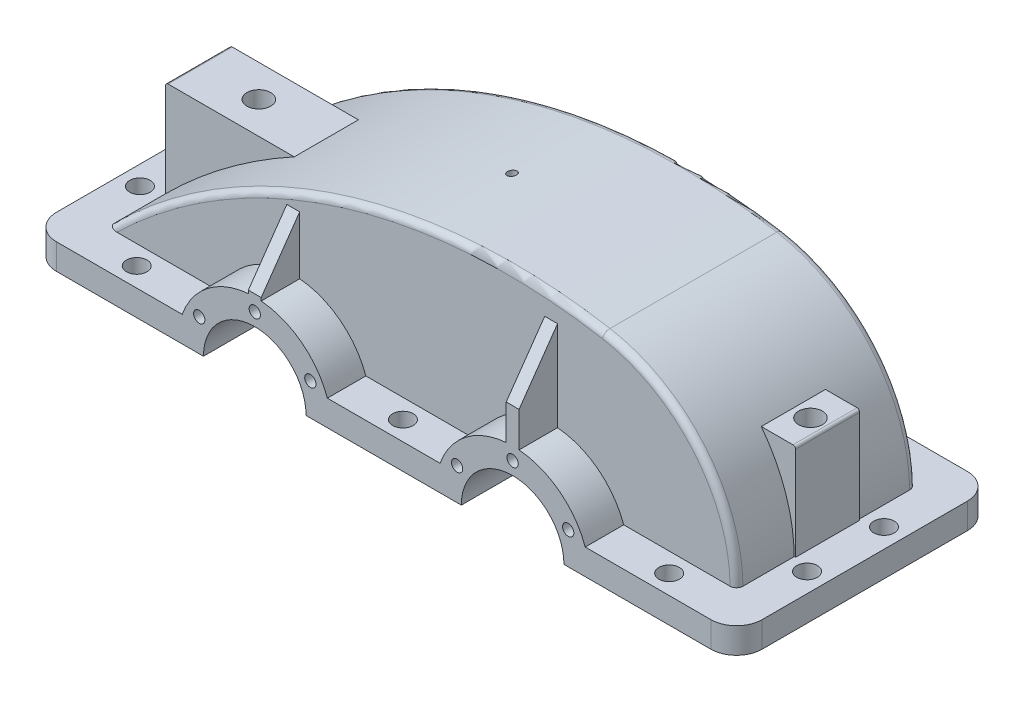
ISO-10303-21;
HEADER;
FILE_DESCRIPTION(('STEP AP214'),'2;1');
FILE_NAME('part.step','',(''),(''),'','','');
FILE_SCHEMA(('AUTOMOTIVE_DESIGN { 1 0 10303 214 1 1 1 1 }'));
ENDSEC;
DATA;
#1=APPLICATION_CONTEXT('core data for automotive mechanical design processes');
#2=APPLICATION_PROTOCOL_DEFINITION('international standard','automotive_design',2000,#1);
#3=PRODUCT_CONTEXT('',#1,'mechanical');
#4=PRODUCT('Part','Part','',(#3));
#5=PRODUCT_RELATED_PRODUCT_CATEGORY('part','',(#4));
#6=PRODUCT_DEFINITION_FORMATION('','',#4);
#7=PRODUCT_DEFINITION_CONTEXT('part definition',#1,'design');
#8=PRODUCT_DEFINITION('design','',#6,#7);
#9=PRODUCT_DEFINITION_SHAPE('','',#8);
#10=(LENGTH_UNIT() NAMED_UNIT(*) SI_UNIT(.MILLI.,.METRE.));
#11=(NAMED_UNIT(*) PLANE_ANGLE_UNIT() SI_UNIT($,.RADIAN.));
#12=(NAMED_UNIT(*) SI_UNIT($,.STERADIAN.) SOLID_ANGLE_UNIT());
#13=UNCERTAINTY_MEASURE_WITH_UNIT(LENGTH_MEASURE(1.E-05),#10,'distance_accuracy_value','');
#14=(GEOMETRIC_REPRESENTATION_CONTEXT(3) GLOBAL_UNCERTAINTY_ASSIGNED_CONTEXT((#13)) GLOBAL_UNIT_ASSIGNED_CONTEXT((#10,
#11,#12)) REPRESENTATION_CONTEXT('',''));
#15=CARTESIAN_POINT('',(0.,0.,0.));
#16=DIRECTION('',(0.,0.,1.));
#17=DIRECTION('',(1.,0.,0.));
#18=AXIS2_PLACEMENT_3D('',#15,#16,#17);
#19=CARTESIAN_POINT('',(-30.,-20.,-30.));
#20=DIRECTION('',(0.,0.,1.));
#21=DIRECTION('',(1.,0.,0.));
#22=AXIS2_PLACEMENT_3D('',#19,#20,#21);
#23=PLANE('',#22);
#24=DIRECTION('',(1.,0.,0.));
#25=VECTOR('',#24,1.);
#26=CARTESIAN_POINT('',(-30.,0.,-30.));
#27=LINE('',#26,#25);
#28=CARTESIAN_POINT('',(402.068542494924,0.,-30.));
#29=VERTEX_POINT('',#28);
#30=CARTESIAN_POINT('',(500.,0.,-30.));
#31=VERTEX_POINT('',#30);
#32=EDGE_CURVE('E620',#29,#31,#27,.T.);
#33=ORIENTED_EDGE('',*,*,#32,.T.);
#34=DIRECTION('',(0.,1.,0.));
#35=VECTOR('',#34,1.);
#36=CARTESIAN_POINT('',(500.,-20.,-30.));
#37=LINE('',#36,#35);
#38=CARTESIAN_POINT('',(500.,-20.,-30.));
#39=VERTEX_POINT('',#38);
#40=EDGE_CURVE('E632',#31,#39,#37,.F.);
#41=ORIENTED_EDGE('',*,*,#40,.T.);
#42=DIRECTION('',(1.,0.,0.));
#43=VECTOR('',#42,1.);
#44=CARTESIAN_POINT('',(-30.,-20.,-30.));
#45=LINE('',#44,#43);
#46=CARTESIAN_POINT('',(385.5,-20.,-30.));
#47=VERTEX_POINT('',#46);
#48=EDGE_CURVE('E1034',#47,#39,#45,.T.);
#49=ORIENTED_EDGE('',*,*,#48,.F.);
#50=CARTESIAN_POINT('',(345.5,-20.,-30.));
#51=DIRECTION('',(0.,0.,-1.));
#52=DIRECTION('',(1.,0.,0.));
#53=AXIS2_PLACEMENT_3D('',#50,#51,#52);
#54=CIRCLE('',#53,40.);
#55=CARTESIAN_POINT('',(305.5,-20.,-30.));
#56=VERTEX_POINT('',#55);
#57=EDGE_CURVE('E975',#56,#47,#54,.T.);
#58=ORIENTED_EDGE('',*,*,#57,.F.);
#59=CARTESIAN_POINT('',(184.5,-20.,-30.));
#60=VERTEX_POINT('',#59);
#61=EDGE_CURVE('E1039',#60,#56,#45,.T.);
#62=ORIENTED_EDGE('',*,*,#61,.F.);
#63=CARTESIAN_POINT('',(144.5,-20.,-30.));
#64=DIRECTION('',(0.,0.,-1.));
#65=DIRECTION('',(1.,0.,0.));
#66=AXIS2_PLACEMENT_3D('',#63,#64,#65);
#67=CIRCLE('',#66,40.);
#68=CARTESIAN_POINT('',(104.5,-20.,-30.));
#69=VERTEX_POINT('',#68);
#70=EDGE_CURVE('E950',#69,#60,#67,.T.);
#71=ORIENTED_EDGE('',*,*,#70,.F.);
#72=CARTESIAN_POINT('',(-10.,-20.,-30.));
#73=VERTEX_POINT('',#72);
#74=EDGE_CURVE('E1036',#73,#69,#45,.T.);
#75=ORIENTED_EDGE('',*,*,#74,.F.);
#76=DIRECTION('',(0.,1.,0.));
#77=VECTOR('',#76,1.);
#78=CARTESIAN_POINT('',(-10.,-20.,-30.));
#79=LINE('',#78,#77);
#80=CARTESIAN_POINT('',(-10.,0.,-30.));
#81=VERTEX_POINT('',#80);
#82=EDGE_CURVE('E634',#73,#81,#79,.T.);
#83=ORIENTED_EDGE('',*,*,#82,.T.);
#84=CARTESIAN_POINT('',(87.9314575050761,0.,-30.));
#85=VERTEX_POINT('',#84);
#86=EDGE_CURVE('E1047',#81,#85,#27,.T.);
#87=ORIENTED_EDGE('',*,*,#86,.T.);
#88=CARTESIAN_POINT('',(144.5,-20.,-30.));
#89=DIRECTION('',(0.,0.,1.));
#90=DIRECTION('',(1.,0.,0.));
#91=AXIS2_PLACEMENT_3D('',#88,#89,#90);
#92=CIRCLE('',#91,60.);
#93=CARTESIAN_POINT('',(139.5,39.791303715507,-29.9999999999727));
#94=VERTEX_POINT('',#93);
#95=EDGE_CURVE('E959',#94,#85,#92,.T.);
#96=ORIENTED_EDGE('',*,*,#95,.F.);
#97=DIRECTION('',(0.,1.,0.));
#98=VECTOR('',#97,1.);
#99=CARTESIAN_POINT('',(139.5,-20.001,-30.));
#100=LINE('',#99,#98);
#101=CARTESIAN_POINT('',(139.5,42.1555597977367,-30.));
#102=VERTEX_POINT('',#101);
#103=EDGE_CURVE('E918',#94,#102,#100,.T.);
#104=ORIENTED_EDGE('',*,*,#103,.T.);
#105=DIRECTION('',(1.,0.,0.));
#106=VECTOR('',#105,1.);
#107=CARTESIAN_POINT('',(149.5,42.1555597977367,-30.));
#108=LINE('',#107,#106);
#109=CARTESIAN_POINT('',(149.5,42.1555597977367,-30.));
#110=VERTEX_POINT('',#109);
#111=EDGE_CURVE('E1115',#102,#110,#108,.T.);
#112=ORIENTED_EDGE('',*,*,#111,.T.);
#113=DIRECTION('',(0.,1.,0.));
#114=VECTOR('',#113,1.);
#115=CARTESIAN_POINT('',(149.5,-20.001,-30.));
#116=LINE('',#115,#114);
#117=CARTESIAN_POINT('',(149.5,39.791303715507,-30.));
#118=VERTEX_POINT('',#117);
#119=EDGE_CURVE('E897',#118,#110,#116,.T.);
#120=ORIENTED_EDGE('',*,*,#119,.F.);
#121=CARTESIAN_POINT('',(201.068542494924,0.,-30.));
#122=VERTEX_POINT('',#121);
#123=EDGE_CURVE('E960',#122,#118,#92,.T.);
#124=ORIENTED_EDGE('',*,*,#123,.F.);
#125=CARTESIAN_POINT('',(288.931457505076,0.,-30.));
#126=VERTEX_POINT('',#125);
#127=EDGE_CURVE('E1050',#122,#126,#27,.T.);
#128=ORIENTED_EDGE('',*,*,#127,.T.);
#129=CARTESIAN_POINT('',(345.5,-20.,-30.));
#130=DIRECTION('',(0.,0.,1.));
#131=DIRECTION('',(1.,0.,0.));
#132=AXIS2_PLACEMENT_3D('',#129,#130,#131);
#133=CIRCLE('',#132,60.);
#134=CARTESIAN_POINT('',(340.5,39.791303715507,-29.9999999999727));
#135=VERTEX_POINT('',#134);
#136=EDGE_CURVE('E966',#135,#126,#133,.T.);
#137=ORIENTED_EDGE('',*,*,#136,.F.);
#138=DIRECTION('',(0.,1.,0.));
#139=VECTOR('',#138,1.);
#140=CARTESIAN_POINT('',(340.5,-20.001,-30.));
#141=LINE('',#140,#139);
#142=CARTESIAN_POINT('',(340.5,67.1555597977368,-30.));
#143=VERTEX_POINT('',#142);
#144=EDGE_CURVE('E879',#135,#143,#141,.T.);
#145=ORIENTED_EDGE('',*,*,#144,.T.);
#146=DIRECTION('',(1.,0.,0.));
#147=VECTOR('',#146,1.);
#148=CARTESIAN_POINT('',(350.5,67.1555597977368,-30.));
#149=LINE('',#148,#147);
#150=CARTESIAN_POINT('',(350.5,67.1555597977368,-30.));
#151=VERTEX_POINT('',#150);
#152=EDGE_CURVE('E1112',#143,#151,#149,.T.);
#153=ORIENTED_EDGE('',*,*,#152,.T.);
#154=DIRECTION('',(0.,1.,0.));
#155=VECTOR('',#154,1.);
#156=CARTESIAN_POINT('',(350.5,-20.001,-30.));
#157=LINE('',#156,#155);
#158=CARTESIAN_POINT('',(350.5,39.791303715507,-30.));
#159=VERTEX_POINT('',#158);
#160=EDGE_CURVE('E859',#159,#151,#157,.T.);
#161=ORIENTED_EDGE('',*,*,#160,.F.);
#162=EDGE_CURVE('E973',#29,#159,#133,.T.);
#163=ORIENTED_EDGE('',*,*,#162,.F.);
#164=EDGE_LOOP('',(#33,#41,#49,#58,#62,#71,#75,#83,#87,#96,#104,#112,#120,#124,#128,#137,#145,
#153,#161,#163));
#165=FACE_BOUND('',#164,.T.);
#166=CARTESIAN_POINT('',(144.5,30.,-30.));
#167=DIRECTION('',(0.,0.,-1.));
#168=DIRECTION('',(-1.,0.,0.));
#169=AXIS2_PLACEMENT_3D('',#166,#167,#168);
#170=CIRCLE('',#169,4.39999999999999);
#171=CARTESIAN_POINT('',(140.1,30.,-30.));
#172=VERTEX_POINT('',#171);
#173=EDGE_CURVE('E748',#172,#172,#170,.T.);
#174=ORIENTED_EDGE('',*,*,#173,.F.);
#175=EDGE_LOOP('',(#174));
#176=FACE_BOUND('',#175,.T.);
#177=CARTESIAN_POINT('',(101.198729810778,4.99999999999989,-30.));
#178=DIRECTION('',(0.,0.,-1.));
#179=DIRECTION('',(-1.,0.,0.));
#180=AXIS2_PLACEMENT_3D('',#177,#178,#179);
#181=CIRCLE('',#180,4.39999999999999);
#182=CARTESIAN_POINT('',(96.7987298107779,4.99999999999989,-30.));
#183=VERTEX_POINT('',#182);
#184=EDGE_CURVE('E742',#183,#183,#181,.T.);
#185=ORIENTED_EDGE('',*,*,#184,.F.);
#186=EDGE_LOOP('',(#185));
#187=FACE_BOUND('',#186,.T.);
#188=CARTESIAN_POINT('',(187.801270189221,5.0000000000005,-30.));
#189=DIRECTION('',(0.,0.,-1.));
#190=DIRECTION('',(-1.,0.,0.));
#191=AXIS2_PLACEMENT_3D('',#188,#189,#190);
#192=CIRCLE('',#191,4.39999999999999);
#193=CARTESIAN_POINT('',(183.401270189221,5.0000000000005,-30.));
#194=VERTEX_POINT('',#193);
#195=EDGE_CURVE('E736',#194,#194,#192,.T.);
#196=ORIENTED_EDGE('',*,*,#195,.F.);
#197=EDGE_LOOP('',(#196));
#198=FACE_BOUND('',#197,.T.);
#199=CARTESIAN_POINT('',(345.5,30.,-30.0000000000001));
#200=DIRECTION('',(0.,0.,-1.));
#201=DIRECTION('',(-1.,0.,0.));
#202=AXIS2_PLACEMENT_3D('',#199,#200,#201);
#203=CIRCLE('',#202,4.39999999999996);
#204=CARTESIAN_POINT('',(341.1,30.,-30.0000000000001));
#205=VERTEX_POINT('',#204);
#206=EDGE_CURVE('E730',#205,#205,#203,.T.);
#207=ORIENTED_EDGE('',*,*,#206,.F.);
#208=EDGE_LOOP('',(#207));
#209=FACE_BOUND('',#208,.T.);
#210=CARTESIAN_POINT('',(388.801270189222,4.99999999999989,-30.0000000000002));
#211=DIRECTION('',(0.,0.,-1.));
#212=DIRECTION('',(-1.,0.,0.));
#213=AXIS2_PLACEMENT_3D('',#210,#211,#212);
#214=CIRCLE('',#213,4.39999999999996);
#215=CARTESIAN_POINT('',(384.401270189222,4.99999999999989,-30.0000000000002));
#216=VERTEX_POINT('',#215);
#217=EDGE_CURVE('E724',#216,#216,#214,.T.);
#218=ORIENTED_EDGE('',*,*,#217,.F.);
#219=EDGE_LOOP('',(#218));
#220=FACE_BOUND('',#219,.T.);
#221=CARTESIAN_POINT('',(302.198729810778,5.0000000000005,-30.0000000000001));
#222=DIRECTION('',(0.,0.,-1.));
#223=DIRECTION('',(-1.,0.,0.));
#224=AXIS2_PLACEMENT_3D('',#221,#222,#223);
#225=CIRCLE('',#224,4.40000000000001);
#226=CARTESIAN_POINT('',(297.798729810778,5.0000000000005,-30.0000000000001));
#227=VERTEX_POINT('',#226);
#228=EDGE_CURVE('E718',#227,#227,#225,.T.);
#229=ORIENTED_EDGE('',*,*,#228,.F.);
#230=EDGE_LOOP('',(#229));
#231=FACE_BOUND('',#230,.T.);
#232=ADVANCED_FACE('F46',(#165,#176,#187,#198,#209,#220,#231),#23,.F.);
#233=CARTESIAN_POINT('',(-30.0000000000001,-20.,170.));
#234=DIRECTION('',(0.,0.,-1.));
#235=DIRECTION('',(-1.,0.,0.));
#236=AXIS2_PLACEMENT_3D('',#233,#234,#235);
#237=PLANE('',#236);
#238=DIRECTION('',(-1.,0.,0.));
#239=VECTOR('',#238,1.);
#240=CARTESIAN_POINT('',(-30.0000000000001,-20.,170.));
#241=LINE('',#240,#239);
#242=CARTESIAN_POINT('',(500.,-20.,170.));
#243=VERTEX_POINT('',#242);
#244=CARTESIAN_POINT('',(385.5,-20.,170.));
#245=VERTEX_POINT('',#244);
#246=EDGE_CURVE('E1043',#243,#245,#241,.T.);
#247=ORIENTED_EDGE('',*,*,#246,.F.);
#248=DIRECTION('',(0.,1.,0.));
#249=VECTOR('',#248,1.);
#250=CARTESIAN_POINT('',(500.,-20.,170.));
#251=LINE('',#250,#249);
#252=CARTESIAN_POINT('',(500.,0.,170.));
#253=VERTEX_POINT('',#252);
#254=EDGE_CURVE('E649',#243,#253,#251,.T.);
#255=ORIENTED_EDGE('',*,*,#254,.T.);
#256=DIRECTION('',(-1.,0.,0.));
#257=VECTOR('',#256,1.);
#258=CARTESIAN_POINT('',(-30.0000000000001,0.,170.));
#259=LINE('',#258,#257);
#260=CARTESIAN_POINT('',(402.068542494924,0.,170.));
#261=VERTEX_POINT('',#260);
#262=EDGE_CURVE('E1035',#253,#261,#259,.T.);
#263=ORIENTED_EDGE('',*,*,#262,.T.);
#264=CARTESIAN_POINT('',(345.5,-20.,170.));
#265=DIRECTION('',(0.,0.,1.));
#266=DIRECTION('',(1.,0.,0.));
#267=AXIS2_PLACEMENT_3D('',#264,#265,#266);
#268=CIRCLE('',#267,60.);
#269=CARTESIAN_POINT('',(350.5,39.791303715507,170.000000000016));
#270=VERTEX_POINT('',#269);
#271=EDGE_CURVE('E1007',#261,#270,#268,.T.);
#272=ORIENTED_EDGE('',*,*,#271,.T.);
#273=DIRECTION('',(0.,1.,0.));
#274=VECTOR('',#273,1.);
#275=CARTESIAN_POINT('',(350.5,-20.001,170.));
#276=LINE('',#275,#274);
#277=CARTESIAN_POINT('',(350.5,67.1555597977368,170.));
#278=VERTEX_POINT('',#277);
#279=EDGE_CURVE('E863',#270,#278,#276,.T.);
#280=ORIENTED_EDGE('',*,*,#279,.T.);
#281=DIRECTION('',(-1.,0.,0.));
#282=VECTOR('',#281,1.);
#283=CARTESIAN_POINT('',(-30.0000000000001,67.1555597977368,170.));
#284=LINE('',#283,#282);
#285=CARTESIAN_POINT('',(340.5,67.1555597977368,170.));
#286=VERTEX_POINT('',#285);
#287=EDGE_CURVE('E1098',#278,#286,#284,.T.);
#288=ORIENTED_EDGE('',*,*,#287,.T.);
#289=DIRECTION('',(0.,1.,0.));
#290=VECTOR('',#289,1.);
#291=CARTESIAN_POINT('',(340.5,-20.001,170.));
#292=LINE('',#291,#290);
#293=CARTESIAN_POINT('',(340.5,39.791303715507,170.));
#294=VERTEX_POINT('',#293);
#295=EDGE_CURVE('E850',#294,#286,#292,.T.);
#296=ORIENTED_EDGE('',*,*,#295,.F.);
#297=CARTESIAN_POINT('',(288.931457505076,0.,170.));
#298=VERTEX_POINT('',#297);
#299=EDGE_CURVE('E1001',#294,#298,#268,.T.);
#300=ORIENTED_EDGE('',*,*,#299,.T.);
#301=CARTESIAN_POINT('',(201.068542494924,0.,170.));
#302=VERTEX_POINT('',#301);
#303=EDGE_CURVE('E1055',#298,#302,#259,.T.);
#304=ORIENTED_EDGE('',*,*,#303,.T.);
#305=CARTESIAN_POINT('',(144.5,-20.,170.));
#306=DIRECTION('',(0.,0.,1.));
#307=DIRECTION('',(1.,0.,0.));
#308=AXIS2_PLACEMENT_3D('',#305,#306,#307);
#309=CIRCLE('',#308,60.);
#310=CARTESIAN_POINT('',(149.5,39.791303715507,170.000000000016));
#311=VERTEX_POINT('',#310);
#312=EDGE_CURVE('E987',#302,#311,#309,.T.);
#313=ORIENTED_EDGE('',*,*,#312,.T.);
#314=DIRECTION('',(0.,1.,0.));
#315=VECTOR('',#314,1.);
#316=CARTESIAN_POINT('',(149.5,-20.001,170.));
#317=LINE('',#316,#315);
#318=CARTESIAN_POINT('',(149.5,42.1555597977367,170.));
#319=VERTEX_POINT('',#318);
#320=EDGE_CURVE('E903',#311,#319,#317,.T.);
#321=ORIENTED_EDGE('',*,*,#320,.T.);
#322=DIRECTION('',(-1.,0.,0.));
#323=VECTOR('',#322,1.);
#324=CARTESIAN_POINT('',(139.5,42.1555597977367,170.));
#325=LINE('',#324,#323);
#326=CARTESIAN_POINT('',(139.5,42.1555597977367,170.));
#327=VERTEX_POINT('',#326);
#328=EDGE_CURVE('E1101',#319,#327,#325,.T.);
#329=ORIENTED_EDGE('',*,*,#328,.T.);
#330=DIRECTION('',(0.,1.,0.));
#331=VECTOR('',#330,1.);
#332=CARTESIAN_POINT('',(139.5,-20.001,170.));
#333=LINE('',#332,#331);
#334=CARTESIAN_POINT('',(139.5,39.791303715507,170.));
#335=VERTEX_POINT('',#334);
#336=EDGE_CURVE('E901',#335,#327,#333,.T.);
#337=ORIENTED_EDGE('',*,*,#336,.F.);
#338=CARTESIAN_POINT('',(87.9314575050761,0.,170.));
#339=VERTEX_POINT('',#338);
#340=EDGE_CURVE('E991',#335,#339,#309,.T.);
#341=ORIENTED_EDGE('',*,*,#340,.T.);
#342=CARTESIAN_POINT('',(-10.0000000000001,0.,170.));
#343=VERTEX_POINT('',#342);
#344=EDGE_CURVE('E1053',#339,#343,#259,.T.);
#345=ORIENTED_EDGE('',*,*,#344,.T.);
#346=DIRECTION('',(0.,1.,0.));
#347=VECTOR('',#346,1.);
#348=CARTESIAN_POINT('',(-10.0000000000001,-20.,170.));
#349=LINE('',#348,#347);
#350=CARTESIAN_POINT('',(-10.0000000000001,-20.,170.));
#351=VERTEX_POINT('',#350);
#352=EDGE_CURVE('E652',#343,#351,#349,.F.);
#353=ORIENTED_EDGE('',*,*,#352,.T.);
#354=CARTESIAN_POINT('',(104.5,-20.,170.));
#355=VERTEX_POINT('',#354);
#356=EDGE_CURVE('E1042',#355,#351,#241,.T.);
#357=ORIENTED_EDGE('',*,*,#356,.F.);
#358=CARTESIAN_POINT('',(144.5,-20.,170.));
#359=DIRECTION('',(0.,0.,-1.));
#360=DIRECTION('',(1.,0.,0.));
#361=AXIS2_PLACEMENT_3D('',#358,#359,#360);
#362=CIRCLE('',#361,40.);
#363=CARTESIAN_POINT('',(184.5,-20.,170.));
#364=VERTEX_POINT('',#363);
#365=EDGE_CURVE('E985',#355,#364,#362,.T.);
#366=ORIENTED_EDGE('',*,*,#365,.T.);
#367=CARTESIAN_POINT('',(305.5,-20.,170.));
#368=VERTEX_POINT('',#367);
#369=EDGE_CURVE('E1045',#368,#364,#241,.T.);
#370=ORIENTED_EDGE('',*,*,#369,.F.);
#371=CARTESIAN_POINT('',(345.5,-20.,170.));
#372=DIRECTION('',(0.,0.,-1.));
#373=DIRECTION('',(1.,0.,0.));
#374=AXIS2_PLACEMENT_3D('',#371,#372,#373);
#375=CIRCLE('',#374,40.);
#376=EDGE_CURVE('E1003',#368,#245,#375,.T.);
#377=ORIENTED_EDGE('',*,*,#376,.T.);
#378=EDGE_LOOP('',(#247,#255,#263,#272,#280,#288,#296,#300,#304,#313,#321,#329,#337,#341,#345,
#353,#357,#366,#370,#377));
#379=FACE_BOUND('',#378,.T.);
#380=CARTESIAN_POINT('',(144.5,30.,170.));
#381=DIRECTION('',(0.,0.,1.));
#382=DIRECTION('',(1.,0.,0.));
#383=AXIS2_PLACEMENT_3D('',#380,#381,#382);
#384=CIRCLE('',#383,4.39999999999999);
#385=CARTESIAN_POINT('',(148.9,30.,170.));
#386=VERTEX_POINT('',#385);
#387=EDGE_CURVE('E784',#386,#386,#384,.T.);
#388=ORIENTED_EDGE('',*,*,#387,.F.);
#389=EDGE_LOOP('',(#388));
#390=FACE_BOUND('',#389,.T.);
#391=CARTESIAN_POINT('',(101.198729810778,4.99999999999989,170.));
#392=DIRECTION('',(0.,0.,1.));
#393=DIRECTION('',(1.,0.,0.));
#394=AXIS2_PLACEMENT_3D('',#391,#392,#393);
#395=CIRCLE('',#394,4.39999999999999);
#396=CARTESIAN_POINT('',(105.598729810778,4.99999999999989,170.));
#397=VERTEX_POINT('',#396);
#398=EDGE_CURVE('E778',#397,#397,#395,.T.);
#399=ORIENTED_EDGE('',*,*,#398,.F.);
#400=EDGE_LOOP('',(#399));
#401=FACE_BOUND('',#400,.T.);
#402=CARTESIAN_POINT('',(187.801270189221,5.0000000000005,170.));
#403=DIRECTION('',(0.,0.,1.));
#404=DIRECTION('',(1.,0.,0.));
#405=AXIS2_PLACEMENT_3D('',#402,#403,#404);
#406=CIRCLE('',#405,4.39999999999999);
#407=CARTESIAN_POINT('',(192.201270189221,5.0000000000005,170.));
#408=VERTEX_POINT('',#407);
#409=EDGE_CURVE('E772',#408,#408,#406,.T.);
#410=ORIENTED_EDGE('',*,*,#409,.F.);
#411=EDGE_LOOP('',(#410));
#412=FACE_BOUND('',#411,.T.);
#413=CARTESIAN_POINT('',(345.5,30.,170.));
#414=DIRECTION('',(0.,0.,1.));
#415=DIRECTION('',(1.,0.,0.));
#416=AXIS2_PLACEMENT_3D('',#413,#414,#415);
#417=CIRCLE('',#416,4.39999999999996);
#418=CARTESIAN_POINT('',(349.9,30.,170.));
#419=VERTEX_POINT('',#418);
#420=EDGE_CURVE('E766',#419,#419,#417,.T.);
#421=ORIENTED_EDGE('',*,*,#420,.F.);
#422=EDGE_LOOP('',(#421));
#423=FACE_BOUND('',#422,.T.);
#424=CARTESIAN_POINT('',(388.801270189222,4.99999999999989,170.));
#425=DIRECTION('',(0.,0.,1.));
#426=DIRECTION('',(1.,0.,0.));
#427=AXIS2_PLACEMENT_3D('',#424,#425,#426);
#428=CIRCLE('',#427,4.39999999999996);
#429=CARTESIAN_POINT('',(393.201270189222,4.99999999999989,170.));
#430=VERTEX_POINT('',#429);
#431=EDGE_CURVE('E760',#430,#430,#428,.T.);
#432=ORIENTED_EDGE('',*,*,#431,.F.);
#433=EDGE_LOOP('',(#432));
#434=FACE_BOUND('',#433,.T.);
#435=CARTESIAN_POINT('',(302.198729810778,5.0000000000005,170.));
#436=DIRECTION('',(0.,0.,1.));
#437=DIRECTION('',(1.,0.,0.));
#438=AXIS2_PLACEMENT_3D('',#435,#436,#437);
#439=CIRCLE('',#438,4.40000000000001);
#440=CARTESIAN_POINT('',(306.598729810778,5.0000000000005,170.));
#441=VERTEX_POINT('',#440);
#442=EDGE_CURVE('E754',#441,#441,#439,.T.);
#443=ORIENTED_EDGE('',*,*,#442,.F.);
#444=EDGE_LOOP('',(#443));
#445=FACE_BOUND('',#444,.T.);
#446=ADVANCED_FACE('F549',(#379,#390,#401,#412,#423,#434,#445),#237,.F.);
#447=CARTESIAN_POINT('',(311.003339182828,-311.250579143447,140.));
#448=DIRECTION('',(0.,0.,-1.));
#449=DIRECTION('',(-1.,0.,0.));
#450=AXIS2_PLACEMENT_3D('',#447,#448,#449);
#451=PLANE('',#450);
#452=DIRECTION('',(1.,0.,0.));
#453=VECTOR('',#452,1.);
#454=CARTESIAN_POINT('',(0.,0.,140.));
#455=LINE('',#454,#453);
#456=CARTESIAN_POINT('',(402.068542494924,0.,139.999999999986));
#457=VERTEX_POINT('',#456);
#458=CARTESIAN_POINT('',(484.99986086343,0.,140.));
#459=VERTEX_POINT('',#458);
#460=EDGE_CURVE('E1078',#457,#459,#455,.T.);
#461=ORIENTED_EDGE('',*,*,#460,.T.);
#462=CARTESIAN_POINT('',(365.003339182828,-0.913665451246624,140.));
#463=DIRECTION('',(0.,0.,-1.));
#464=DIRECTION('',(-1.,0.,0.));
#465=AXIS2_PLACEMENT_3D('',#462,#463,#464);
#466=CIRCLE('',#465,120.);
#467=CARTESIAN_POINT('',(385.574767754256,117.30992071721,140.));
#468=VERTEX_POINT('',#467);
#469=EDGE_CURVE('E1137',#459,#468,#466,.F.);
#470=ORIENTED_EDGE('',*,*,#469,.T.);
#471=CARTESIAN_POINT('',(311.003339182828,-311.250579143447,140.));
#472=DIRECTION('',(0.,0.,-1.));
#473=DIRECTION('',(-1.,0.,0.));
#474=AXIS2_PLACEMENT_3D('',#471,#472,#473);
#475=CIRCLE('',#474,435.);
#476=CARTESIAN_POINT('',(7.11507520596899,0.,140.));
#477=VERTEX_POINT('',#476);
#478=EDGE_CURVE('E1135',#468,#477,#475,.F.);
#479=ORIENTED_EDGE('',*,*,#478,.T.);
#480=CARTESIAN_POINT('',(87.9314575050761,0.,139.999999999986));
#481=VERTEX_POINT('',#480);
#482=EDGE_CURVE('E1074',#477,#481,#455,.T.);
#483=ORIENTED_EDGE('',*,*,#482,.T.);
#484=CARTESIAN_POINT('',(144.5,-20.,139.999999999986));
#485=DIRECTION('',(0.,0.,-1.));
#486=DIRECTION('',(-1.,0.,0.));
#487=AXIS2_PLACEMENT_3D('',#484,#485,#486);
#488=CIRCLE('',#487,60.);
#489=CARTESIAN_POINT('',(139.5,39.791303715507,139.999999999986));
#490=VERTEX_POINT('',#489);
#491=EDGE_CURVE('E982',#490,#481,#488,.F.);
#492=ORIENTED_EDGE('',*,*,#491,.F.);
#493=DIRECTION('',(0.,1.,0.));
#494=VECTOR('',#493,1.);
#495=CARTESIAN_POINT('',(139.5,-20.001,139.999999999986));
#496=LINE('',#495,#494);
#497=CARTESIAN_POINT('',(139.5,85.,139.999999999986));
#498=VERTEX_POINT('',#497);
#499=EDGE_CURVE('E889',#490,#498,#496,.T.);
#500=ORIENTED_EDGE('',*,*,#499,.T.);
#501=DIRECTION('',(1.,0.,0.));
#502=VECTOR('',#501,1.);
#503=CARTESIAN_POINT('',(149.5,85.,139.999999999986));
#504=LINE('',#503,#502);
#505=CARTESIAN_POINT('',(149.5,85.,139.999999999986));
#506=VERTEX_POINT('',#505);
#507=EDGE_CURVE('E890',#498,#506,#504,.T.);
#508=ORIENTED_EDGE('',*,*,#507,.T.);
#509=DIRECTION('',(0.,1.,0.));
#510=VECTOR('',#509,1.);
#511=CARTESIAN_POINT('',(149.5,-20.001,139.999999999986));
#512=LINE('',#511,#510);
#513=CARTESIAN_POINT('',(149.5,39.791303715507,139.999999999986));
#514=VERTEX_POINT('',#513);
#515=EDGE_CURVE('E893',#514,#506,#512,.T.);
#516=ORIENTED_EDGE('',*,*,#515,.F.);
#517=CARTESIAN_POINT('',(201.068542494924,0.,139.999999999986));
#518=VERTEX_POINT('',#517);
#519=EDGE_CURVE('E978',#518,#514,#488,.F.);
#520=ORIENTED_EDGE('',*,*,#519,.F.);
#521=CARTESIAN_POINT('',(288.931457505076,0.,139.999999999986));
#522=VERTEX_POINT('',#521);
#523=EDGE_CURVE('E1077',#518,#522,#455,.T.);
#524=ORIENTED_EDGE('',*,*,#523,.T.);
#525=CARTESIAN_POINT('',(345.5,-20.,139.999999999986));
#526=DIRECTION('',(0.,0.,-1.));
#527=DIRECTION('',(-1.,0.,0.));
#528=AXIS2_PLACEMENT_3D('',#525,#526,#527);
#529=CIRCLE('',#528,60.);
#530=CARTESIAN_POINT('',(340.5,39.791303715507,139.999999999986));
#531=VERTEX_POINT('',#530);
#532=EDGE_CURVE('E998',#531,#522,#529,.F.);
#533=ORIENTED_EDGE('',*,*,#532,.F.);
#534=DIRECTION('',(0.,1.,0.));
#535=VECTOR('',#534,1.);
#536=CARTESIAN_POINT('',(340.5,-20.001,139.999999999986));
#537=LINE('',#536,#535);
#538=CARTESIAN_POINT('',(340.5,110.,139.999999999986));
#539=VERTEX_POINT('',#538);
#540=EDGE_CURVE('E855',#531,#539,#537,.T.);
#541=ORIENTED_EDGE('',*,*,#540,.T.);
#542=DIRECTION('',(1.,0.,0.));
#543=VECTOR('',#542,1.);
#544=CARTESIAN_POINT('',(350.5,110.,139.999999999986));
#545=LINE('',#544,#543);
#546=CARTESIAN_POINT('',(350.5,110.,139.999999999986));
#547=VERTEX_POINT('',#546);
#548=EDGE_CURVE('E851',#539,#547,#545,.T.);
#549=ORIENTED_EDGE('',*,*,#548,.T.);
#550=DIRECTION('',(0.,1.,0.));
#551=VECTOR('',#550,1.);
#552=CARTESIAN_POINT('',(350.5,-20.001,139.999999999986));
#553=LINE('',#552,#551);
#554=CARTESIAN_POINT('',(350.5,39.791303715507,139.999999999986));
#555=VERTEX_POINT('',#554);
#556=EDGE_CURVE('E854',#555,#547,#553,.T.);
#557=ORIENTED_EDGE('',*,*,#556,.F.);
#558=EDGE_CURVE('E994',#457,#555,#529,.F.);
#559=ORIENTED_EDGE('',*,*,#558,.F.);
#560=EDGE_LOOP('',(#461,#470,#479,#483,#492,#500,#508,#516,#520,#524,#533,#541,#549,#557,#559));
#561=FACE_BOUND('',#560,.T.);
#562=ADVANCED_FACE('F599',(#561),#451,.F.);
#563=CARTESIAN_POINT('',(345.5,-20.,-500000.));
#564=DIRECTION('',(0.,0.,1.));
#565=DIRECTION('',(1.,0.,0.));
#566=AXIS2_PLACEMENT_3D('',#563,#564,#565);
#567=CYLINDRICAL_SURFACE('',#566,60.);
#568=ORIENTED_EDGE('',*,*,#299,.F.);
#569=DIRECTION('',(0.,0.,-1.));
#570=VECTOR('',#569,1.);
#571=CARTESIAN_POINT('',(340.5,39.791303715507,500000.));
#572=LINE('',#571,#570);
#573=EDGE_CURVE('E860',#294,#531,#572,.T.);
#574=ORIENTED_EDGE('',*,*,#573,.T.);
#575=ORIENTED_EDGE('',*,*,#532,.T.);
#576=DIRECTION('',(0.,0.,1.));
#577=VECTOR('',#576,1.);
#578=CARTESIAN_POINT('',(288.931457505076,0.,-500000.));
#579=LINE('',#578,#577);
#580=EDGE_CURVE('E997',#522,#298,#579,.T.);
#581=ORIENTED_EDGE('',*,*,#580,.T.);
#582=EDGE_LOOP('',(#568,#574,#575,#581));
#583=FACE_BOUND('',#582,.T.);
#584=ADVANCED_FACE('F1285',(#583),#567,.T.);
#585=ORIENTED_EDGE('',*,*,#558,.T.);
#586=DIRECTION('',(0.,0.,-1.));
#587=VECTOR('',#586,1.);
#588=CARTESIAN_POINT('',(350.5,39.791303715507,500000.));
#589=LINE('',#588,#587);
#590=EDGE_CURVE('E856',#555,#270,#589,.F.);
#591=ORIENTED_EDGE('',*,*,#590,.T.);
#592=ORIENTED_EDGE('',*,*,#271,.F.);
#593=DIRECTION('',(0.,0.,1.));
#594=VECTOR('',#593,1.);
#595=CARTESIAN_POINT('',(402.068542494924,0.,-500000.));
#596=LINE('',#595,#594);
#597=EDGE_CURVE('E990',#261,#457,#596,.F.);
#598=ORIENTED_EDGE('',*,*,#597,.T.);
#599=EDGE_LOOP('',(#585,#591,#592,#598));
#600=FACE_BOUND('',#599,.T.);
#601=ADVANCED_FACE('F1288',(#600),#567,.T.);
#602=CARTESIAN_POINT('',(311.003339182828,-311.250579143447,0.));
#603=DIRECTION('',(0.,0.,-1.));
#604=DIRECTION('',(-1.,0.,0.));
#605=AXIS2_PLACEMENT_3D('',#602,#603,#604);
#606=PLANE('',#605);
#607=CARTESIAN_POINT('',(311.003339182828,-311.250579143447,0.));
#608=DIRECTION('',(0.,0.,-1.));
#609=DIRECTION('',(-1.,0.,0.));
#610=AXIS2_PLACEMENT_3D('',#607,#608,#609);
#611=CIRCLE('',#610,435.);
#612=CARTESIAN_POINT('',(7.11507520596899,0.,0.));
#613=VERTEX_POINT('',#612);
#614=CARTESIAN_POINT('',(385.574767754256,117.30992071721,0.));
#615=VERTEX_POINT('',#614);
#616=EDGE_CURVE('E1131',#613,#615,#611,.T.);
#617=ORIENTED_EDGE('',*,*,#616,.T.);
#618=CARTESIAN_POINT('',(365.003339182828,-0.913665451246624,0.));
#619=DIRECTION('',(0.,0.,-1.));
#620=DIRECTION('',(-1.,0.,0.));
#621=AXIS2_PLACEMENT_3D('',#618,#619,#620);
#622=CIRCLE('',#621,120.);
#623=CARTESIAN_POINT('',(484.99986086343,0.,0.));
#624=VERTEX_POINT('',#623);
#625=EDGE_CURVE('E1133',#615,#624,#622,.T.);
#626=ORIENTED_EDGE('',*,*,#625,.T.);
#627=DIRECTION('',(1.,0.,0.));
#628=VECTOR('',#627,1.);
#629=CARTESIAN_POINT('',(0.,0.,0.));
#630=LINE('',#629,#628);
#631=CARTESIAN_POINT('',(402.068542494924,0.,0.));
#632=VERTEX_POINT('',#631);
#633=EDGE_CURVE('E1072',#632,#624,#630,.T.);
#634=ORIENTED_EDGE('',*,*,#633,.F.);
#635=CARTESIAN_POINT('',(345.5,-20.,0.));
#636=DIRECTION('',(0.,0.,-1.));
#637=DIRECTION('',(-1.,0.,0.));
#638=AXIS2_PLACEMENT_3D('',#635,#636,#637);
#639=CIRCLE('',#638,60.);
#640=CARTESIAN_POINT('',(350.5,39.791303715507,0.));
#641=VERTEX_POINT('',#640);
#642=EDGE_CURVE('E967',#641,#632,#639,.T.);
#643=ORIENTED_EDGE('',*,*,#642,.F.);
#644=DIRECTION('',(0.,1.,0.));
#645=VECTOR('',#644,1.);
#646=CARTESIAN_POINT('',(350.5,-20.001,0.));
#647=LINE('',#646,#645);
#648=CARTESIAN_POINT('',(350.5,110.,0.));
#649=VERTEX_POINT('',#648);
#650=EDGE_CURVE('E874',#641,#649,#647,.T.);
#651=ORIENTED_EDGE('',*,*,#650,.T.);
#652=DIRECTION('',(-1.,0.,0.));
#653=VECTOR('',#652,1.);
#654=CARTESIAN_POINT('',(340.5,110.,0.));
#655=LINE('',#654,#653);
#656=CARTESIAN_POINT('',(340.5,110.,0.));
#657=VERTEX_POINT('',#656);
#658=EDGE_CURVE('E871',#649,#657,#655,.T.);
#659=ORIENTED_EDGE('',*,*,#658,.T.);
#660=DIRECTION('',(0.,1.,0.));
#661=VECTOR('',#660,1.);
#662=CARTESIAN_POINT('',(340.5,-20.001,0.));
#663=LINE('',#662,#661);
#664=CARTESIAN_POINT('',(340.5,39.791303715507,0.));
#665=VERTEX_POINT('',#664);
#666=EDGE_CURVE('E873',#665,#657,#663,.T.);
#667=ORIENTED_EDGE('',*,*,#666,.F.);
#668=CARTESIAN_POINT('',(288.931457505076,0.,0.));
#669=VERTEX_POINT('',#668);
#670=EDGE_CURVE('E963',#669,#665,#639,.T.);
#671=ORIENTED_EDGE('',*,*,#670,.F.);
#672=CARTESIAN_POINT('',(201.068542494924,0.,0.));
#673=VERTEX_POINT('',#672);
#674=EDGE_CURVE('E1081',#673,#669,#630,.T.);
#675=ORIENTED_EDGE('',*,*,#674,.F.);
#676=CARTESIAN_POINT('',(144.5,-20.,0.));
#677=DIRECTION('',(0.,0.,-1.));
#678=DIRECTION('',(-1.,0.,0.));
#679=AXIS2_PLACEMENT_3D('',#676,#677,#678);
#680=CIRCLE('',#679,60.);
#681=CARTESIAN_POINT('',(149.5,39.791303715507,0.));
#682=VERTEX_POINT('',#681);
#683=EDGE_CURVE('E951',#682,#673,#680,.T.);
#684=ORIENTED_EDGE('',*,*,#683,.F.);
#685=DIRECTION('',(0.,1.,0.));
#686=VECTOR('',#685,1.);
#687=CARTESIAN_POINT('',(149.5,-20.001,0.));
#688=LINE('',#687,#686);
#689=CARTESIAN_POINT('',(149.5,85.,0.));
#690=VERTEX_POINT('',#689);
#691=EDGE_CURVE('E913',#682,#690,#688,.T.);
#692=ORIENTED_EDGE('',*,*,#691,.T.);
#693=DIRECTION('',(-1.,0.,0.));
#694=VECTOR('',#693,1.);
#695=CARTESIAN_POINT('',(139.5,85.,0.));
#696=LINE('',#695,#694);
#697=CARTESIAN_POINT('',(139.5,85.,0.));
#698=VERTEX_POINT('',#697);
#699=EDGE_CURVE('E910',#690,#698,#696,.T.);
#700=ORIENTED_EDGE('',*,*,#699,.T.);
#701=DIRECTION('',(0.,1.,0.));
#702=VECTOR('',#701,1.);
#703=CARTESIAN_POINT('',(139.5,-20.001,0.));
#704=LINE('',#703,#702);
#705=CARTESIAN_POINT('',(139.5,39.791303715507,0.));
#706=VERTEX_POINT('',#705);
#707=EDGE_CURVE('E912',#706,#698,#704,.T.);
#708=ORIENTED_EDGE('',*,*,#707,.F.);
#709=CARTESIAN_POINT('',(87.9314575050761,0.,0.));
#710=VERTEX_POINT('',#709);
#711=EDGE_CURVE('E947',#710,#706,#680,.T.);
#712=ORIENTED_EDGE('',*,*,#711,.F.);
#713=EDGE_CURVE('E1079',#613,#710,#630,.T.);
#714=ORIENTED_EDGE('',*,*,#713,.F.);
#715=EDGE_LOOP('',(#617,#626,#634,#643,#651,#659,#667,#671,#675,#684,#692,#700,#708,#712,#714));
#716=FACE_BOUND('',#715,.T.);
#717=ADVANCED_FACE('F1157',(#716),#606,.T.);
#718=CARTESIAN_POINT('',(345.5,-20.,500000.));
#719=DIRECTION('',(0.,0.,-1.));
#720=DIRECTION('',(-1.,0.,0.));
#721=AXIS2_PLACEMENT_3D('',#718,#719,#720);
#722=CYLINDRICAL_SURFACE('',#721,60.);
#723=DIRECTION('',(0.,0.,-1.));
#724=VECTOR('',#723,1.);
#725=CARTESIAN_POINT('',(350.5,39.791303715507,500000.));
#726=LINE('',#725,#724);
#727=EDGE_CURVE('E882',#159,#641,#726,.F.);
#728=ORIENTED_EDGE('',*,*,#727,.T.);
#729=ORIENTED_EDGE('',*,*,#642,.T.);
#730=DIRECTION('',(0.,0.,-1.));
#731=VECTOR('',#730,1.);
#732=CARTESIAN_POINT('',(402.068542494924,0.,500000.));
#733=LINE('',#732,#731);
#734=EDGE_CURVE('E962',#29,#632,#733,.F.);
#735=ORIENTED_EDGE('',*,*,#734,.F.);
#736=ORIENTED_EDGE('',*,*,#162,.T.);
#737=EDGE_LOOP('',(#728,#729,#735,#736));
#738=FACE_BOUND('',#737,.T.);
#739=ADVANCED_FACE('F1271',(#738),#722,.T.);
#740=DIRECTION('',(0.,0.,-1.));
#741=VECTOR('',#740,1.);
#742=CARTESIAN_POINT('',(340.5,39.791303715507,500000.));
#743=LINE('',#742,#741);
#744=EDGE_CURVE('E886',#665,#135,#743,.T.);
#745=ORIENTED_EDGE('',*,*,#744,.T.);
#746=ORIENTED_EDGE('',*,*,#136,.T.);
#747=DIRECTION('',(0.,0.,-1.));
#748=VECTOR('',#747,1.);
#749=CARTESIAN_POINT('',(288.931457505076,0.,500000.));
#750=LINE('',#749,#748);
#751=EDGE_CURVE('E968',#669,#126,#750,.T.);
#752=ORIENTED_EDGE('',*,*,#751,.F.);
#753=ORIENTED_EDGE('',*,*,#670,.T.);
#754=EDGE_LOOP('',(#745,#746,#752,#753));
#755=FACE_BOUND('',#754,.T.);
#756=ADVANCED_FACE('F1274',(#755),#722,.T.);
#757=CARTESIAN_POINT('',(144.5,-20.,-500000.));
#758=DIRECTION('',(0.,0.,1.));
#759=DIRECTION('',(1.,0.,0.));
#760=AXIS2_PLACEMENT_3D('',#757,#758,#759);
#761=CYLINDRICAL_SURFACE('',#760,60.);
#762=ORIENTED_EDGE('',*,*,#519,.T.);
#763=DIRECTION('',(0.,0.,-1.));
#764=VECTOR('',#763,1.);
#765=CARTESIAN_POINT('',(149.5,39.791303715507,500000.));
#766=LINE('',#765,#764);
#767=EDGE_CURVE('E894',#514,#311,#766,.F.);
#768=ORIENTED_EDGE('',*,*,#767,.T.);
#769=ORIENTED_EDGE('',*,*,#312,.F.);
#770=DIRECTION('',(0.,0.,1.));
#771=VECTOR('',#770,1.);
#772=CARTESIAN_POINT('',(201.068542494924,0.,-500000.));
#773=LINE('',#772,#771);
#774=EDGE_CURVE('E977',#302,#518,#773,.F.);
#775=ORIENTED_EDGE('',*,*,#774,.T.);
#776=EDGE_LOOP('',(#762,#768,#769,#775));
#777=FACE_BOUND('',#776,.T.);
#778=ADVANCED_FACE('F1279',(#777),#761,.T.);
#779=ORIENTED_EDGE('',*,*,#340,.F.);
#780=DIRECTION('',(0.,0.,-1.));
#781=VECTOR('',#780,1.);
#782=CARTESIAN_POINT('',(139.5,39.791303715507,500000.));
#783=LINE('',#782,#781);
#784=EDGE_CURVE('E898',#335,#490,#783,.T.);
#785=ORIENTED_EDGE('',*,*,#784,.T.);
#786=ORIENTED_EDGE('',*,*,#491,.T.);
#787=DIRECTION('',(0.,0.,1.));
#788=VECTOR('',#787,1.);
#789=CARTESIAN_POINT('',(87.9314575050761,0.,-500000.));
#790=LINE('',#789,#788);
#791=EDGE_CURVE('E981',#481,#339,#790,.T.);
#792=ORIENTED_EDGE('',*,*,#791,.T.);
#793=EDGE_LOOP('',(#779,#785,#786,#792));
#794=FACE_BOUND('',#793,.T.);
#795=ADVANCED_FACE('F1269',(#794),#761,.T.);
#796=CARTESIAN_POINT('',(144.5,-20.,500000.));
#797=DIRECTION('',(0.,0.,-1.));
#798=DIRECTION('',(-1.,0.,0.));
#799=AXIS2_PLACEMENT_3D('',#796,#797,#798);
#800=CYLINDRICAL_SURFACE('',#799,60.);
#801=DIRECTION('',(0.,0.,-1.));
#802=VECTOR('',#801,1.);
#803=CARTESIAN_POINT('',(149.5,39.791303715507,500000.));
#804=LINE('',#803,#802);
#805=EDGE_CURVE('E921',#118,#682,#804,.F.);
#806=ORIENTED_EDGE('',*,*,#805,.T.);
#807=ORIENTED_EDGE('',*,*,#683,.T.);
#808=DIRECTION('',(0.,0.,-1.));
#809=VECTOR('',#808,1.);
#810=CARTESIAN_POINT('',(201.068542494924,0.,500000.));
#811=LINE('',#810,#809);
#812=EDGE_CURVE('E955',#122,#673,#811,.F.);
#813=ORIENTED_EDGE('',*,*,#812,.F.);
#814=ORIENTED_EDGE('',*,*,#123,.T.);
#815=EDGE_LOOP('',(#806,#807,#813,#814));
#816=FACE_BOUND('',#815,.T.);
#817=ADVANCED_FACE('F1178',(#816),#800,.T.);
#818=DIRECTION('',(0.,0.,-1.));
#819=VECTOR('',#818,1.);
#820=CARTESIAN_POINT('',(139.5,39.791303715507,500000.));
#821=LINE('',#820,#819);
#822=EDGE_CURVE('E925',#706,#94,#821,.T.);
#823=ORIENTED_EDGE('',*,*,#822,.T.);
#824=ORIENTED_EDGE('',*,*,#95,.T.);
#825=DIRECTION('',(0.,0.,-1.));
#826=VECTOR('',#825,1.);
#827=CARTESIAN_POINT('',(87.9314575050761,0.,500000.));
#828=LINE('',#827,#826);
#829=EDGE_CURVE('E952',#710,#85,#828,.T.);
#830=ORIENTED_EDGE('',*,*,#829,.F.);
#831=ORIENTED_EDGE('',*,*,#711,.T.);
#832=EDGE_LOOP('',(#823,#824,#830,#831));
#833=FACE_BOUND('',#832,.T.);
#834=ADVANCED_FACE('F1161',(#833),#800,.T.);
#835=CARTESIAN_POINT('',(0.,-20.,0.));
#836=DIRECTION('',(0.,-1.,0.));
#837=DIRECTION('',(0.,0.,-1.));
#838=AXIS2_PLACEMENT_3D('',#835,#836,#837);
#839=PLANE('',#838);
#840=CARTESIAN_POINT('',(452.5,-20.,-15.));
#841=DIRECTION('',(0.,-1.,0.));
#842=DIRECTION('',(0.,0.,-1.));
#843=AXIS2_PLACEMENT_3D('',#840,#841,#842);
#844=CIRCLE('',#843,8.00000000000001);
#845=CARTESIAN_POINT('',(452.5,-20.,-23.));
#846=VERTEX_POINT('',#845);
#847=EDGE_CURVE('E829',#846,#846,#844,.T.);
#848=ORIENTED_EDGE('',*,*,#847,.F.);
#849=EDGE_LOOP('',(#848));
#850=FACE_BOUND('',#849,.T.);
#851=CARTESIAN_POINT('',(452.5,-20.,155.));
#852=DIRECTION('',(0.,-1.,0.));
#853=DIRECTION('',(0.,0.,-1.));
#854=AXIS2_PLACEMENT_3D('',#851,#852,#853);
#855=CIRCLE('',#854,8.00000000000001);
#856=CARTESIAN_POINT('',(452.5,-20.,147.));
#857=VERTEX_POINT('',#856);
#858=EDGE_CURVE('E835',#857,#857,#855,.T.);
#859=ORIENTED_EDGE('',*,*,#858,.F.);
#860=EDGE_LOOP('',(#859));
#861=FACE_BOUND('',#860,.T.);
#862=CARTESIAN_POINT('',(505.,-20.,40.));
#863=DIRECTION('',(0.,-1.,0.));
#864=DIRECTION('',(0.,0.,-1.));
#865=AXIS2_PLACEMENT_3D('',#862,#863,#864);
#866=CIRCLE('',#865,8.00000000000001);
#867=CARTESIAN_POINT('',(505.,-20.,32.));
#868=VERTEX_POINT('',#867);
#869=EDGE_CURVE('E841',#868,#868,#866,.T.);
#870=ORIENTED_EDGE('',*,*,#869,.F.);
#871=EDGE_LOOP('',(#870));
#872=FACE_BOUND('',#871,.T.);
#873=CARTESIAN_POINT('',(505.,-20.,100.));
#874=DIRECTION('',(0.,-1.,0.));
#875=DIRECTION('',(0.,0.,-1.));
#876=AXIS2_PLACEMENT_3D('',#873,#874,#875);
#877=CIRCLE('',#876,8.00000000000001);
#878=CARTESIAN_POINT('',(505.,-20.,92.));
#879=VERTEX_POINT('',#878);
#880=EDGE_CURVE('E847',#879,#879,#877,.T.);
#881=ORIENTED_EDGE('',*,*,#880,.F.);
#882=EDGE_LOOP('',(#881));
#883=FACE_BOUND('',#882,.T.);
#884=DIRECTION('',(0.,0.,1.));
#885=VECTOR('',#884,1.);
#886=CARTESIAN_POINT('',(520.,-20.,170.));
#887=LINE('',#886,#885);
#888=CARTESIAN_POINT('',(520.,-20.,-10.));
#889=VERTEX_POINT('',#888);
#890=CARTESIAN_POINT('',(520.,-20.,150.));
#891=VERTEX_POINT('',#890);
#892=EDGE_CURVE('E1038',#889,#891,#887,.T.);
#893=ORIENTED_EDGE('',*,*,#892,.T.);
#894=CARTESIAN_POINT('',(500.,-20.,150.));
#895=DIRECTION('',(0.,-1.,0.));
#896=DIRECTION('',(0.,0.,-1.));
#897=AXIS2_PLACEMENT_3D('',#894,#895,#896);
#898=CIRCLE('',#897,20.);
#899=EDGE_CURVE('E636',#891,#243,#898,.T.);
#900=ORIENTED_EDGE('',*,*,#899,.T.);
#901=ORIENTED_EDGE('',*,*,#246,.T.);
#902=DIRECTION('',(0.,0.,1.));
#903=VECTOR('',#902,1.);
#904=CARTESIAN_POINT('',(385.5,-20.,-89.0000000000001));
#905=LINE('',#904,#903);
#906=CARTESIAN_POINT('',(385.5,-20.,130.));
#907=VERTEX_POINT('',#906);
#908=EDGE_CURVE('E935',#907,#245,#905,.T.);
#909=ORIENTED_EDGE('',*,*,#908,.F.);
#910=DIRECTION('',(-1.,0.,0.));
#911=VECTOR('',#910,1.);
#912=CARTESIAN_POINT('',(14.3165060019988,-20.,130.));
#913=LINE('',#912,#911);
#914=CARTESIAN_POINT('',(479.999709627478,-20.,130.));
#915=VERTEX_POINT('',#914);
#916=EDGE_CURVE('E1010',#915,#907,#913,.T.);
#917=ORIENTED_EDGE('',*,*,#916,.F.);
#918=DIRECTION('',(0.,0.,1.));
#919=VECTOR('',#918,1.);
#920=CARTESIAN_POINT('',(479.999709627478,-20.,130.));
#921=LINE('',#920,#919);
#922=CARTESIAN_POINT('',(479.999709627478,-20.,10.));
#923=VERTEX_POINT('',#922);
#924=EDGE_CURVE('E1020',#923,#915,#921,.T.);
#925=ORIENTED_EDGE('',*,*,#924,.F.);
#926=DIRECTION('',(1.,0.,0.));
#927=VECTOR('',#926,1.);
#928=CARTESIAN_POINT('',(14.3165060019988,-20.,10.));
#929=LINE('',#928,#927);
#930=CARTESIAN_POINT('',(385.5,-20.,9.99999999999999));
#931=VERTEX_POINT('',#930);
#932=EDGE_CURVE('E1016',#931,#923,#929,.T.);
#933=ORIENTED_EDGE('',*,*,#932,.F.);
#934=EDGE_CURVE('E931',#47,#931,#905,.T.);
#935=ORIENTED_EDGE('',*,*,#934,.F.);
#936=ORIENTED_EDGE('',*,*,#48,.T.);
#937=CARTESIAN_POINT('',(500.,-20.,-10.));
#938=DIRECTION('',(0.,-1.,0.));
#939=DIRECTION('',(0.,0.,-1.));
#940=AXIS2_PLACEMENT_3D('',#937,#938,#939);
#941=CIRCLE('',#940,20.);
#942=EDGE_CURVE('E638',#39,#889,#941,.T.);
#943=ORIENTED_EDGE('',*,*,#942,.T.);
#944=EDGE_LOOP('',(#893,#900,#901,#909,#917,#925,#933,#935,#936,#943));
#945=FACE_BOUND('',#944,.T.);
#946=ADVANCED_FACE('F613',(#850,#861,#872,#883,#945),#839,.T.);
#947=CARTESIAN_POINT('',(245.,-20.,155.));
#948=DIRECTION('',(0.,-1.,0.));
#949=DIRECTION('',(0.,0.,-1.));
#950=AXIS2_PLACEMENT_3D('',#947,#948,#949);
#951=CIRCLE('',#950,8.00000000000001);
#952=CARTESIAN_POINT('',(245.,-20.,147.));
#953=VERTEX_POINT('',#952);
#954=EDGE_CURVE('E823',#953,#953,#951,.T.);
#955=ORIENTED_EDGE('',*,*,#954,.F.);
#956=EDGE_LOOP('',(#955));
#957=FACE_BOUND('',#956,.T.);
#958=DIRECTION('',(0.,0.,1.));
#959=VECTOR('',#958,1.);
#960=CARTESIAN_POINT('',(305.5,-20.,-89.0000000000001));
#961=LINE('',#960,#959);
#962=CARTESIAN_POINT('',(305.5,-20.,130.));
#963=VERTEX_POINT('',#962);
#964=EDGE_CURVE('E932',#368,#963,#961,.F.);
#965=ORIENTED_EDGE('',*,*,#964,.F.);
#966=ORIENTED_EDGE('',*,*,#369,.T.);
#967=DIRECTION('',(0.,0.,1.));
#968=VECTOR('',#967,1.);
#969=CARTESIAN_POINT('',(184.5,-20.,-89.0000000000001));
#970=LINE('',#969,#968);
#971=CARTESIAN_POINT('',(184.5,-20.,130.));
#972=VERTEX_POINT('',#971);
#973=EDGE_CURVE('E944',#972,#364,#970,.T.);
#974=ORIENTED_EDGE('',*,*,#973,.F.);
#975=EDGE_CURVE('E1014',#963,#972,#913,.T.);
#976=ORIENTED_EDGE('',*,*,#975,.F.);
#977=EDGE_LOOP('',(#965,#966,#974,#976));
#978=FACE_BOUND('',#977,.T.);
#979=ADVANCED_FACE('F1218',(#957,#978),#839,.T.);
#980=CARTESIAN_POINT('',(245.,-20.,-15.));
#981=DIRECTION('',(0.,-1.,0.));
#982=DIRECTION('',(0.,0.,-1.));
#983=AXIS2_PLACEMENT_3D('',#980,#981,#982);
#984=CIRCLE('',#983,8.00000000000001);
#985=CARTESIAN_POINT('',(245.,-20.,-23.));
#986=VERTEX_POINT('',#985);
#987=EDGE_CURVE('E817',#986,#986,#984,.T.);
#988=ORIENTED_EDGE('',*,*,#987,.F.);
#989=EDGE_LOOP('',(#988));
#990=FACE_BOUND('',#989,.T.);
#991=CARTESIAN_POINT('',(305.5,-20.,9.99999999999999));
#992=VERTEX_POINT('',#991);
#993=EDGE_CURVE('E928',#992,#56,#961,.F.);
#994=ORIENTED_EDGE('',*,*,#993,.F.);
#995=CARTESIAN_POINT('',(184.5,-20.,9.99999999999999));
#996=VERTEX_POINT('',#995);
#997=EDGE_CURVE('E1021',#996,#992,#929,.T.);
#998=ORIENTED_EDGE('',*,*,#997,.F.);
#999=EDGE_CURVE('E940',#60,#996,#970,.T.);
#1000=ORIENTED_EDGE('',*,*,#999,.F.);
#1001=ORIENTED_EDGE('',*,*,#61,.T.);
#1002=EDGE_LOOP('',(#994,#998,#1000,#1001));
#1003=FACE_BOUND('',#1002,.T.);
#1004=ADVANCED_FACE('F545',(#990,#1003),#839,.T.);
#1005=CARTESIAN_POINT('',(0.,0.,0.));
#1006=DIRECTION('',(0.,-1.,0.));
#1007=DIRECTION('',(0.,0.,-1.));
#1008=AXIS2_PLACEMENT_3D('',#1005,#1006,#1007);
#1009=PLANE('',#1008);
#1010=CARTESIAN_POINT('',(37.4999999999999,0.,-15.));
#1011=DIRECTION('',(0.,1.,0.));
#1012=DIRECTION('',(0.,0.,1.));
#1013=AXIS2_PLACEMENT_3D('',#1010,#1011,#1012);
#1014=CIRCLE('',#1013,8.);
#1015=CARTESIAN_POINT('',(37.4999999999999,0.,-7.));
#1016=VERTEX_POINT('',#1015);
#1017=EDGE_CURVE('E790',#1016,#1016,#1014,.T.);
#1018=ORIENTED_EDGE('',*,*,#1017,.F.);
#1019=EDGE_LOOP('',(#1018));
#1020=FACE_BOUND('',#1019,.T.);
#1021=CARTESIAN_POINT('',(-15.0000000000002,0.,40.));
#1022=DIRECTION('',(0.,1.,0.));
#1023=DIRECTION('',(0.,0.,1.));
#1024=AXIS2_PLACEMENT_3D('',#1021,#1022,#1023);
#1025=CIRCLE('',#1024,8.);
#1026=CARTESIAN_POINT('',(-15.0000000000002,0.,48.));
#1027=VERTEX_POINT('',#1026);
#1028=EDGE_CURVE('E796',#1027,#1027,#1025,.T.);
#1029=ORIENTED_EDGE('',*,*,#1028,.F.);
#1030=EDGE_LOOP('',(#1029));
#1031=FACE_BOUND('',#1030,.T.);
#1032=CARTESIAN_POINT('',(-15.0000000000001,0.,100.));
#1033=DIRECTION('',(0.,1.,0.));
#1034=DIRECTION('',(0.,0.,1.));
#1035=AXIS2_PLACEMENT_3D('',#1032,#1033,#1034);
#1036=CIRCLE('',#1035,8.);
#1037=CARTESIAN_POINT('',(-15.0000000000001,0.,108.));
#1038=VERTEX_POINT('',#1037);
#1039=EDGE_CURVE('E802',#1038,#1038,#1036,.T.);
#1040=ORIENTED_EDGE('',*,*,#1039,.F.);
#1041=EDGE_LOOP('',(#1040));
#1042=FACE_BOUND('',#1041,.T.);
#1043=CARTESIAN_POINT('',(37.4999999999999,0.,155.));
#1044=DIRECTION('',(0.,1.,0.));
#1045=DIRECTION('',(0.,0.,1.));
#1046=AXIS2_PLACEMENT_3D('',#1043,#1044,#1045);
#1047=CIRCLE('',#1046,8.);
#1048=CARTESIAN_POINT('',(37.4999999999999,0.,163.));
#1049=VERTEX_POINT('',#1048);
#1050=EDGE_CURVE('E808',#1049,#1049,#1047,.T.);
#1051=ORIENTED_EDGE('',*,*,#1050,.F.);
#1052=EDGE_LOOP('',(#1051));
#1053=FACE_BOUND('',#1052,.T.);
#1054=ORIENTED_EDGE('',*,*,#86,.F.);
#1055=CARTESIAN_POINT('',(-10.,0.,-10.));
#1056=DIRECTION('',(0.,-1.,0.));
#1057=DIRECTION('',(0.,0.,-1.));
#1058=AXIS2_PLACEMENT_3D('',#1055,#1056,#1057);
#1059=CIRCLE('',#1058,20.);
#1060=CARTESIAN_POINT('',(-30.,0.,-10.));
#1061=VERTEX_POINT('',#1060);
#1062=EDGE_CURVE('E624',#81,#1061,#1059,.F.);
#1063=ORIENTED_EDGE('',*,*,#1062,.T.);
#1064=DIRECTION('',(0.,0.,-1.));
#1065=VECTOR('',#1064,1.);
#1066=CARTESIAN_POINT('',(-30.0000000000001,0.,170.));
#1067=LINE('',#1066,#1065);
#1068=CARTESIAN_POINT('',(-30.0000000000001,0.,150.));
#1069=VERTEX_POINT('',#1068);
#1070=EDGE_CURVE('E616',#1069,#1061,#1067,.T.);
#1071=ORIENTED_EDGE('',*,*,#1070,.F.);
#1072=CARTESIAN_POINT('',(-10.0000000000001,0.,150.));
#1073=DIRECTION('',(0.,-1.,0.));
#1074=DIRECTION('',(0.,0.,-1.));
#1075=AXIS2_PLACEMENT_3D('',#1072,#1073,#1074);
#1076=CIRCLE('',#1075,20.);
#1077=EDGE_CURVE('E630',#1069,#343,#1076,.F.);
#1078=ORIENTED_EDGE('',*,*,#1077,.T.);
#1079=ORIENTED_EDGE('',*,*,#344,.F.);
#1080=ORIENTED_EDGE('',*,*,#791,.F.);
#1081=ORIENTED_EDGE('',*,*,#482,.F.);
#1082=CARTESIAN_POINT('',(7.11507520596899,0.,140.));
#1083=CARTESIAN_POINT('',(6.97731214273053,0.,139.99999605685));
#1084=CARTESIAN_POINT('',(6.83956435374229,0.,139.997221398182));
#1085=CARTESIAN_POINT('',(6.56428771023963,0.,139.986092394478));
#1086=CARTESIAN_POINT('',(6.42675886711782,0.,139.977737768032));
#1087=CARTESIAN_POINT('',(6.01443726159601,0.,139.944217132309));
#1088=CARTESIAN_POINT('',(5.74027863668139,0.,139.91059415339));
#1089=CARTESIAN_POINT('',(5.19301557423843,0.,139.819808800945));
#1090=CARTESIAN_POINT('',(4.91995054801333,0.,139.76240935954));
#1091=CARTESIAN_POINT('',(4.38024376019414,0.,139.623191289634));
#1092=CARTESIAN_POINT('',(4.11359735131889,0.,139.541390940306));
#1093=CARTESIAN_POINT('',(3.67354292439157,0.,139.382480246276));
#1094=CARTESIAN_POINT('',(3.49763569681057,0.,139.31226544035));
#1095=CARTESIAN_POINT('',(3.15124298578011,0.,139.159548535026));
#1096=CARTESIAN_POINT('',(2.98075854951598,0.,139.077044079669));
#1097=CARTESIAN_POINT('',(2.48052152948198,0.,138.81088115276));
#1098=CARTESIAN_POINT('',(2.16045271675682,0.,138.608036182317));
#1099=CARTESIAN_POINT('',(1.63812889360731,0.,138.206353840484));
#1100=CARTESIAN_POINT('',(1.42659234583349,0.,138.019571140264));
#1101=CARTESIAN_POINT('',(1.03539075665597,0.,137.614881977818));
#1102=CARTESIAN_POINT('',(0.855695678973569,0.,137.397005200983));
#1103=CARTESIAN_POINT('',(0.571328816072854,0.,136.978851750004));
#1104=CARTESIAN_POINT('',(0.458833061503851,0.,136.783957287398));
#1105=CARTESIAN_POINT('',(0.315382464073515,0.,136.479999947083));
#1106=CARTESIAN_POINT('',(0.271799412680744,0.,136.376809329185));
#1107=CARTESIAN_POINT('',(0.193714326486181,0.,136.167062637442));
#1108=CARTESIAN_POINT('',(0.159210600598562,0.,136.060507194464));
#1109=CARTESIAN_POINT('',(0.0870990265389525,0.,135.797863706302));
#1110=CARTESIAN_POINT('',(0.0546199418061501,0.,135.640312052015));
#1111=CARTESIAN_POINT('',(0.0219470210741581,0.,135.401658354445));
#1112=CARTESIAN_POINT('',(0.0137300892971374,0.,135.321575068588));
#1113=CARTESIAN_POINT('',(0.00275349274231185,0.,135.161004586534));
#1114=CARTESIAN_POINT('',(-4.05411496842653E-06,0.,135.080517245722));
#1115=CARTESIAN_POINT('',(0.,0.,135.));
#1116=B_SPLINE_CURVE_WITH_KNOTS('',3,(#1082,#1083,#1084,#1085,#1086,#1087,#1088,#1089,#1090,
#1091,#1092,#1093,#1094,#1095,#1096,#1097,#1098,#1099,#1100,#1101,#1102,#1103,#1104,#1105,#1106,
#1107,#1108,#1109,#1110,#1111,#1112,#1113,#1114,#1115),.UNSPECIFIED.,.F.,.F.,(4,2,2,2,2,2,2,2,2,
2,2,2,2,2,2,2,4),(0.,0.413229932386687,0.826480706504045,1.65408660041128,2.49015088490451,
3.32559042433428,3.89333926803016,4.4611970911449,5.59208474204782,6.43588849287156,
7.27889199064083,7.95104507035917,8.28672490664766,8.62234217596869,9.10332908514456,
9.34468161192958,9.58612775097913),.UNSPECIFIED.);
#1117=CARTESIAN_POINT('',(0.,0.,135.));
#1118=VERTEX_POINT('',#1117);
#1119=EDGE_CURVE('E559',#477,#1118,#1116,.T.);
#1120=ORIENTED_EDGE('',*,*,#1119,.T.);
#1121=DIRECTION('',(0.,0.,-1.));
#1122=VECTOR('',#1121,1.);
#1123=CARTESIAN_POINT('',(0.,0.,140.));
#1124=LINE('',#1123,#1122);
#1125=CARTESIAN_POINT('',(0.,0.,95.));
#1126=VERTEX_POINT('',#1125);
#1127=EDGE_CURVE('E1089',#1118,#1126,#1124,.T.);
#1128=ORIENTED_EDGE('',*,*,#1127,.T.);
#1129=DIRECTION('',(0.,0.,-1.));
#1130=VECTOR('',#1129,1.);
#1131=CARTESIAN_POINT('',(0.,0.,95.));
#1132=LINE('',#1131,#1130);
#1133=CARTESIAN_POINT('',(0.,0.,45.));
#1134=VERTEX_POINT('',#1133);
#1135=EDGE_CURVE('E707',#1126,#1134,#1132,.T.);
#1136=ORIENTED_EDGE('',*,*,#1135,.T.);
#1137=CARTESIAN_POINT('',(0.,0.,5.));
#1138=VERTEX_POINT('',#1137);
#1139=EDGE_CURVE('E1088',#1134,#1138,#1124,.T.);
#1140=ORIENTED_EDGE('',*,*,#1139,.T.);
#1141=CARTESIAN_POINT('',(0.,0.,5.));
#1142=CARTESIAN_POINT('',(-4.04905650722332E-05,0.,4.88800965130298));
#1143=CARTESIAN_POINT('',(0.00532133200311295,0.,4.77603812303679));
#1144=CARTESIAN_POINT('',(0.0265438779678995,0.,4.5531786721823));
#1145=CARTESIAN_POINT('',(0.0423964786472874,0.,4.44228997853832));
#1146=CARTESIAN_POINT('',(0.0841195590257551,0.,4.22339019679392));
#1147=CARTESIAN_POINT('',(0.109904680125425,0.,4.11536275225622));
#1148=CARTESIAN_POINT('',(0.170972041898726,0.,3.90202185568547));
#1149=CARTESIAN_POINT('',(0.206255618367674,0.,3.79670878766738));
#1150=CARTESIAN_POINT('',(0.285551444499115,0.,3.58981284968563));
#1151=CARTESIAN_POINT('',(0.329535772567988,0.,3.48821924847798));
#1152=CARTESIAN_POINT('',(0.425589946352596,0.,3.28891025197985));
#1153=CARTESIAN_POINT('',(0.477662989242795,0.,3.19119640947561));
#1154=CARTESIAN_POINT('',(0.645077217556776,0.,2.90419477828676));
#1155=CARTESIAN_POINT('',(0.771512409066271,0.,2.72130351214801));
#1156=CARTESIAN_POINT('',(1.10410294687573,0.,2.3041295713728));
#1157=CARTESIAN_POINT('',(1.32178742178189,0.,2.07911288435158));
#1158=CARTESIAN_POINT('',(1.79039702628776,0.,1.66681878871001));
#1159=CARTESIAN_POINT('',(2.04137989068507,0.,1.47960838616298));
#1160=CARTESIAN_POINT('',(2.48643083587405,0.,1.19295465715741));
#1161=CARTESIAN_POINT('',(2.67460107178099,0.,1.08413276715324));
#1162=CARTESIAN_POINT('',(3.0597531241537,0.,0.883206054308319));
#1163=CARTESIAN_POINT('',(3.25673845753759,0.,0.791107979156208));
#1164=CARTESIAN_POINT('',(3.65780373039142,0.,0.62279139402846));
#1165=CARTESIAN_POINT('',(3.86189735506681,0.,0.546605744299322));
#1166=CARTESIAN_POINT('',(4.2751470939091,0.,0.409686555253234));
#1167=CARTESIAN_POINT('',(4.48430242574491,0.,0.348950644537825));
#1168=CARTESIAN_POINT('',(4.89354250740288,0.,0.245594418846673));
#1169=CARTESIAN_POINT('',(5.09340785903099,0.,0.202098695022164));
#1170=CARTESIAN_POINT('',(5.49549612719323,0.,0.127869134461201));
#1171=CARTESIAN_POINT('',(5.69771914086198,0.,0.0971358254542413));
#1172=CARTESIAN_POINT('',(6.1021404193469,0.,0.0483407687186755));
#1173=CARTESIAN_POINT('',(6.30432749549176,0.,0.0301857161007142));
#1174=CARTESIAN_POINT('',(6.70937190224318,0.,0.00602524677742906));
#1175=CARTESIAN_POINT('',(6.91222903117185,0.,1.64581992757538E-05));
#1176=CARTESIAN_POINT('',(7.11507520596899,0.,0.));
#1177=B_SPLINE_CURVE_WITH_KNOTS('',3,(#1141,#1142,#1143,#1144,#1145,#1146,#1147,#1148,#1149,
#1150,#1151,#1152,#1153,#1154,#1155,#1156,#1157,#1158,#1159,#1160,#1161,#1162,#1163,#1164,#1165,
#1166,#1167,#1168,#1169,#1170,#1171,#1172,#1173,#1174,#1175,#1176),.UNSPECIFIED.,.F.,.F.,(4,2,2,
2,2,2,2,2,2,2,2,2,2,2,2,2,2,4),(0.,0.335813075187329,0.671366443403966,1.00409823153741,
1.33687683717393,1.66860435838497,2.00046333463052,2.66499942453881,3.59922651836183,
4.5350951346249,5.18640975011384,5.83798657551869,6.49089593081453,7.14370500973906,
7.75691451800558,8.37014938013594,8.97878513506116,9.58725190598),.UNSPECIFIED.);
#1178=EDGE_CURVE('E555',#1138,#613,#1177,.T.);
#1179=ORIENTED_EDGE('',*,*,#1178,.T.);
#1180=ORIENTED_EDGE('',*,*,#713,.T.);
#1181=ORIENTED_EDGE('',*,*,#829,.T.);
#1182=EDGE_LOOP('',(#1054,#1063,#1071,#1078,#1079,#1080,#1081,#1120,#1128,#1136,#1140,#1179,
#1180,#1181));
#1183=FACE_BOUND('',#1182,.T.);
#1184=ADVANCED_FACE('F539',(#1020,#1031,#1042,#1053,#1183),#1009,.F.);
#1185=CARTESIAN_POINT('',(245.,0.,-15.));
#1186=DIRECTION('',(0.,1.,0.));
#1187=DIRECTION('',(0.,0.,1.));
#1188=AXIS2_PLACEMENT_3D('',#1185,#1186,#1187);
#1189=CIRCLE('',#1188,8.00000000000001);
#1190=CARTESIAN_POINT('',(245.,0.,-6.99999999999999));
#1191=VERTEX_POINT('',#1190);
#1192=EDGE_CURVE('E814',#1191,#1191,#1189,.T.);
#1193=ORIENTED_EDGE('',*,*,#1192,.F.);
#1194=EDGE_LOOP('',(#1193));
#1195=FACE_BOUND('',#1194,.T.);
#1196=ORIENTED_EDGE('',*,*,#812,.T.);
#1197=ORIENTED_EDGE('',*,*,#674,.T.);
#1198=ORIENTED_EDGE('',*,*,#751,.T.);
#1199=ORIENTED_EDGE('',*,*,#127,.F.);
#1200=EDGE_LOOP('',(#1196,#1197,#1198,#1199));
#1201=FACE_BOUND('',#1200,.T.);
#1202=ADVANCED_FACE('F544',(#1195,#1201),#1009,.F.);
#1203=CARTESIAN_POINT('',(452.5,0.,-15.));
#1204=DIRECTION('',(0.,1.,0.));
#1205=DIRECTION('',(0.,0.,1.));
#1206=AXIS2_PLACEMENT_3D('',#1203,#1204,#1205);
#1207=CIRCLE('',#1206,8.00000000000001);
#1208=CARTESIAN_POINT('',(452.5,0.,-6.99999999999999));
#1209=VERTEX_POINT('',#1208);
#1210=EDGE_CURVE('E826',#1209,#1209,#1207,.T.);
#1211=ORIENTED_EDGE('',*,*,#1210,.F.);
#1212=EDGE_LOOP('',(#1211));
#1213=FACE_BOUND('',#1212,.T.);
#1214=CARTESIAN_POINT('',(452.5,0.,155.));
#1215=DIRECTION('',(0.,1.,0.));
#1216=DIRECTION('',(0.,0.,1.));
#1217=AXIS2_PLACEMENT_3D('',#1214,#1215,#1216);
#1218=CIRCLE('',#1217,8.00000000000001);
#1219=CARTESIAN_POINT('',(452.5,0.,163.));
#1220=VERTEX_POINT('',#1219);
#1221=EDGE_CURVE('E832',#1220,#1220,#1218,.T.);
#1222=ORIENTED_EDGE('',*,*,#1221,.F.);
#1223=EDGE_LOOP('',(#1222));
#1224=FACE_BOUND('',#1223,.T.);
#1225=CARTESIAN_POINT('',(505.,0.,40.));
#1226=DIRECTION('',(0.,1.,0.));
#1227=DIRECTION('',(0.,0.,1.));
#1228=AXIS2_PLACEMENT_3D('',#1225,#1226,#1227);
#1229=CIRCLE('',#1228,8.00000000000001);
#1230=CARTESIAN_POINT('',(505.,0.,48.));
#1231=VERTEX_POINT('',#1230);
#1232=EDGE_CURVE('E838',#1231,#1231,#1229,.T.);
#1233=ORIENTED_EDGE('',*,*,#1232,.F.);
#1234=EDGE_LOOP('',(#1233));
#1235=FACE_BOUND('',#1234,.T.);
#1236=CARTESIAN_POINT('',(505.,0.,100.));
#1237=DIRECTION('',(0.,1.,0.));
#1238=DIRECTION('',(0.,0.,1.));
#1239=AXIS2_PLACEMENT_3D('',#1236,#1237,#1238);
#1240=CIRCLE('',#1239,8.00000000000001);
#1241=CARTESIAN_POINT('',(505.,0.,108.));
#1242=VERTEX_POINT('',#1241);
#1243=EDGE_CURVE('E844',#1242,#1242,#1240,.T.);
#1244=ORIENTED_EDGE('',*,*,#1243,.F.);
#1245=EDGE_LOOP('',(#1244));
#1246=FACE_BOUND('',#1245,.T.);
#1247=ORIENTED_EDGE('',*,*,#262,.F.);
#1248=CARTESIAN_POINT('',(500.,0.,150.));
#1249=DIRECTION('',(0.,-1.,0.));
#1250=DIRECTION('',(0.,0.,-1.));
#1251=AXIS2_PLACEMENT_3D('',#1248,#1249,#1250);
#1252=CIRCLE('',#1251,20.);
#1253=CARTESIAN_POINT('',(520.,0.,150.));
#1254=VERTEX_POINT('',#1253);
#1255=EDGE_CURVE('E645',#253,#1254,#1252,.F.);
#1256=ORIENTED_EDGE('',*,*,#1255,.T.);
#1257=DIRECTION('',(0.,0.,1.));
#1258=VECTOR('',#1257,1.);
#1259=CARTESIAN_POINT('',(520.,0.,170.));
#1260=LINE('',#1259,#1258);
#1261=CARTESIAN_POINT('',(520.,0.,-10.));
#1262=VERTEX_POINT('',#1261);
#1263=EDGE_CURVE('E1049',#1262,#1254,#1260,.T.);
#1264=ORIENTED_EDGE('',*,*,#1263,.F.);
#1265=CARTESIAN_POINT('',(500.,0.,-10.));
#1266=DIRECTION('',(0.,-1.,0.));
#1267=DIRECTION('',(0.,0.,-1.));
#1268=AXIS2_PLACEMENT_3D('',#1265,#1266,#1267);
#1269=CIRCLE('',#1268,20.);
#1270=EDGE_CURVE('E647',#1262,#31,#1269,.F.);
#1271=ORIENTED_EDGE('',*,*,#1270,.T.);
#1272=ORIENTED_EDGE('',*,*,#32,.F.);
#1273=ORIENTED_EDGE('',*,*,#734,.T.);
#1274=ORIENTED_EDGE('',*,*,#633,.T.);
#1275=CARTESIAN_POINT('',(484.99986086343,0.,0.));
#1276=CARTESIAN_POINT('',(485.14049796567,0.,-1.51202675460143E-05));
#1277=CARTESIAN_POINT('',(485.281132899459,0.,0.00593265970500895));
#1278=CARTESIAN_POINT('',(485.561396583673,0.,0.0296448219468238));
#1279=CARTESIAN_POINT('',(485.70102538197,0.,0.0474086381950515));
#1280=CARTESIAN_POINT('',(485.978184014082,0.,0.0946258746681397));
#1281=CARTESIAN_POINT('',(486.115715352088,0.,0.124070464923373));
#1282=CARTESIAN_POINT('',(486.387808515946,0.,0.194435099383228));
#1283=CARTESIAN_POINT('',(486.522370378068,0.,0.235355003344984));
#1284=CARTESIAN_POINT('',(486.787610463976,0.,0.328395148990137));
#1285=CARTESIAN_POINT('',(486.918287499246,0.,0.380518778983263));
#1286=CARTESIAN_POINT('',(487.174833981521,0.,0.495609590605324));
#1287=CARTESIAN_POINT('',(487.300701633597,0.,0.558580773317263));
#1288=CARTESIAN_POINT('',(487.546615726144,0.,0.694868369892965));
#1289=CARTESIAN_POINT('',(487.666665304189,0.,0.768179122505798));
#1290=CARTESIAN_POINT('',(487.900206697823,0.,0.924679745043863));
#1291=CARTESIAN_POINT('',(488.01369608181,0.,1.00787324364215));
#1292=CARTESIAN_POINT('',(488.233218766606,0.,1.1834915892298));
#1293=CARTESIAN_POINT('',(488.339254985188,0.,1.27591278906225));
#1294=CARTESIAN_POINT('',(488.54320500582,0.,1.46939330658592));
#1295=CARTESIAN_POINT('',(488.641115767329,0.,1.57045582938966));
#1296=CARTESIAN_POINT('',(488.828058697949,0.,1.78045306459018));
#1297=CARTESIAN_POINT('',(488.917092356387,0.,1.88938645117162));
#1298=CARTESIAN_POINT('',(489.085696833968,0.,2.11440605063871));
#1299=CARTESIAN_POINT('',(489.165264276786,0.,2.23049479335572));
#1300=CARTESIAN_POINT('',(489.31433271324,0.,2.46896354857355));
#1301=CARTESIAN_POINT('',(489.383833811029,0.,2.59134349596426));
#1302=CARTESIAN_POINT('',(489.512276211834,0.,2.8415239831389));
#1303=CARTESIAN_POINT('',(489.571217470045,0.,2.96932454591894));
#1304=CARTESIAN_POINT('',(489.678095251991,0.,3.22938066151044));
#1305=CARTESIAN_POINT('',(489.726037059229,0.,3.36163404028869));
#1306=CARTESIAN_POINT('',(489.810600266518,0.,3.62965992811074));
#1307=CARTESIAN_POINT('',(489.847224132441,0.,3.76543166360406));
#1308=CARTESIAN_POINT('',(489.918568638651,0.,4.08257253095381));
#1309=CARTESIAN_POINT('',(489.949104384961,0.,4.26491035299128));
#1310=CARTESIAN_POINT('',(489.979638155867,0.,4.53988065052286));
#1311=CARTESIAN_POINT('',(489.987271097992,0.,4.63173464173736));
#1312=CARTESIAN_POINT('',(489.997451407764,0.,4.81571822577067));
#1313=CARTESIAN_POINT('',(489.999999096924,0.,4.90784780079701));
#1314=CARTESIAN_POINT('',(490.,0.,5.));
#1315=B_SPLINE_CURVE_WITH_KNOTS('',3,(#1275,#1276,#1277,#1278,#1279,#1280,#1281,#1282,#1283,
#1284,#1285,#1286,#1287,#1288,#1289,#1290,#1291,#1292,#1293,#1294,#1295,#1296,#1297,#1298,#1299,
#1300,#1301,#1302,#1303,#1304,#1305,#1306,#1307,#1308,#1309,#1310,#1311,#1312,#1313,#1314),
.UNSPECIFIED.,.F.,.F.,(4,2,2,2,2,2,2,2,2,2,2,2,2,2,2,2,2,2,2,4),(0.,0.421782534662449,
0.843544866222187,1.26498897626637,1.68642793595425,2.10799452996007,2.52971695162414,
2.95120935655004,3.37285700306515,3.79433865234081,4.21597731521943,4.63754511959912,
5.05926283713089,5.4809761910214,5.90269133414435,6.32420348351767,6.7456237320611,
7.29896855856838,7.57536227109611,7.85173850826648),.UNSPECIFIED.);
#1316=CARTESIAN_POINT('',(490.,0.,5.));
#1317=VERTEX_POINT('',#1316);
#1318=EDGE_CURVE('E524',#624,#1317,#1315,.T.);
#1319=ORIENTED_EDGE('',*,*,#1318,.T.);
#1320=DIRECTION('',(0.,0.,-1.));
#1321=VECTOR('',#1320,1.);
#1322=CARTESIAN_POINT('',(490.,0.,140.));
#1323=LINE('',#1322,#1321);
#1324=CARTESIAN_POINT('',(490.,0.,45.));
#1325=VERTEX_POINT('',#1324);
#1326=EDGE_CURVE('E1084',#1325,#1317,#1323,.T.);
#1327=ORIENTED_EDGE('',*,*,#1326,.F.);
#1328=DIRECTION('',(1.,0.,0.));
#1329=VECTOR('',#1328,1.);
#1330=CARTESIAN_POINT('',(490.,0.,45.));
#1331=LINE('',#1330,#1329);
#1332=CARTESIAN_POINT('',(491.,0.,45.));
#1333=VERTEX_POINT('',#1332);
#1334=EDGE_CURVE('E685',#1325,#1333,#1331,.T.);
#1335=ORIENTED_EDGE('',*,*,#1334,.T.);
#1336=DIRECTION('',(0.,0.,-1.));
#1337=VECTOR('',#1336,1.);
#1338=CARTESIAN_POINT('',(491.,0.,95.));
#1339=LINE('',#1338,#1337);
#1340=CARTESIAN_POINT('',(491.,0.,95.));
#1341=VERTEX_POINT('',#1340);
#1342=EDGE_CURVE('E691',#1341,#1333,#1339,.T.);
#1343=ORIENTED_EDGE('',*,*,#1342,.F.);
#1344=DIRECTION('',(1.,0.,0.));
#1345=VECTOR('',#1344,1.);
#1346=CARTESIAN_POINT('',(490.,0.,95.));
#1347=LINE('',#1346,#1345);
#1348=CARTESIAN_POINT('',(490.,0.,95.));
#1349=VERTEX_POINT('',#1348);
#1350=EDGE_CURVE('E695',#1349,#1341,#1347,.T.);
#1351=ORIENTED_EDGE('',*,*,#1350,.F.);
#1352=CARTESIAN_POINT('',(490.,0.,135.));
#1353=VERTEX_POINT('',#1352);
#1354=EDGE_CURVE('E1085',#1353,#1349,#1323,.T.);
#1355=ORIENTED_EDGE('',*,*,#1354,.F.);
#1356=CARTESIAN_POINT('',(490.,0.,135.));
#1357=CARTESIAN_POINT('',(490.000015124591,0.,135.140627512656));
#1358=CARTESIAN_POINT('',(489.994067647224,0.,135.281252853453));
#1359=CARTESIAN_POINT('',(489.970356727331,0.,135.561497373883));
#1360=CARTESIAN_POINT('',(489.952593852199,0.,135.701116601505));
#1361=CARTESIAN_POINT('',(489.905379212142,0.,135.978255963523));
#1362=CARTESIAN_POINT('',(489.87593629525,0.,136.115777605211));
#1363=CARTESIAN_POINT('',(489.805575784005,0.,136.387851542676));
#1364=CARTESIAN_POINT('',(489.764658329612,0.,136.522403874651));
#1365=CARTESIAN_POINT('',(489.671623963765,0.,136.787625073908));
#1366=CARTESIAN_POINT('',(489.619503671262,0.,136.918292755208));
#1367=CARTESIAN_POINT('',(489.504420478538,0.,137.174820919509));
#1368=CARTESIAN_POINT('',(489.441453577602,0.,137.300679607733));
#1369=CARTESIAN_POINT('',(489.305175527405,0.,137.546576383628));
#1370=CARTESIAN_POINT('',(489.231870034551,0.,137.666617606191));
#1371=CARTESIAN_POINT('',(489.075380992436,0.,137.900143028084));
#1372=CARTESIAN_POINT('',(488.992193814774,0.,138.013624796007));
#1373=CARTESIAN_POINT('',(488.8165869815,0.,138.233135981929));
#1374=CARTESIAN_POINT('',(488.724170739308,0.,138.339168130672));
#1375=CARTESIAN_POINT('',(488.530700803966,0.,138.543110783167));
#1376=CARTESIAN_POINT('',(488.429643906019,0.,138.641018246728));
#1377=CARTESIAN_POINT('',(488.219658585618,0.,138.827955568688));
#1378=CARTESIAN_POINT('',(488.110731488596,0.,138.916986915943));
#1379=CARTESIAN_POINT('',(487.885725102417,0.,139.085587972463));
#1380=CARTESIAN_POINT('',(487.769643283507,0.,139.165154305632));
#1381=CARTESIAN_POINT('',(487.531182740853,0.,139.314225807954));
#1382=CARTESIAN_POINT('',(487.408803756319,0.,139.383730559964));
#1383=CARTESIAN_POINT('',(487.158625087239,0.,139.51218078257));
#1384=CARTESIAN_POINT('',(487.030825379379,0.,139.571126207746));
#1385=CARTESIAN_POINT('',(486.770770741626,0.,139.678012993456));
#1386=CARTESIAN_POINT('',(486.638517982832,0.,139.725959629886));
#1387=CARTESIAN_POINT('',(486.370493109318,0.,139.81053322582));
#1388=CARTESIAN_POINT('',(486.234721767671,0.,139.847162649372));
#1389=CARTESIAN_POINT('',(485.917534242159,0.,139.918531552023));
#1390=CARTESIAN_POINT('',(485.735148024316,0.,139.94908121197));
#1391=CARTESIAN_POINT('',(485.460104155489,0.,139.979628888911));
#1392=CARTESIAN_POINT('',(485.36822547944,0.,139.987265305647));
#1393=CARTESIAN_POINT('',(485.184192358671,0.,139.997450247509));
#1394=CARTESIAN_POINT('',(485.092037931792,0.,139.999999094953));
#1395=CARTESIAN_POINT('',(484.99986086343,0.,140.));
#1396=B_SPLINE_CURVE_WITH_KNOTS('',3,(#1356,#1357,#1358,#1359,#1360,#1361,#1362,#1363,#1364,
#1365,#1366,#1367,#1368,#1369,#1370,#1371,#1372,#1373,#1374,#1375,#1376,#1377,#1378,#1379,#1380,
#1381,#1382,#1383,#1384,#1385,#1386,#1387,#1388,#1389,#1390,#1391,#1392,#1393,#1394,#1395),
.UNSPECIFIED.,.F.,.F.,(4,2,2,2,2,2,2,2,2,2,2,2,2,2,2,2,2,2,2,4),(0.,0.421753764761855,
0.843487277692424,1.26490192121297,1.68631142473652,2.10784828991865,2.52954097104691,
2.95100382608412,3.37262191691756,3.79408464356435,4.21570437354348,4.63725326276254,
5.05895206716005,5.48066834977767,5.90238644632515,6.32390182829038,6.74532537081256,
7.2988194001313,7.57528770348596,7.85173849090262),.UNSPECIFIED.);
#1397=EDGE_CURVE('E532',#1353,#459,#1396,.T.);
#1398=ORIENTED_EDGE('',*,*,#1397,.T.);
#1399=ORIENTED_EDGE('',*,*,#460,.F.);
#1400=ORIENTED_EDGE('',*,*,#597,.F.);
#1401=EDGE_LOOP('',(#1247,#1256,#1264,#1271,#1272,#1273,#1274,#1319,#1327,#1335,#1343,#1351,
#1355,#1398,#1399,#1400));
#1402=FACE_BOUND('',#1401,.T.);
#1403=ADVANCED_FACE('F1533',(#1213,#1224,#1235,#1246,#1402),#1009,.F.);
#1404=CARTESIAN_POINT('',(245.,0.,155.));
#1405=DIRECTION('',(0.,1.,0.));
#1406=DIRECTION('',(0.,0.,1.));
#1407=AXIS2_PLACEMENT_3D('',#1404,#1405,#1406);
#1408=CIRCLE('',#1407,8.00000000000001);
#1409=CARTESIAN_POINT('',(245.,0.,163.));
#1410=VERTEX_POINT('',#1409);
#1411=EDGE_CURVE('E820',#1410,#1410,#1408,.T.);
#1412=ORIENTED_EDGE('',*,*,#1411,.F.);
#1413=EDGE_LOOP('',(#1412));
#1414=FACE_BOUND('',#1413,.T.);
#1415=ORIENTED_EDGE('',*,*,#523,.F.);
#1416=ORIENTED_EDGE('',*,*,#774,.F.);
#1417=ORIENTED_EDGE('',*,*,#303,.F.);
#1418=ORIENTED_EDGE('',*,*,#580,.F.);
#1419=EDGE_LOOP('',(#1415,#1416,#1417,#1418));
#1420=FACE_BOUND('',#1419,.T.);
#1421=ADVANCED_FACE('F493',(#1414,#1420),#1009,.F.);
#1422=CARTESIAN_POINT('',(311.003339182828,-311.250579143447,140.));
#1423=DIRECTION('',(0.,0.,-1.));
#1424=DIRECTION('',(-1.,0.,0.));
#1425=AXIS2_PLACEMENT_3D('',#1422,#1423,#1424);
#1426=CYLINDRICAL_SURFACE('',#1425,440.);
#1427=CARTESIAN_POINT('',(245.,123.770752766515,66.5));
#1428=CARTESIAN_POINT('',(245.198128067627,123.800813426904,66.5000084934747));
#1429=CARTESIAN_POINT('',(245.396419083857,123.830759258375,66.5168765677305));
#1430=CARTESIAN_POINT('',(245.787611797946,123.889568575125,66.5839879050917));
#1431=CARTESIAN_POINT('',(245.980506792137,123.918430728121,66.6342709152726));
#1432=CARTESIAN_POINT('',(246.35521157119,123.974254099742,66.7669095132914));
#1433=CARTESIAN_POINT('',(246.53702358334,124.001215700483,66.8492586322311));
#1434=CARTESIAN_POINT('',(246.884264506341,124.052505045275,67.0437955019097));
#1435=CARTESIAN_POINT('',(247.049697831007,124.076833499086,67.1559751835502));
#1436=CARTESIAN_POINT('',(247.358500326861,124.122087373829,67.4063975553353));
#1437=CARTESIAN_POINT('',(247.501986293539,124.143030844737,67.5444929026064));
#1438=CARTESIAN_POINT('',(247.76370786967,124.181122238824,67.8432988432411));
#1439=CARTESIAN_POINT('',(247.881943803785,124.198270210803,68.0040091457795));
#1440=CARTESIAN_POINT('',(248.088493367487,124.228160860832,68.3416941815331));
#1441=CARTESIAN_POINT('',(248.177104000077,124.240947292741,68.5184833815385));
#1442=CARTESIAN_POINT('',(248.323390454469,124.262026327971,68.8846778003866));
#1443=CARTESIAN_POINT('',(248.381068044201,124.270319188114,69.0740822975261));
#1444=CARTESIAN_POINT('',(248.463354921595,124.28214304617,69.4583083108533));
#1445=CARTESIAN_POINT('',(248.488255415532,124.285715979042,69.6530662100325));
#1446=CARTESIAN_POINT('',(248.505187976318,124.28814608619,70.0440319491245));
#1447=CARTESIAN_POINT('',(248.497221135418,124.287003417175,70.2402397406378));
#1448=CARTESIAN_POINT('',(248.448764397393,124.280046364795,70.6276805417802));
#1449=CARTESIAN_POINT('',(248.408409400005,124.274251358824,70.8189307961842));
#1450=CARTESIAN_POINT('',(248.296557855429,124.25816100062,71.1918934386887));
#1451=CARTESIAN_POINT('',(248.225061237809,124.247865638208,71.3736058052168));
#1452=CARTESIAN_POINT('',(248.052868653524,124.223008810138,71.7227786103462));
#1453=CARTESIAN_POINT('',(247.952111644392,124.208438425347,71.8902082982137));
#1454=CARTESIAN_POINT('',(247.724418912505,124.175409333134,72.2057654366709));
#1455=CARTESIAN_POINT('',(247.597482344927,124.15695050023,72.3538922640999));
#1456=CARTESIAN_POINT('',(247.320047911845,124.116459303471,72.6278642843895));
#1457=CARTESIAN_POINT('',(247.169379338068,124.094401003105,72.7535327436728));
#1458=CARTESIAN_POINT('',(246.849511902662,124.047379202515,72.9778295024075));
#1459=CARTESIAN_POINT('',(246.680312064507,124.022415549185,73.0764563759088));
#1460=CARTESIAN_POINT('',(246.32634020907,123.969960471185,73.2449395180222));
#1461=CARTESIAN_POINT('',(246.141426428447,123.942445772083,73.3144907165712));
#1462=CARTESIAN_POINT('',(245.762771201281,123.885841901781,73.421534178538));
#1463=CARTESIAN_POINT('',(245.569029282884,123.856752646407,73.4590247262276));
#1464=CARTESIAN_POINT('',(245.176368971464,123.797521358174,73.5011753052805));
#1465=CARTESIAN_POINT('',(244.977419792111,123.767372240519,73.5055389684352));
#1466=CARTESIAN_POINT('',(244.581638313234,123.707117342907,73.480559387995));
#1467=CARTESIAN_POINT('',(244.384806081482,123.677011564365,73.4512150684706));
#1468=CARTESIAN_POINT('',(243.998100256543,123.617603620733,73.3594389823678));
#1469=CARTESIAN_POINT('',(243.808254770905,123.588304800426,73.2968865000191));
#1470=CARTESIAN_POINT('',(243.441726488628,123.531507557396,73.1403020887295));
#1471=CARTESIAN_POINT('',(243.265043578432,123.504009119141,73.0462704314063));
#1472=CARTESIAN_POINT('',(242.930619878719,123.451771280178,72.829699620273));
#1473=CARTESIAN_POINT('',(242.772809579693,123.427021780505,72.7072702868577));
#1474=CARTESIAN_POINT('',(242.480016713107,123.380961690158,72.4370801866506));
#1475=CARTESIAN_POINT('',(242.345032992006,123.35965092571,72.2893207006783));
#1476=CARTESIAN_POINT('',(242.103208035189,123.321379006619,71.9742431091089));
#1477=CARTESIAN_POINT('',(241.996095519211,123.304375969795,71.8071383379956));
#1478=CARTESIAN_POINT('',(241.811496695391,123.27502161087,71.456921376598));
#1479=CARTESIAN_POINT('',(241.73400827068,123.262669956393,71.2738103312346));
#1480=CARTESIAN_POINT('',(241.611792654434,123.243168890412,70.8991232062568));
#1481=CARTESIAN_POINT('',(241.566686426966,123.23595929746,70.7076738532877));
#1482=CARTESIAN_POINT('',(241.509132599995,123.226757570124,70.3198074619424));
#1483=CARTESIAN_POINT('',(241.496683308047,123.224765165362,70.1233906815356));
#1484=CARTESIAN_POINT('',(241.504793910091,123.226062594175,69.7327998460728));
#1485=CARTESIAN_POINT('',(241.525096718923,123.229311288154,69.5386202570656));
#1486=CARTESIAN_POINT('',(241.597605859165,123.24090007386,69.1564735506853));
#1487=CARTESIAN_POINT('',(241.649811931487,123.249240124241,68.9685063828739));
#1488=CARTESIAN_POINT('',(241.784562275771,123.270727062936,68.6040344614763));
#1489=CARTESIAN_POINT('',(241.867113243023,123.28387501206,68.4275322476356));
#1490=CARTESIAN_POINT('',(242.060091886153,123.314534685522,68.0909217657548));
#1491=CARTESIAN_POINT('',(242.170519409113,123.332046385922,67.9308134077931));
#1492=CARTESIAN_POINT('',(242.417013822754,123.371016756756,67.6301319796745));
#1493=CARTESIAN_POINT('',(242.553276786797,123.392505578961,67.4897236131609));
#1494=CARTESIAN_POINT('',(242.846976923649,123.438657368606,67.2336928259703));
#1495=CARTESIAN_POINT('',(243.004420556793,123.46332130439,67.1180779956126));
#1496=CARTESIAN_POINT('',(243.338044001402,123.515377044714,66.9134682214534));
#1497=CARTESIAN_POINT('',(243.514430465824,123.542798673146,66.8248182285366));
#1498=CARTESIAN_POINT('',(243.879204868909,123.599262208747,66.6785008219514));
#1499=CARTESIAN_POINT('',(244.067579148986,123.628302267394,66.6207988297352));
#1500=CARTESIAN_POINT('',(244.380898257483,123.676386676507,66.552937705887));
#1501=CARTESIAN_POINT('',(244.503868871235,123.695206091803,66.5331106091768));
#1502=CARTESIAN_POINT('',(244.751204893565,123.732949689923,66.5066390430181));
#1503=CARTESIAN_POINT('',(244.875570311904,123.751873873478,66.4999946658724));
#1504=CARTESIAN_POINT('',(245.,123.770752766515,66.5));
#1505=B_SPLINE_CURVE_WITH_KNOTS('',3,(#1427,#1428,#1429,#1430,#1431,#1432,#1433,#1434,#1435,
#1436,#1437,#1438,#1439,#1440,#1441,#1442,#1443,#1444,#1445,#1446,#1447,#1448,#1449,#1450,#1451,
#1452,#1453,#1454,#1455,#1456,#1457,#1458,#1459,#1460,#1461,#1462,#1463,#1464,#1465,#1466,#1467,
#1468,#1469,#1470,#1471,#1472,#1473,#1474,#1475,#1476,#1477,#1478,#1479,#1480,#1481,#1482,#1483,
#1484,#1485,#1486,#1487,#1488,#1489,#1490,#1491,#1492,#1493,#1494,#1495,#1496,#1497,#1498,#1499,
#1500,#1501,#1502,#1503,#1504),.UNSPECIFIED.,.T.,.F.,(4,2,2,2,2,2,2,2,2,2,2,2,2,2,2,2,2,2,2,2,2,
2,2,2,2,2,2,2,2,2,2,2,2,2,2,2,2,2,4),(0.,0.60073039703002,1.20217664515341,1.80350162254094,
2.40466410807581,3.00250692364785,3.60034205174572,4.19199017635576,4.78360448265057,
5.36992633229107,5.95622869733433,6.54010165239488,7.1239759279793,7.7090771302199,
8.29419721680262,8.883736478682,9.47330682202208,10.0689166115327,10.6645582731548,
11.2655226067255,11.8665061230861,12.469689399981,13.0728674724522,13.6737507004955,
14.2746035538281,14.869368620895,15.4640911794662,16.0517336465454,16.6393456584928,
17.2223676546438,17.8053849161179,18.3885308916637,18.9716736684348,19.5594333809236,
20.1473727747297,20.7425445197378,21.3370498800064,21.7143218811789,22.0915965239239),.UNSPECIFIED.);
#1506=CARTESIAN_POINT('',(245.,123.770752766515,66.5));
#1507=VERTEX_POINT('',#1506);
#1508=EDGE_CURVE('E448',#1507,#1507,#1505,.T.);
#1509=ORIENTED_EDGE('',*,*,#1508,.T.);
#1510=EDGE_LOOP('',(#1509));
#1511=FACE_BOUND('',#1510,.T.);
#1512=DIRECTION('',(0.,0.,-1.));
#1513=VECTOR('',#1512,1.);
#1514=CARTESIAN_POINT('',(100.265373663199,75.,95.));
#1515=LINE('',#1514,#1513);
#1516=CARTESIAN_POINT('',(100.2653736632,75.,95.));
#1517=VERTEX_POINT('',#1516);
#1518=CARTESIAN_POINT('',(100.265373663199,75.0000000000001,45.));
#1519=VERTEX_POINT('',#1518);
#1520=EDGE_CURVE('E715',#1517,#1519,#1515,.T.);
#1521=ORIENTED_EDGE('',*,*,#1520,.F.);
#1522=CARTESIAN_POINT('',(311.003339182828,-311.250579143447,95.));
#1523=DIRECTION('',(0.,0.,-1.));
#1524=DIRECTION('',(1.,0.,0.));
#1525=AXIS2_PLACEMENT_3D('',#1522,#1523,#1524);
#1526=CIRCLE('',#1525,440.);
#1527=EDGE_CURVE('E698',#1126,#1517,#1526,.T.);
#1528=ORIENTED_EDGE('',*,*,#1527,.F.);
#1529=ORIENTED_EDGE('',*,*,#1127,.F.);
#1530=CARTESIAN_POINT('',(311.003339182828,-311.250579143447,135.));
#1531=DIRECTION('',(0.,0.,-1.));
#1532=DIRECTION('',(-1.,0.,0.));
#1533=AXIS2_PLACEMENT_3D('',#1530,#1531,#1532);
#1534=CIRCLE('',#1533,440.);
#1535=CARTESIAN_POINT('',(386.431910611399,122.23590347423,135.));
#1536=VERTEX_POINT('',#1535);
#1537=EDGE_CURVE('E1139',#1118,#1536,#1534,.T.);
#1538=ORIENTED_EDGE('',*,*,#1537,.T.);
#1539=DIRECTION('',(0.,0.,-1.));
#1540=VECTOR('',#1539,1.);
#1541=CARTESIAN_POINT('',(386.431910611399,122.23590347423,140.));
#1542=LINE('',#1541,#1540);
#1543=CARTESIAN_POINT('',(386.431910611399,122.23590347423,5.));
#1544=VERTEX_POINT('',#1543);
#1545=EDGE_CURVE('E1076',#1536,#1544,#1542,.T.);
#1546=ORIENTED_EDGE('',*,*,#1545,.T.);
#1547=CARTESIAN_POINT('',(311.003339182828,-311.250579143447,5.));
#1548=DIRECTION('',(0.,0.,-1.));
#1549=DIRECTION('',(-1.,0.,0.));
#1550=AXIS2_PLACEMENT_3D('',#1547,#1548,#1549);
#1551=CIRCLE('',#1550,440.);
#1552=EDGE_CURVE('E533',#1544,#1138,#1551,.F.);
#1553=ORIENTED_EDGE('',*,*,#1552,.T.);
#1554=ORIENTED_EDGE('',*,*,#1139,.F.);
#1555=CARTESIAN_POINT('',(311.003339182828,-311.250579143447,45.));
#1556=DIRECTION('',(0.,0.,-1.));
#1557=DIRECTION('',(1.,0.,0.));
#1558=AXIS2_PLACEMENT_3D('',#1555,#1556,#1557);
#1559=CIRCLE('',#1558,440.);
#1560=EDGE_CURVE('E697',#1134,#1519,#1559,.T.);
#1561=ORIENTED_EDGE('',*,*,#1560,.T.);
#1562=EDGE_LOOP('',(#1521,#1528,#1529,#1538,#1546,#1553,#1554,#1561));
#1563=FACE_BOUND('',#1562,.T.);
#1564=ADVANCED_FACE('F487',(#1511,#1563),#1426,.T.);
#1565=CARTESIAN_POINT('',(365.003339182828,-0.913665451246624,140.));
#1566=DIRECTION('',(0.,0.,-1.));
#1567=DIRECTION('',(-1.,0.,0.));
#1568=AXIS2_PLACEMENT_3D('',#1565,#1566,#1567);
#1569=CYLINDRICAL_SURFACE('',#1568,125.);
#1570=ORIENTED_EDGE('',*,*,#1354,.T.);
#1571=CARTESIAN_POINT('',(365.003339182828,-0.913665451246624,95.));
#1572=DIRECTION('',(0.,0.,-1.));
#1573=DIRECTION('',(1.,0.,0.));
#1574=AXIS2_PLACEMENT_3D('',#1571,#1572,#1573);
#1575=CIRCLE('',#1574,125.);
#1576=CARTESIAN_POINT('',(464.311523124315,75.,95.));
#1577=VERTEX_POINT('',#1576);
#1578=EDGE_CURVE('E1945',#1577,#1349,#1575,.T.);
#1579=ORIENTED_EDGE('',*,*,#1578,.F.);
#1580=DIRECTION('',(0.,0.,-1.));
#1581=VECTOR('',#1580,1.);
#1582=CARTESIAN_POINT('',(464.311523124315,75.,95.));
#1583=LINE('',#1582,#1581);
#1584=CARTESIAN_POINT('',(464.311523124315,75.,45.));
#1585=VERTEX_POINT('',#1584);
#1586=EDGE_CURVE('E694',#1577,#1585,#1583,.T.);
#1587=ORIENTED_EDGE('',*,*,#1586,.T.);
#1588=CARTESIAN_POINT('',(365.003339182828,-0.913665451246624,45.));
#1589=DIRECTION('',(0.,0.,-1.));
#1590=DIRECTION('',(1.,0.,0.));
#1591=AXIS2_PLACEMENT_3D('',#1588,#1589,#1590);
#1592=CIRCLE('',#1591,125.);
#1593=EDGE_CURVE('E683',#1585,#1325,#1592,.T.);
#1594=ORIENTED_EDGE('',*,*,#1593,.T.);
#1595=ORIENTED_EDGE('',*,*,#1326,.T.);
#1596=CARTESIAN_POINT('',(365.003339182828,-0.913665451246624,5.));
#1597=DIRECTION('',(0.,0.,-1.));
#1598=DIRECTION('',(-1.,0.,0.));
#1599=AXIS2_PLACEMENT_3D('',#1596,#1597,#1598);
#1600=CIRCLE('',#1599,125.);
#1601=EDGE_CURVE('E1128',#1317,#1544,#1600,.F.);
#1602=ORIENTED_EDGE('',*,*,#1601,.T.);
#1603=ORIENTED_EDGE('',*,*,#1545,.F.);
#1604=CARTESIAN_POINT('',(365.003339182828,-0.913665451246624,135.));
#1605=DIRECTION('',(0.,0.,-1.));
#1606=DIRECTION('',(-1.,0.,0.));
#1607=AXIS2_PLACEMENT_3D('',#1604,#1605,#1606);
#1608=CIRCLE('',#1607,125.);
#1609=EDGE_CURVE('E1126',#1536,#1353,#1608,.T.);
#1610=ORIENTED_EDGE('',*,*,#1609,.T.);
#1611=EDGE_LOOP('',(#1570,#1579,#1587,#1594,#1595,#1602,#1603,#1610));
#1612=FACE_BOUND('',#1611,.T.);
#1613=ADVANCED_FACE('F492',(#1612),#1569,.T.);
#1614=CARTESIAN_POINT('',(37.4999999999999,-20.,-15.));
#1615=DIRECTION('',(0.,-1.,0.));
#1616=DIRECTION('',(0.,0.,-1.));
#1617=AXIS2_PLACEMENT_3D('',#1614,#1615,#1616);
#1618=CIRCLE('',#1617,8.);
#1619=CARTESIAN_POINT('',(37.4999999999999,-20.,-23.));
#1620=VERTEX_POINT('',#1619);
#1621=EDGE_CURVE('E793',#1620,#1620,#1618,.T.);
#1622=ORIENTED_EDGE('',*,*,#1621,.F.);
#1623=EDGE_LOOP('',(#1622));
#1624=FACE_BOUND('',#1623,.T.);
#1625=CARTESIAN_POINT('',(-15.0000000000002,-20.,40.));
#1626=DIRECTION('',(0.,-1.,0.));
#1627=DIRECTION('',(0.,0.,-1.));
#1628=AXIS2_PLACEMENT_3D('',#1625,#1626,#1627);
#1629=CIRCLE('',#1628,8.);
#1630=CARTESIAN_POINT('',(-15.0000000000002,-20.,32.));
#1631=VERTEX_POINT('',#1630);
#1632=EDGE_CURVE('E799',#1631,#1631,#1629,.T.);
#1633=ORIENTED_EDGE('',*,*,#1632,.F.);
#1634=EDGE_LOOP('',(#1633));
#1635=FACE_BOUND('',#1634,.T.);
#1636=CARTESIAN_POINT('',(-15.0000000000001,-20.,100.));
#1637=DIRECTION('',(0.,-1.,0.));
#1638=DIRECTION('',(0.,0.,-1.));
#1639=AXIS2_PLACEMENT_3D('',#1636,#1637,#1638);
#1640=CIRCLE('',#1639,8.);
#1641=CARTESIAN_POINT('',(-15.0000000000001,-20.,92.));
#1642=VERTEX_POINT('',#1641);
#1643=EDGE_CURVE('E805',#1642,#1642,#1640,.T.);
#1644=ORIENTED_EDGE('',*,*,#1643,.F.);
#1645=EDGE_LOOP('',(#1644));
#1646=FACE_BOUND('',#1645,.T.);
#1647=CARTESIAN_POINT('',(37.4999999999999,-20.,155.));
#1648=DIRECTION('',(0.,-1.,0.));
#1649=DIRECTION('',(0.,0.,-1.));
#1650=AXIS2_PLACEMENT_3D('',#1647,#1648,#1649);
#1651=CIRCLE('',#1650,8.);
#1652=CARTESIAN_POINT('',(37.4999999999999,-20.,147.));
#1653=VERTEX_POINT('',#1652);
#1654=EDGE_CURVE('E811',#1653,#1653,#1651,.T.);
#1655=ORIENTED_EDGE('',*,*,#1654,.F.);
#1656=EDGE_LOOP('',(#1655));
#1657=FACE_BOUND('',#1656,.T.);
#1658=DIRECTION('',(0.,0.,-1.));
#1659=VECTOR('',#1658,1.);
#1660=CARTESIAN_POINT('',(-30.0000000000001,-20.,170.));
#1661=LINE('',#1660,#1659);
#1662=CARTESIAN_POINT('',(-30.0000000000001,-20.,150.));
#1663=VERTEX_POINT('',#1662);
#1664=CARTESIAN_POINT('',(-30.,-20.,-10.));
#1665=VERTEX_POINT('',#1664);
#1666=EDGE_CURVE('E1032',#1663,#1665,#1661,.T.);
#1667=ORIENTED_EDGE('',*,*,#1666,.T.);
#1668=CARTESIAN_POINT('',(-10.,-20.,-10.));
#1669=DIRECTION('',(0.,-1.,0.));
#1670=DIRECTION('',(0.,0.,-1.));
#1671=AXIS2_PLACEMENT_3D('',#1668,#1669,#1670);
#1672=CIRCLE('',#1671,20.);
#1673=EDGE_CURVE('E13',#1665,#73,#1672,.T.);
#1674=ORIENTED_EDGE('',*,*,#1673,.T.);
#1675=ORIENTED_EDGE('',*,*,#74,.T.);
#1676=DIRECTION('',(0.,0.,1.));
#1677=VECTOR('',#1676,1.);
#1678=CARTESIAN_POINT('',(104.5,-20.,-89.0000000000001));
#1679=LINE('',#1678,#1677);
#1680=CARTESIAN_POINT('',(104.5,-20.,9.99999999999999));
#1681=VERTEX_POINT('',#1680);
#1682=EDGE_CURVE('E937',#1681,#69,#1679,.F.);
#1683=ORIENTED_EDGE('',*,*,#1682,.F.);
#1684=CARTESIAN_POINT('',(14.3165060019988,-20.,10.));
#1685=VERTEX_POINT('',#1684);
#1686=EDGE_CURVE('E1017',#1685,#1681,#929,.T.);
#1687=ORIENTED_EDGE('',*,*,#1686,.F.);
#1688=DIRECTION('',(0.,0.,-1.));
#1689=VECTOR('',#1688,1.);
#1690=CARTESIAN_POINT('',(14.3165060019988,-20.,130.));
#1691=LINE('',#1690,#1689);
#1692=CARTESIAN_POINT('',(14.3165060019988,-20.,130.));
#1693=VERTEX_POINT('',#1692);
#1694=EDGE_CURVE('E1013',#1693,#1685,#1691,.T.);
#1695=ORIENTED_EDGE('',*,*,#1694,.F.);
#1696=CARTESIAN_POINT('',(104.5,-20.,130.));
#1697=VERTEX_POINT('',#1696);
#1698=EDGE_CURVE('E1006',#1697,#1693,#913,.T.);
#1699=ORIENTED_EDGE('',*,*,#1698,.F.);
#1700=EDGE_CURVE('E941',#355,#1697,#1679,.F.);
#1701=ORIENTED_EDGE('',*,*,#1700,.F.);
#1702=ORIENTED_EDGE('',*,*,#356,.T.);
#1703=CARTESIAN_POINT('',(-10.0000000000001,-20.,150.));
#1704=DIRECTION('',(0.,-1.,0.));
#1705=DIRECTION('',(0.,0.,-1.));
#1706=AXIS2_PLACEMENT_3D('',#1703,#1704,#1705);
#1707=CIRCLE('',#1706,20.);
#1708=EDGE_CURVE('E54',#351,#1663,#1707,.T.);
#1709=ORIENTED_EDGE('',*,*,#1708,.T.);
#1710=EDGE_LOOP('',(#1667,#1674,#1675,#1683,#1687,#1695,#1699,#1701,#1702,#1709));
#1711=FACE_BOUND('',#1710,.T.);
#1712=ADVANCED_FACE('F547',(#1624,#1635,#1646,#1657,#1711),#839,.T.);
#1713=CARTESIAN_POINT('',(-30.0000000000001,-20.,170.));
#1714=DIRECTION('',(1.,0.,0.));
#1715=DIRECTION('',(0.,0.,-1.));
#1716=AXIS2_PLACEMENT_3D('',#1713,#1714,#1715);
#1717=PLANE('',#1716);
#1718=ORIENTED_EDGE('',*,*,#1070,.T.);
#1719=DIRECTION('',(0.,1.,0.));
#1720=VECTOR('',#1719,1.);
#1721=CARTESIAN_POINT('',(-30.,-20.,-10.));
#1722=LINE('',#1721,#1720);
#1723=EDGE_CURVE('E61',#1061,#1665,#1722,.F.);
#1724=ORIENTED_EDGE('',*,*,#1723,.T.);
#1725=ORIENTED_EDGE('',*,*,#1666,.F.);
#1726=DIRECTION('',(0.,1.,0.));
#1727=VECTOR('',#1726,1.);
#1728=CARTESIAN_POINT('',(-30.0000000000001,-20.,150.));
#1729=LINE('',#1728,#1727);
#1730=EDGE_CURVE('E618',#1663,#1069,#1729,.T.);
#1731=ORIENTED_EDGE('',*,*,#1730,.T.);
#1732=EDGE_LOOP('',(#1718,#1724,#1725,#1731));
#1733=FACE_BOUND('',#1732,.T.);
#1734=ADVANCED_FACE('F604',(#1733),#1717,.F.);
#1735=CARTESIAN_POINT('',(520.,-20.,170.));
#1736=DIRECTION('',(-1.,0.,0.));
#1737=DIRECTION('',(0.,0.,1.));
#1738=AXIS2_PLACEMENT_3D('',#1735,#1736,#1737);
#1739=PLANE('',#1738);
#1740=ORIENTED_EDGE('',*,*,#1263,.T.);
#1741=DIRECTION('',(0.,1.,0.));
#1742=VECTOR('',#1741,1.);
#1743=CARTESIAN_POINT('',(520.,-20.,150.));
#1744=LINE('',#1743,#1742);
#1745=EDGE_CURVE('E640',#1254,#891,#1744,.F.);
#1746=ORIENTED_EDGE('',*,*,#1745,.T.);
#1747=ORIENTED_EDGE('',*,*,#892,.F.);
#1748=DIRECTION('',(0.,1.,0.));
#1749=VECTOR('',#1748,1.);
#1750=CARTESIAN_POINT('',(520.,-20.,-10.));
#1751=LINE('',#1750,#1749);
#1752=EDGE_CURVE('E642',#889,#1262,#1751,.T.);
#1753=ORIENTED_EDGE('',*,*,#1752,.T.);
#1754=EDGE_LOOP('',(#1740,#1746,#1747,#1753));
#1755=FACE_BOUND('',#1754,.T.);
#1756=ADVANCED_FACE('F603',(#1755),#1739,.F.);
#1757=CARTESIAN_POINT('',(14.3165060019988,-20.,130.));
#1758=DIRECTION('',(1.,0.,0.));
#1759=DIRECTION('',(0.,0.,-1.));
#1760=AXIS2_PLACEMENT_3D('',#1757,#1758,#1759);
#1761=PLANE('',#1760);
#1762=DIRECTION('',(0.,0.,-1.));
#1763=VECTOR('',#1762,1.);
#1764=CARTESIAN_POINT('',(14.3165060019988,0.,130.));
#1765=LINE('',#1764,#1763);
#1766=CARTESIAN_POINT('',(14.3165060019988,0.,130.));
#1767=VERTEX_POINT('',#1766);
#1768=CARTESIAN_POINT('',(14.3165060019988,0.,10.));
#1769=VERTEX_POINT('',#1768);
#1770=EDGE_CURVE('E1069',#1767,#1769,#1765,.T.);
#1771=ORIENTED_EDGE('',*,*,#1770,.F.);
#1772=DIRECTION('',(0.,1.,0.));
#1773=VECTOR('',#1772,1.);
#1774=CARTESIAN_POINT('',(14.3165060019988,-20.,130.));
#1775=LINE('',#1774,#1773);
#1776=EDGE_CURVE('E621',#1693,#1767,#1775,.T.);
#1777=ORIENTED_EDGE('',*,*,#1776,.F.);
#1778=ORIENTED_EDGE('',*,*,#1694,.T.);
#1779=DIRECTION('',(0.,1.,0.));
#1780=VECTOR('',#1779,1.);
#1781=CARTESIAN_POINT('',(14.3165060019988,-20.,10.));
#1782=LINE('',#1781,#1780);
#1783=EDGE_CURVE('E1028',#1685,#1769,#1782,.T.);
#1784=ORIENTED_EDGE('',*,*,#1783,.T.);
#1785=EDGE_LOOP('',(#1771,#1777,#1778,#1784));
#1786=FACE_BOUND('',#1785,.T.);
#1787=ADVANCED_FACE('F610',(#1786),#1761,.T.);
#1788=CARTESIAN_POINT('',(479.999709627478,-20.,130.));
#1789=DIRECTION('',(-1.,0.,0.));
#1790=DIRECTION('',(0.,0.,1.));
#1791=AXIS2_PLACEMENT_3D('',#1788,#1789,#1790);
#1792=PLANE('',#1791);
#1793=DIRECTION('',(0.,0.,-1.));
#1794=VECTOR('',#1793,1.);
#1795=CARTESIAN_POINT('',(479.999709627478,0.,130.));
#1796=LINE('',#1795,#1794);
#1797=CARTESIAN_POINT('',(479.999709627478,0.,130.));
#1798=VERTEX_POINT('',#1797);
#1799=CARTESIAN_POINT('',(479.999709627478,0.,10.));
#1800=VERTEX_POINT('',#1799);
#1801=EDGE_CURVE('E1066',#1798,#1800,#1796,.T.);
#1802=ORIENTED_EDGE('',*,*,#1801,.T.);
#1803=DIRECTION('',(0.,1.,0.));
#1804=VECTOR('',#1803,1.);
#1805=CARTESIAN_POINT('',(479.999709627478,-20.,10.));
#1806=LINE('',#1805,#1804);
#1807=EDGE_CURVE('E1025',#923,#1800,#1806,.T.);
#1808=ORIENTED_EDGE('',*,*,#1807,.F.);
#1809=ORIENTED_EDGE('',*,*,#924,.T.);
#1810=DIRECTION('',(0.,1.,0.));
#1811=VECTOR('',#1810,1.);
#1812=CARTESIAN_POINT('',(479.999709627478,-20.,130.));
#1813=LINE('',#1812,#1811);
#1814=EDGE_CURVE('E1023',#915,#1798,#1813,.T.);
#1815=ORIENTED_EDGE('',*,*,#1814,.T.);
#1816=EDGE_LOOP('',(#1802,#1808,#1809,#1815));
#1817=FACE_BOUND('',#1816,.T.);
#1818=ADVANCED_FACE('F1243',(#1817),#1792,.T.);
#1819=CARTESIAN_POINT('',(311.003339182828,-311.250579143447,130.));
#1820=DIRECTION('',(0.,0.,-1.));
#1821=DIRECTION('',(-1.,0.,0.));
#1822=AXIS2_PLACEMENT_3D('',#1819,#1820,#1821);
#1823=PLANE('',#1822);
#1824=CARTESIAN_POINT('',(302.198729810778,5.0000000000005,130.));
#1825=DIRECTION('',(0.,0.,-1.));
#1826=DIRECTION('',(-1.,0.,0.));
#1827=AXIS2_PLACEMENT_3D('',#1824,#1825,#1826);
#1828=CIRCLE('',#1827,4.39999999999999);
#1829=CARTESIAN_POINT('',(297.798729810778,5.0000000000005,130.));
#1830=VERTEX_POINT('',#1829);
#1831=EDGE_CURVE('E757',#1830,#1830,#1828,.T.);
#1832=ORIENTED_EDGE('',*,*,#1831,.F.);
#1833=EDGE_LOOP('',(#1832));
#1834=FACE_BOUND('',#1833,.T.);
#1835=CARTESIAN_POINT('',(388.801270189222,4.99999999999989,130.));
#1836=DIRECTION('',(0.,0.,-1.));
#1837=DIRECTION('',(-1.,0.,0.));
#1838=AXIS2_PLACEMENT_3D('',#1835,#1836,#1837);
#1839=CIRCLE('',#1838,4.39999999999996);
#1840=CARTESIAN_POINT('',(384.401270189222,4.99999999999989,130.));
#1841=VERTEX_POINT('',#1840);
#1842=EDGE_CURVE('E763',#1841,#1841,#1839,.T.);
#1843=ORIENTED_EDGE('',*,*,#1842,.F.);
#1844=EDGE_LOOP('',(#1843));
#1845=FACE_BOUND('',#1844,.T.);
#1846=CARTESIAN_POINT('',(345.5,30.,130.));
#1847=DIRECTION('',(0.,0.,-1.));
#1848=DIRECTION('',(-1.,0.,0.));
#1849=AXIS2_PLACEMENT_3D('',#1846,#1847,#1848);
#1850=CIRCLE('',#1849,4.39999999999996);
#1851=CARTESIAN_POINT('',(341.1,30.,130.));
#1852=VERTEX_POINT('',#1851);
#1853=EDGE_CURVE('E769',#1852,#1852,#1850,.T.);
#1854=ORIENTED_EDGE('',*,*,#1853,.F.);
#1855=EDGE_LOOP('',(#1854));
#1856=FACE_BOUND('',#1855,.T.);
#1857=CARTESIAN_POINT('',(187.801270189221,5.0000000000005,130.));
#1858=DIRECTION('',(0.,0.,-1.));
#1859=DIRECTION('',(-1.,0.,0.));
#1860=AXIS2_PLACEMENT_3D('',#1857,#1858,#1859);
#1861=CIRCLE('',#1860,4.39999999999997);
#1862=CARTESIAN_POINT('',(183.401270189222,5.0000000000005,130.));
#1863=VERTEX_POINT('',#1862);
#1864=EDGE_CURVE('E775',#1863,#1863,#1861,.T.);
#1865=ORIENTED_EDGE('',*,*,#1864,.F.);
#1866=EDGE_LOOP('',(#1865));
#1867=FACE_BOUND('',#1866,.T.);
#1868=CARTESIAN_POINT('',(101.198729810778,4.99999999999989,130.));
#1869=DIRECTION('',(0.,0.,-1.));
#1870=DIRECTION('',(-1.,0.,0.));
#1871=AXIS2_PLACEMENT_3D('',#1868,#1869,#1870);
#1872=CIRCLE('',#1871,4.39999999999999);
#1873=CARTESIAN_POINT('',(96.7987298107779,4.99999999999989,130.));
#1874=VERTEX_POINT('',#1873);
#1875=EDGE_CURVE('E781',#1874,#1874,#1872,.T.);
#1876=ORIENTED_EDGE('',*,*,#1875,.F.);
#1877=EDGE_LOOP('',(#1876));
#1878=FACE_BOUND('',#1877,.T.);
#1879=CARTESIAN_POINT('',(144.5,30.,130.));
#1880=DIRECTION('',(0.,0.,-1.));
#1881=DIRECTION('',(-1.,0.,0.));
#1882=AXIS2_PLACEMENT_3D('',#1879,#1880,#1881);
#1883=CIRCLE('',#1882,4.39999999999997);
#1884=CARTESIAN_POINT('',(140.1,30.,130.));
#1885=VERTEX_POINT('',#1884);
#1886=EDGE_CURVE('E787',#1885,#1885,#1883,.T.);
#1887=ORIENTED_EDGE('',*,*,#1886,.F.);
#1888=EDGE_LOOP('',(#1887));
#1889=FACE_BOUND('',#1888,.T.);
#1890=CARTESIAN_POINT('',(345.5,-20.,130.));
#1891=DIRECTION('',(0.,0.,-1.));
#1892=DIRECTION('',(-1.,0.,0.));
#1893=AXIS2_PLACEMENT_3D('',#1890,#1891,#1892);
#1894=CIRCLE('',#1893,40.);
#1895=EDGE_CURVE('E934',#963,#907,#1894,.T.);
#1896=ORIENTED_EDGE('',*,*,#1895,.F.);
#1897=ORIENTED_EDGE('',*,*,#975,.T.);
#1898=CARTESIAN_POINT('',(144.5,-20.,130.));
#1899=DIRECTION('',(0.,0.,-1.));
#1900=DIRECTION('',(-1.,0.,0.));
#1901=AXIS2_PLACEMENT_3D('',#1898,#1899,#1900);
#1902=CIRCLE('',#1901,40.);
#1903=EDGE_CURVE('E943',#1697,#972,#1902,.T.);
#1904=ORIENTED_EDGE('',*,*,#1903,.F.);
#1905=ORIENTED_EDGE('',*,*,#1698,.T.);
#1906=ORIENTED_EDGE('',*,*,#1776,.T.);
#1907=CARTESIAN_POINT('',(311.003339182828,-311.250579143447,130.));
#1908=DIRECTION('',(0.,0.,-1.));
#1909=DIRECTION('',(-1.,0.,0.));
#1910=AXIS2_PLACEMENT_3D('',#1907,#1908,#1909);
#1911=CIRCLE('',#1910,430.);
#1912=CARTESIAN_POINT('',(384.717624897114,112.383937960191,130.));
#1913=VERTEX_POINT('',#1912);
#1914=EDGE_CURVE('E1059',#1913,#1767,#1911,.F.);
#1915=ORIENTED_EDGE('',*,*,#1914,.F.);
#1916=CARTESIAN_POINT('',(365.003339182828,-0.913665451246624,130.));
#1917=DIRECTION('',(0.,0.,-1.));
#1918=DIRECTION('',(-1.,0.,0.));
#1919=AXIS2_PLACEMENT_3D('',#1916,#1917,#1918);
#1920=CIRCLE('',#1919,115.);
#1921=EDGE_CURVE('E1062',#1798,#1913,#1920,.F.);
#1922=ORIENTED_EDGE('',*,*,#1921,.F.);
#1923=ORIENTED_EDGE('',*,*,#1814,.F.);
#1924=ORIENTED_EDGE('',*,*,#916,.T.);
#1925=EDGE_LOOP('',(#1896,#1897,#1904,#1905,#1906,#1915,#1922,#1923,#1924));
#1926=FACE_BOUND('',#1925,.T.);
#1927=ADVANCED_FACE('F1214',(#1834,#1845,#1856,#1867,#1878,#1889,#1926),#1823,.T.);
#1928=CARTESIAN_POINT('',(311.003339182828,-311.250579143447,10.));
#1929=DIRECTION('',(0.,0.,-1.));
#1930=DIRECTION('',(-1.,0.,0.));
#1931=AXIS2_PLACEMENT_3D('',#1928,#1929,#1930);
#1932=PLANE('',#1931);
#1933=CARTESIAN_POINT('',(302.198729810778,5.0000000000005,10.));
#1934=DIRECTION('',(0.,0.,-1.));
#1935=DIRECTION('',(-1.,0.,0.));
#1936=AXIS2_PLACEMENT_3D('',#1933,#1934,#1935);
#1937=CIRCLE('',#1936,4.39999999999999);
#1938=CARTESIAN_POINT('',(297.798729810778,5.0000000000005,10.));
#1939=VERTEX_POINT('',#1938);
#1940=EDGE_CURVE('E721',#1939,#1939,#1937,.T.);
#1941=ORIENTED_EDGE('',*,*,#1940,.T.);
#1942=EDGE_LOOP('',(#1941));
#1943=FACE_BOUND('',#1942,.T.);
#1944=CARTESIAN_POINT('',(388.801270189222,4.99999999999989,10.));
#1945=DIRECTION('',(0.,0.,-1.));
#1946=DIRECTION('',(-1.,0.,0.));
#1947=AXIS2_PLACEMENT_3D('',#1944,#1945,#1946);
#1948=CIRCLE('',#1947,4.39999999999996);
#1949=CARTESIAN_POINT('',(384.401270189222,4.99999999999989,10.));
#1950=VERTEX_POINT('',#1949);
#1951=EDGE_CURVE('E727',#1950,#1950,#1948,.T.);
#1952=ORIENTED_EDGE('',*,*,#1951,.T.);
#1953=EDGE_LOOP('',(#1952));
#1954=FACE_BOUND('',#1953,.T.);
#1955=CARTESIAN_POINT('',(345.5,30.,10.));
#1956=DIRECTION('',(0.,0.,-1.));
#1957=DIRECTION('',(-1.,0.,0.));
#1958=AXIS2_PLACEMENT_3D('',#1955,#1956,#1957);
#1959=CIRCLE('',#1958,4.39999999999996);
#1960=CARTESIAN_POINT('',(341.1,30.,10.));
#1961=VERTEX_POINT('',#1960);
#1962=EDGE_CURVE('E733',#1961,#1961,#1959,.T.);
#1963=ORIENTED_EDGE('',*,*,#1962,.T.);
#1964=EDGE_LOOP('',(#1963));
#1965=FACE_BOUND('',#1964,.T.);
#1966=CARTESIAN_POINT('',(187.801270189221,5.0000000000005,10.));
#1967=DIRECTION('',(0.,0.,-1.));
#1968=DIRECTION('',(-1.,0.,0.));
#1969=AXIS2_PLACEMENT_3D('',#1966,#1967,#1968);
#1970=CIRCLE('',#1969,4.39999999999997);
#1971=CARTESIAN_POINT('',(183.401270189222,5.0000000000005,10.));
#1972=VERTEX_POINT('',#1971);
#1973=EDGE_CURVE('E739',#1972,#1972,#1970,.T.);
#1974=ORIENTED_EDGE('',*,*,#1973,.T.);
#1975=EDGE_LOOP('',(#1974));
#1976=FACE_BOUND('',#1975,.T.);
#1977=CARTESIAN_POINT('',(101.198729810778,4.99999999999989,10.));
#1978=DIRECTION('',(0.,0.,-1.));
#1979=DIRECTION('',(-1.,0.,0.));
#1980=AXIS2_PLACEMENT_3D('',#1977,#1978,#1979);
#1981=CIRCLE('',#1980,4.39999999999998);
#1982=CARTESIAN_POINT('',(96.7987298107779,4.99999999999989,10.));
#1983=VERTEX_POINT('',#1982);
#1984=EDGE_CURVE('E745',#1983,#1983,#1981,.T.);
#1985=ORIENTED_EDGE('',*,*,#1984,.T.);
#1986=EDGE_LOOP('',(#1985));
#1987=FACE_BOUND('',#1986,.T.);
#1988=CARTESIAN_POINT('',(144.5,30.,10.));
#1989=DIRECTION('',(0.,0.,-1.));
#1990=DIRECTION('',(-1.,0.,0.));
#1991=AXIS2_PLACEMENT_3D('',#1988,#1989,#1990);
#1992=CIRCLE('',#1991,4.39999999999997);
#1993=CARTESIAN_POINT('',(140.1,30.,10.));
#1994=VERTEX_POINT('',#1993);
#1995=EDGE_CURVE('E751',#1994,#1994,#1992,.T.);
#1996=ORIENTED_EDGE('',*,*,#1995,.T.);
#1997=EDGE_LOOP('',(#1996));
#1998=FACE_BOUND('',#1997,.T.);
#1999=ORIENTED_EDGE('',*,*,#997,.T.);
#2000=CARTESIAN_POINT('',(345.5,-20.,9.99999999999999));
#2001=DIRECTION('',(0.,0.,-1.));
#2002=DIRECTION('',(-1.,0.,0.));
#2003=AXIS2_PLACEMENT_3D('',#2000,#2001,#2002);
#2004=CIRCLE('',#2003,40.);
#2005=EDGE_CURVE('E1095',#992,#931,#2004,.T.);
#2006=ORIENTED_EDGE('',*,*,#2005,.T.);
#2007=ORIENTED_EDGE('',*,*,#932,.T.);
#2008=ORIENTED_EDGE('',*,*,#1807,.T.);
#2009=CARTESIAN_POINT('',(365.003339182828,-0.913665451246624,10.));
#2010=DIRECTION('',(0.,0.,-1.));
#2011=DIRECTION('',(-1.,0.,0.));
#2012=AXIS2_PLACEMENT_3D('',#2009,#2010,#2011);
#2013=CIRCLE('',#2012,115.);
#2014=CARTESIAN_POINT('',(384.717624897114,112.383937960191,10.));
#2015=VERTEX_POINT('',#2014);
#2016=EDGE_CURVE('E1058',#1800,#2015,#2013,.F.);
#2017=ORIENTED_EDGE('',*,*,#2016,.T.);
#2018=CARTESIAN_POINT('',(311.003339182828,-311.250579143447,10.));
#2019=DIRECTION('',(0.,0.,-1.));
#2020=DIRECTION('',(-1.,0.,0.));
#2021=AXIS2_PLACEMENT_3D('',#2018,#2019,#2020);
#2022=CIRCLE('',#2021,430.);
#2023=EDGE_CURVE('E1044',#2015,#1769,#2022,.F.);
#2024=ORIENTED_EDGE('',*,*,#2023,.T.);
#2025=ORIENTED_EDGE('',*,*,#1783,.F.);
#2026=ORIENTED_EDGE('',*,*,#1686,.T.);
#2027=CARTESIAN_POINT('',(144.5,-20.,9.99999999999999));
#2028=DIRECTION('',(0.,0.,-1.));
#2029=DIRECTION('',(-1.,0.,0.));
#2030=AXIS2_PLACEMENT_3D('',#2027,#2028,#2029);
#2031=CIRCLE('',#2030,40.);
#2032=EDGE_CURVE('E1092',#1681,#996,#2031,.T.);
#2033=ORIENTED_EDGE('',*,*,#2032,.T.);
#2034=EDGE_LOOP('',(#1999,#2006,#2007,#2008,#2017,#2024,#2025,#2026,#2033));
#2035=FACE_BOUND('',#2034,.T.);
#2036=ADVANCED_FACE('F1231',(#1943,#1954,#1965,#1976,#1987,#1998,#2035),#1932,.F.);
#2037=CARTESIAN_POINT('',(365.003339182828,-0.913665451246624,140.));
#2038=DIRECTION('',(0.,0.,-1.));
#2039=DIRECTION('',(-1.,0.,0.));
#2040=AXIS2_PLACEMENT_3D('',#2037,#2038,#2039);
#2041=CYLINDRICAL_SURFACE('',#2040,115.);
#2042=ORIENTED_EDGE('',*,*,#2016,.F.);
#2043=ORIENTED_EDGE('',*,*,#1801,.F.);
#2044=ORIENTED_EDGE('',*,*,#1921,.T.);
#2045=DIRECTION('',(0.,0.,-1.));
#2046=VECTOR('',#2045,1.);
#2047=CARTESIAN_POINT('',(384.717624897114,112.383937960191,140.));
#2048=LINE('',#2047,#2046);
#2049=EDGE_CURVE('E1063',#1913,#2015,#2048,.T.);
#2050=ORIENTED_EDGE('',*,*,#2049,.T.);
#2051=EDGE_LOOP('',(#2042,#2043,#2044,#2050));
#2052=FACE_BOUND('',#2051,.T.);
#2053=ADVANCED_FACE('F1240',(#2052),#2041,.F.);
#2054=CARTESIAN_POINT('',(311.003339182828,-311.250579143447,140.));
#2055=DIRECTION('',(0.,0.,-1.));
#2056=DIRECTION('',(-1.,0.,0.));
#2057=AXIS2_PLACEMENT_3D('',#2054,#2055,#2056);
#2058=CYLINDRICAL_SURFACE('',#2057,430.);
#2059=CARTESIAN_POINT('',(245.,113.653597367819,66.5));
#2060=CARTESIAN_POINT('',(245.19820207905,113.684385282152,66.5000084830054));
#2061=CARTESIAN_POINT('',(245.396568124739,113.715055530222,66.5168890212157));
#2062=CARTESIAN_POINT('',(245.787912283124,113.775287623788,66.5840526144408));
#2063=CARTESIAN_POINT('',(245.980883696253,113.804848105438,66.6343754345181));
#2064=CARTESIAN_POINT('',(246.355741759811,113.862022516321,66.7671261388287));
#2065=CARTESIAN_POINT('',(246.537630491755,113.889636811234,66.8495479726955));
#2066=CARTESIAN_POINT('',(246.885014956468,113.942167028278,67.0442667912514));
#2067=CARTESIAN_POINT('',(247.050515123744,113.967083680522,67.1565556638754));
#2068=CARTESIAN_POINT('',(247.359387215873,114.013423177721,67.4071990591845));
#2069=CARTESIAN_POINT('',(247.502881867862,114.034865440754,67.5453986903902));
#2070=CARTESIAN_POINT('',(247.764601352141,114.073861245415,67.8444363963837));
#2071=CARTESIAN_POINT('',(247.882826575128,114.091414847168,68.0052741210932));
#2072=CARTESIAN_POINT('',(248.089273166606,114.122000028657,68.3431468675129));
#2073=CARTESIAN_POINT('',(248.177805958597,114.13507857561,68.519987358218));
#2074=CARTESIAN_POINT('',(248.323929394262,114.156634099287,68.8862822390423));
#2075=CARTESIAN_POINT('',(248.381521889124,114.165111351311,69.0757358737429));
#2076=CARTESIAN_POINT('',(248.463611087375,114.177186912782,69.459969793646));
#2077=CARTESIAN_POINT('',(248.488412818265,114.180830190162,69.654683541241));
#2078=CARTESIAN_POINT('',(248.505165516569,114.183291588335,70.045546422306));
#2079=CARTESIAN_POINT('',(248.497117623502,114.182109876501,70.2416955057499));
#2080=CARTESIAN_POINT('',(248.448524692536,114.17496753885,70.6289671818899));
#2081=CARTESIAN_POINT('',(248.408120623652,114.169027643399,70.8201078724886));
#2082=CARTESIAN_POINT('',(248.296208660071,114.152546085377,71.1928424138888));
#2083=CARTESIAN_POINT('',(248.224700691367,114.142004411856,71.3744362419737));
#2084=CARTESIAN_POINT('',(248.052518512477,114.116558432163,71.7233886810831));
#2085=CARTESIAN_POINT('',(247.951780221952,114.101644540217,71.8907149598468));
#2086=CARTESIAN_POINT('',(247.724165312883,114.067841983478,72.2060694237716));
#2087=CARTESIAN_POINT('',(247.597287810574,114.048953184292,72.3540969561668));
#2088=CARTESIAN_POINT('',(247.319963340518,114.007515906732,72.6279351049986));
#2089=CARTESIAN_POINT('',(247.169337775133,113.984939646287,72.753560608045));
#2090=CARTESIAN_POINT('',(246.849582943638,113.936816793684,72.9777809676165));
#2091=CARTESIAN_POINT('',(246.680452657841,113.911270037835,73.0763743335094));
#2092=CARTESIAN_POINT('',(246.326557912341,113.857579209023,73.2448511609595));
#2093=CARTESIAN_POINT('',(246.141645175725,113.829410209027,73.3144152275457));
#2094=CARTESIAN_POINT('',(245.763000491,113.77146131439,73.4214829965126));
#2095=CARTESIAN_POINT('',(245.569268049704,113.741681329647,73.4589849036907));
#2096=CARTESIAN_POINT('',(245.176547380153,113.681031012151,73.5011704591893));
#2097=CARTESIAN_POINT('',(244.977526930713,113.650153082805,73.5055436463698));
#2098=CARTESIAN_POINT('',(244.581603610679,113.58844118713,73.480559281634));
#2099=CARTESIAN_POINT('',(244.384700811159,113.557607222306,73.451200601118));
#2100=CARTESIAN_POINT('',(243.99782054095,113.496756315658,73.3593620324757));
#2101=CARTESIAN_POINT('',(243.807872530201,113.466742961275,73.2967555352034));
#2102=CARTESIAN_POINT('',(243.441148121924,113.408560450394,73.1400225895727));
#2103=CARTESIAN_POINT('',(243.264371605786,113.380391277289,73.0458964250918));
#2104=CARTESIAN_POINT('',(242.929809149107,113.326885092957,72.8291134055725));
#2105=CARTESIAN_POINT('',(242.771950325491,113.301537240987,72.7065717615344));
#2106=CARTESIAN_POINT('',(242.479081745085,113.254365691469,72.436122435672));
#2107=CARTESIAN_POINT('',(242.344070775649,113.23254180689,72.2882161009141));
#2108=CARTESIAN_POINT('',(242.102285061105,113.193362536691,71.9728918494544));
#2109=CARTESIAN_POINT('',(241.99522571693,113.175962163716,71.8056977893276));
#2110=CARTESIAN_POINT('',(241.81075007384,113.145926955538,71.455293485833));
#2111=CARTESIAN_POINT('',(241.733331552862,113.133291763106,71.2720844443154));
#2112=CARTESIAN_POINT('',(241.61131430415,113.113357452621,70.8973088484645));
#2113=CARTESIAN_POINT('',(241.566318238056,113.105993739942,70.7058750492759));
#2114=CARTESIAN_POINT('',(241.50897445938,113.096606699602,70.3180530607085));
#2115=CARTESIAN_POINT('',(241.49662497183,113.094583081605,70.1216651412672));
#2116=CARTESIAN_POINT('',(241.504920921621,113.095941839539,69.7312205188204));
#2117=CARTESIAN_POINT('',(241.525297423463,113.099280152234,69.5371578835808));
#2118=CARTESIAN_POINT('',(241.597913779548,113.111163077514,69.1552581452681));
#2119=CARTESIAN_POINT('',(241.650153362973,113.119707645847,68.9674209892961));
#2120=CARTESIAN_POINT('',(241.784926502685,113.141711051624,68.6032120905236));
#2121=CARTESIAN_POINT('',(241.867467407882,113.1551710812,68.4268431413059));
#2122=CARTESIAN_POINT('',(242.060376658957,113.186550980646,68.0904966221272));
#2123=CARTESIAN_POINT('',(242.170744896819,113.204470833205,67.930518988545));
#2124=CARTESIAN_POINT('',(242.417116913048,113.244351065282,67.6300257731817));
#2125=CARTESIAN_POINT('',(242.55332600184,113.266343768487,67.489682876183));
#2126=CARTESIAN_POINT('',(242.846884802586,113.313573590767,67.2337709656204));
#2127=CARTESIAN_POINT('',(243.004241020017,113.338811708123,67.118209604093));
#2128=CARTESIAN_POINT('',(243.337752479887,113.392090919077,66.9136252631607));
#2129=CARTESIAN_POINT('',(243.514123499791,113.420163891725,66.8249627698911));
#2130=CARTESIAN_POINT('',(243.878858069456,113.477967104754,66.6786185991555));
#2131=CARTESIAN_POINT('',(244.067208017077,113.507695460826,66.6209024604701));
#2132=CARTESIAN_POINT('',(244.38056571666,113.556931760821,66.5529949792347));
#2133=CARTESIAN_POINT('',(244.503601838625,113.576209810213,66.5331464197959));
#2134=CARTESIAN_POINT('',(244.751070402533,113.614873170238,66.5066462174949));
#2135=CARTESIAN_POINT('',(244.875502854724,113.634258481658,66.4999946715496));
#2136=CARTESIAN_POINT('',(245.,113.653597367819,66.5));
#2137=B_SPLINE_CURVE_WITH_KNOTS('',3,(#2059,#2060,#2061,#2062,#2063,#2064,#2065,#2066,#2067,
#2068,#2069,#2070,#2071,#2072,#2073,#2074,#2075,#2076,#2077,#2078,#2079,#2080,#2081,#2082,#2083,
#2084,#2085,#2086,#2087,#2088,#2089,#2090,#2091,#2092,#2093,#2094,#2095,#2096,#2097,#2098,#2099,
#2100,#2101,#2102,#2103,#2104,#2105,#2106,#2107,#2108,#2109,#2110,#2111,#2112,#2113,#2114,#2115,
#2116,#2117,#2118,#2119,#2120,#2121,#2122,#2123,#2124,#2125,#2126,#2127,#2128,#2129,#2130,#2131,
#2132,#2133,#2134,#2135,#2136),.UNSPECIFIED.,.T.,.F.,(4,2,2,2,2,2,2,2,2,2,2,2,2,2,2,2,2,2,2,2,2,
2,2,2,2,2,2,2,2,2,2,2,2,2,2,2,2,2,4),(0.,0.601280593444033,1.20327743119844,1.80516085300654,
2.40688096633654,3.00511256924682,3.60333492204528,4.19507093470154,4.78677153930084,
5.37292834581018,5.9590648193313,6.54266142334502,7.12625941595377,7.71114659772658,
8.29605355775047,8.88558988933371,9.47515872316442,10.0710533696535,10.6669813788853,
11.2684872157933,11.8700131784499,12.4738463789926,13.0776741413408,13.6790952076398,
14.2804843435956,14.8754877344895,15.4704465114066,16.0579839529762,16.6454894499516,
17.2281916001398,17.8108887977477,18.393727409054,18.9765637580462,19.564241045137,
20.1520995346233,20.7475196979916,21.3422754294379,21.7199564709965,22.0976402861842),.UNSPECIFIED.);
#2138=CARTESIAN_POINT('',(245.,113.653597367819,66.5));
#2139=VERTEX_POINT('',#2138);
#2140=EDGE_CURVE('E449',#2139,#2139,#2137,.T.);
#2141=ORIENTED_EDGE('',*,*,#2140,.F.);
#2142=EDGE_LOOP('',(#2141));
#2143=FACE_BOUND('',#2142,.T.);
#2144=ORIENTED_EDGE('',*,*,#2023,.F.);
#2145=ORIENTED_EDGE('',*,*,#2049,.F.);
#2146=ORIENTED_EDGE('',*,*,#1914,.T.);
#2147=ORIENTED_EDGE('',*,*,#1770,.T.);
#2148=EDGE_LOOP('',(#2144,#2145,#2146,#2147));
#2149=FACE_BOUND('',#2148,.T.);
#2150=ADVANCED_FACE('F459',(#2143,#2149),#2058,.F.);
#2151=CARTESIAN_POINT('',(345.5,-20.,-500000.));
#2152=DIRECTION('',(0.,0.,1.));
#2153=DIRECTION('',(1.,0.,0.));
#2154=AXIS2_PLACEMENT_3D('',#2151,#2152,#2153);
#2155=CYLINDRICAL_SURFACE('',#2154,40.);
#2156=ORIENTED_EDGE('',*,*,#908,.T.);
#2157=ORIENTED_EDGE('',*,*,#376,.F.);
#2158=ORIENTED_EDGE('',*,*,#964,.T.);
#2159=ORIENTED_EDGE('',*,*,#1895,.T.);
#2160=EDGE_LOOP('',(#2156,#2157,#2158,#2159));
#2161=FACE_BOUND('',#2160,.T.);
#2162=ADVANCED_FACE('F1208',(#2161),#2155,.F.);
#2163=CARTESIAN_POINT('',(144.5,-20.,-500000.));
#2164=DIRECTION('',(0.,0.,1.));
#2165=DIRECTION('',(1.,0.,0.));
#2166=AXIS2_PLACEMENT_3D('',#2163,#2164,#2165);
#2167=CYLINDRICAL_SURFACE('',#2166,40.);
#2168=ORIENTED_EDGE('',*,*,#973,.T.);
#2169=ORIENTED_EDGE('',*,*,#365,.F.);
#2170=ORIENTED_EDGE('',*,*,#1700,.T.);
#2171=ORIENTED_EDGE('',*,*,#1903,.T.);
#2172=EDGE_LOOP('',(#2168,#2169,#2170,#2171));
#2173=FACE_BOUND('',#2172,.T.);
#2174=ADVANCED_FACE('F1264',(#2173),#2167,.F.);
#2175=CARTESIAN_POINT('',(345.5,-20.,500000.));
#2176=DIRECTION('',(0.,0.,-1.));
#2177=DIRECTION('',(-1.,0.,0.));
#2178=AXIS2_PLACEMENT_3D('',#2175,#2176,#2177);
#2179=CYLINDRICAL_SURFACE('',#2178,40.);
#2180=ORIENTED_EDGE('',*,*,#57,.T.);
#2181=ORIENTED_EDGE('',*,*,#934,.T.);
#2182=ORIENTED_EDGE('',*,*,#2005,.F.);
#2183=ORIENTED_EDGE('',*,*,#993,.T.);
#2184=EDGE_LOOP('',(#2180,#2181,#2182,#2183));
#2185=FACE_BOUND('',#2184,.T.);
#2186=ADVANCED_FACE('F1252',(#2185),#2179,.F.);
#2187=CARTESIAN_POINT('',(144.5,-20.,500000.));
#2188=DIRECTION('',(0.,0.,-1.));
#2189=DIRECTION('',(-1.,0.,0.));
#2190=AXIS2_PLACEMENT_3D('',#2187,#2188,#2189);
#2191=CYLINDRICAL_SURFACE('',#2190,40.);
#2192=ORIENTED_EDGE('',*,*,#70,.T.);
#2193=ORIENTED_EDGE('',*,*,#999,.T.);
#2194=ORIENTED_EDGE('',*,*,#2032,.F.);
#2195=ORIENTED_EDGE('',*,*,#1682,.T.);
#2196=EDGE_LOOP('',(#2192,#2193,#2194,#2195));
#2197=FACE_BOUND('',#2196,.T.);
#2198=ADVANCED_FACE('F1256',(#2197),#2191,.F.);
#2199=CARTESIAN_POINT('',(149.5,-20.001,-30.));
#2200=DIRECTION('',(-1.,0.,0.));
#2201=DIRECTION('',(0.,0.,1.));
#2202=AXIS2_PLACEMENT_3D('',#2199,#2200,#2201);
#2203=PLANE('',#2202);
#2204=ORIENTED_EDGE('',*,*,#119,.T.);
#2205=DIRECTION('',(0.,0.81915204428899,0.573576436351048));
#2206=VECTOR('',#2205,1.);
#2207=CARTESIAN_POINT('',(149.5,42.1555597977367,-30.));
#2208=LINE('',#2207,#2206);
#2209=EDGE_CURVE('E1118',#110,#690,#2208,.T.);
#2210=ORIENTED_EDGE('',*,*,#2209,.T.);
#2211=ORIENTED_EDGE('',*,*,#691,.F.);
#2212=ORIENTED_EDGE('',*,*,#805,.F.);
#2213=EDGE_LOOP('',(#2204,#2210,#2211,#2212));
#2214=FACE_BOUND('',#2213,.T.);
#2215=ADVANCED_FACE('F1172',(#2214),#2203,.F.);
#2216=CARTESIAN_POINT('',(139.5,-20.001,-30.));
#2217=DIRECTION('',(1.,0.,0.));
#2218=DIRECTION('',(0.,0.,-1.));
#2219=AXIS2_PLACEMENT_3D('',#2216,#2217,#2218);
#2220=PLANE('',#2219);
#2221=ORIENTED_EDGE('',*,*,#707,.T.);
#2222=DIRECTION('',(0.,-0.81915204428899,-0.573576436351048));
#2223=VECTOR('',#2222,1.);
#2224=CARTESIAN_POINT('',(139.5,42.1555597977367,-30.));
#2225=LINE('',#2224,#2223);
#2226=EDGE_CURVE('E1120',#698,#102,#2225,.T.);
#2227=ORIENTED_EDGE('',*,*,#2226,.T.);
#2228=ORIENTED_EDGE('',*,*,#103,.F.);
#2229=ORIENTED_EDGE('',*,*,#822,.F.);
#2230=EDGE_LOOP('',(#2221,#2227,#2228,#2229));
#2231=FACE_BOUND('',#2230,.T.);
#2232=ADVANCED_FACE('F1165',(#2231),#2220,.F.);
#2233=CARTESIAN_POINT('',(149.5,-20.001,139.999999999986));
#2234=DIRECTION('',(-1.,0.,0.));
#2235=DIRECTION('',(0.,0.,1.));
#2236=AXIS2_PLACEMENT_3D('',#2233,#2234,#2235);
#2237=PLANE('',#2236);
#2238=ORIENTED_EDGE('',*,*,#515,.T.);
#2239=DIRECTION('',(0.,-0.81915204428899,0.573576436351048));
#2240=VECTOR('',#2239,1.);
#2241=CARTESIAN_POINT('',(149.5,42.1555597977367,170.));
#2242=LINE('',#2241,#2240);
#2243=EDGE_CURVE('E1106',#506,#319,#2242,.T.);
#2244=ORIENTED_EDGE('',*,*,#2243,.T.);
#2245=ORIENTED_EDGE('',*,*,#320,.F.);
#2246=ORIENTED_EDGE('',*,*,#767,.F.);
#2247=EDGE_LOOP('',(#2238,#2244,#2245,#2246));
#2248=FACE_BOUND('',#2247,.T.);
#2249=ADVANCED_FACE('F1425',(#2248),#2237,.F.);
#2250=CARTESIAN_POINT('',(139.5,-20.001,139.999999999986));
#2251=DIRECTION('',(1.,0.,0.));
#2252=DIRECTION('',(0.,0.,-1.));
#2253=AXIS2_PLACEMENT_3D('',#2250,#2251,#2252);
#2254=PLANE('',#2253);
#2255=ORIENTED_EDGE('',*,*,#336,.T.);
#2256=DIRECTION('',(0.,0.81915204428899,-0.573576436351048));
#2257=VECTOR('',#2256,1.);
#2258=CARTESIAN_POINT('',(139.5,42.1555597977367,170.));
#2259=LINE('',#2258,#2257);
#2260=EDGE_CURVE('E1104',#327,#498,#2259,.T.);
#2261=ORIENTED_EDGE('',*,*,#2260,.T.);
#2262=ORIENTED_EDGE('',*,*,#499,.F.);
#2263=ORIENTED_EDGE('',*,*,#784,.F.);
#2264=EDGE_LOOP('',(#2255,#2261,#2262,#2263));
#2265=FACE_BOUND('',#2264,.T.);
#2266=ADVANCED_FACE('F1433',(#2265),#2254,.F.);
#2267=CARTESIAN_POINT('',(350.5,-20.001,-30.));
#2268=DIRECTION('',(-1.,0.,0.));
#2269=DIRECTION('',(0.,0.,1.));
#2270=AXIS2_PLACEMENT_3D('',#2267,#2268,#2269);
#2271=PLANE('',#2270);
#2272=ORIENTED_EDGE('',*,*,#160,.T.);
#2273=DIRECTION('',(0.,0.81915204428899,0.573576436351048));
#2274=VECTOR('',#2273,1.);
#2275=CARTESIAN_POINT('',(350.5,67.1555597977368,-30.));
#2276=LINE('',#2275,#2274);
#2277=EDGE_CURVE('E1122',#151,#649,#2276,.T.);
#2278=ORIENTED_EDGE('',*,*,#2277,.T.);
#2279=ORIENTED_EDGE('',*,*,#650,.F.);
#2280=ORIENTED_EDGE('',*,*,#727,.F.);
#2281=EDGE_LOOP('',(#2272,#2278,#2279,#2280));
#2282=FACE_BOUND('',#2281,.T.);
#2283=ADVANCED_FACE('F1442',(#2282),#2271,.F.);
#2284=CARTESIAN_POINT('',(340.5,-20.001,-30.));
#2285=DIRECTION('',(1.,0.,0.));
#2286=DIRECTION('',(0.,0.,-1.));
#2287=AXIS2_PLACEMENT_3D('',#2284,#2285,#2286);
#2288=PLANE('',#2287);
#2289=ORIENTED_EDGE('',*,*,#666,.T.);
#2290=DIRECTION('',(0.,-0.81915204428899,-0.573576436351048));
#2291=VECTOR('',#2290,1.);
#2292=CARTESIAN_POINT('',(340.5,67.1555597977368,-30.));
#2293=LINE('',#2292,#2291);
#2294=EDGE_CURVE('E1124',#657,#143,#2293,.T.);
#2295=ORIENTED_EDGE('',*,*,#2294,.T.);
#2296=ORIENTED_EDGE('',*,*,#144,.F.);
#2297=ORIENTED_EDGE('',*,*,#744,.F.);
#2298=EDGE_LOOP('',(#2289,#2295,#2296,#2297));
#2299=FACE_BOUND('',#2298,.T.);
#2300=ADVANCED_FACE('F1452',(#2299),#2288,.F.);
#2301=CARTESIAN_POINT('',(340.5,-20.001,139.999999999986));
#2302=DIRECTION('',(1.,0.,0.));
#2303=DIRECTION('',(0.,0.,-1.));
#2304=AXIS2_PLACEMENT_3D('',#2301,#2302,#2303);
#2305=PLANE('',#2304);
#2306=ORIENTED_EDGE('',*,*,#295,.T.);
#2307=DIRECTION('',(0.,-0.81915204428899,0.573576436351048));
#2308=VECTOR('',#2307,1.);
#2309=CARTESIAN_POINT('',(340.5,67.1555597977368,170.));
#2310=LINE('',#2309,#2308);
#2311=EDGE_CURVE('E1108',#286,#539,#2310,.F.);
#2312=ORIENTED_EDGE('',*,*,#2311,.T.);
#2313=ORIENTED_EDGE('',*,*,#540,.F.);
#2314=ORIENTED_EDGE('',*,*,#573,.F.);
#2315=EDGE_LOOP('',(#2306,#2312,#2313,#2314));
#2316=FACE_BOUND('',#2315,.T.);
#2317=ADVANCED_FACE('F1462',(#2316),#2305,.F.);
#2318=CARTESIAN_POINT('',(350.5,-20.001,139.999999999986));
#2319=DIRECTION('',(-1.,0.,0.));
#2320=DIRECTION('',(0.,0.,1.));
#2321=AXIS2_PLACEMENT_3D('',#2318,#2319,#2320);
#2322=PLANE('',#2321);
#2323=ORIENTED_EDGE('',*,*,#556,.T.);
#2324=DIRECTION('',(0.,0.81915204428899,-0.573576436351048));
#2325=VECTOR('',#2324,1.);
#2326=CARTESIAN_POINT('',(350.5,67.1555597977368,170.));
#2327=LINE('',#2326,#2325);
#2328=EDGE_CURVE('E1110',#547,#278,#2327,.F.);
#2329=ORIENTED_EDGE('',*,*,#2328,.T.);
#2330=ORIENTED_EDGE('',*,*,#279,.F.);
#2331=ORIENTED_EDGE('',*,*,#590,.F.);
#2332=EDGE_LOOP('',(#2323,#2329,#2330,#2331));
#2333=FACE_BOUND('',#2332,.T.);
#2334=ADVANCED_FACE('F500',(#2333),#2322,.F.);
#2335=CARTESIAN_POINT('',(-30.0000000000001,42.1555597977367,170.));
#2336=DIRECTION('',(0.,0.573576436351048,0.81915204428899));
#2337=DIRECTION('',(1.,0.,0.));
#2338=AXIS2_PLACEMENT_3D('',#2335,#2336,#2337);
#2339=PLANE('',#2338);
#2340=ORIENTED_EDGE('',*,*,#2243,.F.);
#2341=ORIENTED_EDGE('',*,*,#507,.F.);
#2342=ORIENTED_EDGE('',*,*,#2260,.F.);
#2343=ORIENTED_EDGE('',*,*,#328,.F.);
#2344=EDGE_LOOP('',(#2340,#2341,#2342,#2343));
#2345=FACE_BOUND('',#2344,.T.);
#2346=ADVANCED_FACE('F496',(#2345),#2339,.T.);
#2347=CARTESIAN_POINT('',(-30.0000000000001,67.1555597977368,170.));
#2348=DIRECTION('',(0.,-0.573576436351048,-0.81915204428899));
#2349=DIRECTION('',(-1.,0.,0.));
#2350=AXIS2_PLACEMENT_3D('',#2347,#2348,#2349);
#2351=PLANE('',#2350);
#2352=ORIENTED_EDGE('',*,*,#2328,.F.);
#2353=ORIENTED_EDGE('',*,*,#548,.F.);
#2354=ORIENTED_EDGE('',*,*,#2311,.F.);
#2355=ORIENTED_EDGE('',*,*,#287,.F.);
#2356=EDGE_LOOP('',(#2352,#2353,#2354,#2355));
#2357=FACE_BOUND('',#2356,.T.);
#2358=ADVANCED_FACE('F499',(#2357),#2351,.F.);
#2359=CARTESIAN_POINT('',(-30.,42.1555597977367,-30.));
#2360=DIRECTION('',(0.,0.573576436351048,-0.81915204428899));
#2361=DIRECTION('',(-1.,0.,0.));
#2362=AXIS2_PLACEMENT_3D('',#2359,#2360,#2361);
#2363=PLANE('',#2362);
#2364=ORIENTED_EDGE('',*,*,#2226,.F.);
#2365=ORIENTED_EDGE('',*,*,#699,.F.);
#2366=ORIENTED_EDGE('',*,*,#2209,.F.);
#2367=ORIENTED_EDGE('',*,*,#111,.F.);
#2368=EDGE_LOOP('',(#2364,#2365,#2366,#2367));
#2369=FACE_BOUND('',#2368,.T.);
#2370=ADVANCED_FACE('F504',(#2369),#2363,.T.);
#2371=CARTESIAN_POINT('',(-30.,67.1555597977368,-30.));
#2372=DIRECTION('',(0.,0.573576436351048,-0.81915204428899));
#2373=DIRECTION('',(-1.,0.,0.));
#2374=AXIS2_PLACEMENT_3D('',#2371,#2372,#2373);
#2375=PLANE('',#2374);
#2376=ORIENTED_EDGE('',*,*,#2294,.F.);
#2377=ORIENTED_EDGE('',*,*,#658,.F.);
#2378=ORIENTED_EDGE('',*,*,#2277,.F.);
#2379=ORIENTED_EDGE('',*,*,#152,.F.);
#2380=EDGE_LOOP('',(#2376,#2377,#2378,#2379));
#2381=FACE_BOUND('',#2380,.T.);
#2382=ADVANCED_FACE('F508',(#2381),#2375,.T.);
#2383=CARTESIAN_POINT('',(505.,0.,100.));
#2384=DIRECTION('',(0.,1.,0.));
#2385=DIRECTION('',(0.,0.,1.));
#2386=AXIS2_PLACEMENT_3D('',#2383,#2384,#2385);
#2387=CYLINDRICAL_SURFACE('',#2386,8.00000000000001);
#2388=ORIENTED_EDGE('',*,*,#1243,.T.);
#2389=EDGE_LOOP('',(#2388));
#2390=FACE_BOUND('',#2389,.T.);
#2391=ORIENTED_EDGE('',*,*,#880,.T.);
#2392=EDGE_LOOP('',(#2391));
#2393=FACE_BOUND('',#2392,.T.);
#2394=ADVANCED_FACE('F512',(#2390,#2393),#2387,.F.);
#2395=CARTESIAN_POINT('',(505.,0.,40.));
#2396=DIRECTION('',(0.,1.,0.));
#2397=DIRECTION('',(0.,0.,1.));
#2398=AXIS2_PLACEMENT_3D('',#2395,#2396,#2397);
#2399=CYLINDRICAL_SURFACE('',#2398,8.00000000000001);
#2400=ORIENTED_EDGE('',*,*,#1232,.T.);
#2401=EDGE_LOOP('',(#2400));
#2402=FACE_BOUND('',#2401,.T.);
#2403=ORIENTED_EDGE('',*,*,#869,.T.);
#2404=EDGE_LOOP('',(#2403));
#2405=FACE_BOUND('',#2404,.T.);
#2406=ADVANCED_FACE('F1553',(#2402,#2405),#2399,.F.);
#2407=CARTESIAN_POINT('',(452.5,0.,155.));
#2408=DIRECTION('',(0.,1.,0.));
#2409=DIRECTION('',(0.,0.,1.));
#2410=AXIS2_PLACEMENT_3D('',#2407,#2408,#2409);
#2411=CYLINDRICAL_SURFACE('',#2410,8.00000000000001);
#2412=ORIENTED_EDGE('',*,*,#1221,.T.);
#2413=EDGE_LOOP('',(#2412));
#2414=FACE_BOUND('',#2413,.T.);
#2415=ORIENTED_EDGE('',*,*,#858,.T.);
#2416=EDGE_LOOP('',(#2415));
#2417=FACE_BOUND('',#2416,.T.);
#2418=ADVANCED_FACE('F1565',(#2414,#2417),#2411,.F.);
#2419=CARTESIAN_POINT('',(452.5,0.,-15.));
#2420=DIRECTION('',(0.,1.,0.));
#2421=DIRECTION('',(0.,0.,1.));
#2422=AXIS2_PLACEMENT_3D('',#2419,#2420,#2421);
#2423=CYLINDRICAL_SURFACE('',#2422,8.00000000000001);
#2424=ORIENTED_EDGE('',*,*,#1210,.T.);
#2425=EDGE_LOOP('',(#2424));
#2426=FACE_BOUND('',#2425,.T.);
#2427=ORIENTED_EDGE('',*,*,#847,.T.);
#2428=EDGE_LOOP('',(#2427));
#2429=FACE_BOUND('',#2428,.T.);
#2430=ADVANCED_FACE('F1576',(#2426,#2429),#2423,.F.);
#2431=CARTESIAN_POINT('',(245.,0.,155.));
#2432=DIRECTION('',(0.,1.,0.));
#2433=DIRECTION('',(0.,0.,1.));
#2434=AXIS2_PLACEMENT_3D('',#2431,#2432,#2433);
#2435=CYLINDRICAL_SURFACE('',#2434,8.00000000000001);
#2436=ORIENTED_EDGE('',*,*,#1411,.T.);
#2437=EDGE_LOOP('',(#2436));
#2438=FACE_BOUND('',#2437,.T.);
#2439=ORIENTED_EDGE('',*,*,#954,.T.);
#2440=EDGE_LOOP('',(#2439));
#2441=FACE_BOUND('',#2440,.T.);
#2442=ADVANCED_FACE('F1587',(#2438,#2441),#2435,.F.);
#2443=CARTESIAN_POINT('',(245.,0.,-15.));
#2444=DIRECTION('',(0.,1.,0.));
#2445=DIRECTION('',(0.,0.,1.));
#2446=AXIS2_PLACEMENT_3D('',#2443,#2444,#2445);
#2447=CYLINDRICAL_SURFACE('',#2446,8.00000000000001);
#2448=ORIENTED_EDGE('',*,*,#1192,.T.);
#2449=EDGE_LOOP('',(#2448));
#2450=FACE_BOUND('',#2449,.T.);
#2451=ORIENTED_EDGE('',*,*,#987,.T.);
#2452=EDGE_LOOP('',(#2451));
#2453=FACE_BOUND('',#2452,.T.);
#2454=ADVANCED_FACE('F1598',(#2450,#2453),#2447,.F.);
#2455=CARTESIAN_POINT('',(37.4999999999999,0.,155.));
#2456=DIRECTION('',(0.,1.,0.));
#2457=DIRECTION('',(0.,0.,1.));
#2458=AXIS2_PLACEMENT_3D('',#2455,#2456,#2457);
#2459=CYLINDRICAL_SURFACE('',#2458,8.);
#2460=ORIENTED_EDGE('',*,*,#1050,.T.);
#2461=EDGE_LOOP('',(#2460));
#2462=FACE_BOUND('',#2461,.T.);
#2463=ORIENTED_EDGE('',*,*,#1654,.T.);
#2464=EDGE_LOOP('',(#2463));
#2465=FACE_BOUND('',#2464,.T.);
#2466=ADVANCED_FACE('F1609',(#2462,#2465),#2459,.F.);
#2467=CARTESIAN_POINT('',(-15.0000000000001,0.,100.));
#2468=DIRECTION('',(0.,1.,0.));
#2469=DIRECTION('',(0.,0.,1.));
#2470=AXIS2_PLACEMENT_3D('',#2467,#2468,#2469);
#2471=CYLINDRICAL_SURFACE('',#2470,8.);
#2472=ORIENTED_EDGE('',*,*,#1039,.T.);
#2473=EDGE_LOOP('',(#2472));
#2474=FACE_BOUND('',#2473,.T.);
#2475=ORIENTED_EDGE('',*,*,#1643,.T.);
#2476=EDGE_LOOP('',(#2475));
#2477=FACE_BOUND('',#2476,.T.);
#2478=ADVANCED_FACE('F1620',(#2474,#2477),#2471,.F.);
#2479=CARTESIAN_POINT('',(-15.0000000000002,0.,40.));
#2480=DIRECTION('',(0.,1.,0.));
#2481=DIRECTION('',(0.,0.,1.));
#2482=AXIS2_PLACEMENT_3D('',#2479,#2480,#2481);
#2483=CYLINDRICAL_SURFACE('',#2482,8.);
#2484=ORIENTED_EDGE('',*,*,#1028,.T.);
#2485=EDGE_LOOP('',(#2484));
#2486=FACE_BOUND('',#2485,.T.);
#2487=ORIENTED_EDGE('',*,*,#1632,.T.);
#2488=EDGE_LOOP('',(#2487));
#2489=FACE_BOUND('',#2488,.T.);
#2490=ADVANCED_FACE('F1631',(#2486,#2489),#2483,.F.);
#2491=CARTESIAN_POINT('',(37.4999999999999,0.,-15.));
#2492=DIRECTION('',(0.,1.,0.));
#2493=DIRECTION('',(0.,0.,1.));
#2494=AXIS2_PLACEMENT_3D('',#2491,#2492,#2493);
#2495=CYLINDRICAL_SURFACE('',#2494,8.);
#2496=ORIENTED_EDGE('',*,*,#1017,.T.);
#2497=EDGE_LOOP('',(#2496));
#2498=FACE_BOUND('',#2497,.T.);
#2499=ORIENTED_EDGE('',*,*,#1621,.T.);
#2500=EDGE_LOOP('',(#2499));
#2501=FACE_BOUND('',#2500,.T.);
#2502=ADVANCED_FACE('F1642',(#2498,#2501),#2495,.F.);
#2503=CARTESIAN_POINT('',(144.5,30.,170.));
#2504=DIRECTION('',(0.,0.,1.));
#2505=DIRECTION('',(1.,0.,0.));
#2506=AXIS2_PLACEMENT_3D('',#2503,#2504,#2505);
#2507=CYLINDRICAL_SURFACE('',#2506,4.39999999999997);
#2508=ORIENTED_EDGE('',*,*,#387,.T.);
#2509=EDGE_LOOP('',(#2508));
#2510=FACE_BOUND('',#2509,.T.);
#2511=ORIENTED_EDGE('',*,*,#1886,.T.);
#2512=EDGE_LOOP('',(#2511));
#2513=FACE_BOUND('',#2512,.T.);
#2514=ADVANCED_FACE('F1653',(#2510,#2513),#2507,.F.);
#2515=CARTESIAN_POINT('',(101.198729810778,4.99999999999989,170.));
#2516=DIRECTION('',(0.,0.,1.));
#2517=DIRECTION('',(1.,0.,0.));
#2518=AXIS2_PLACEMENT_3D('',#2515,#2516,#2517);
#2519=CYLINDRICAL_SURFACE('',#2518,4.39999999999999);
#2520=ORIENTED_EDGE('',*,*,#398,.T.);
#2521=EDGE_LOOP('',(#2520));
#2522=FACE_BOUND('',#2521,.T.);
#2523=ORIENTED_EDGE('',*,*,#1875,.T.);
#2524=EDGE_LOOP('',(#2523));
#2525=FACE_BOUND('',#2524,.T.);
#2526=ADVANCED_FACE('F1663',(#2522,#2525),#2519,.F.);
#2527=CARTESIAN_POINT('',(187.801270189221,5.0000000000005,170.));
#2528=DIRECTION('',(0.,0.,1.));
#2529=DIRECTION('',(1.,0.,0.));
#2530=AXIS2_PLACEMENT_3D('',#2527,#2528,#2529);
#2531=CYLINDRICAL_SURFACE('',#2530,4.39999999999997);
#2532=ORIENTED_EDGE('',*,*,#409,.T.);
#2533=EDGE_LOOP('',(#2532));
#2534=FACE_BOUND('',#2533,.T.);
#2535=ORIENTED_EDGE('',*,*,#1864,.T.);
#2536=EDGE_LOOP('',(#2535));
#2537=FACE_BOUND('',#2536,.T.);
#2538=ADVANCED_FACE('F1674',(#2534,#2537),#2531,.F.);
#2539=CARTESIAN_POINT('',(345.5,30.,170.));
#2540=DIRECTION('',(0.,0.,1.));
#2541=DIRECTION('',(1.,0.,0.));
#2542=AXIS2_PLACEMENT_3D('',#2539,#2540,#2541);
#2543=CYLINDRICAL_SURFACE('',#2542,4.39999999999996);
#2544=ORIENTED_EDGE('',*,*,#420,.T.);
#2545=EDGE_LOOP('',(#2544));
#2546=FACE_BOUND('',#2545,.T.);
#2547=ORIENTED_EDGE('',*,*,#1853,.T.);
#2548=EDGE_LOOP('',(#2547));
#2549=FACE_BOUND('',#2548,.T.);
#2550=ADVANCED_FACE('F1684',(#2546,#2549),#2543,.F.);
#2551=CARTESIAN_POINT('',(388.801270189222,4.99999999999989,170.));
#2552=DIRECTION('',(0.,0.,1.));
#2553=DIRECTION('',(1.,0.,0.));
#2554=AXIS2_PLACEMENT_3D('',#2551,#2552,#2553);
#2555=CYLINDRICAL_SURFACE('',#2554,4.39999999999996);
#2556=ORIENTED_EDGE('',*,*,#431,.T.);
#2557=EDGE_LOOP('',(#2556));
#2558=FACE_BOUND('',#2557,.T.);
#2559=ORIENTED_EDGE('',*,*,#1842,.T.);
#2560=EDGE_LOOP('',(#2559));
#2561=FACE_BOUND('',#2560,.T.);
#2562=ADVANCED_FACE('F1697',(#2558,#2561),#2555,.F.);
#2563=CARTESIAN_POINT('',(302.198729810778,5.0000000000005,170.));
#2564=DIRECTION('',(0.,0.,1.));
#2565=DIRECTION('',(1.,0.,0.));
#2566=AXIS2_PLACEMENT_3D('',#2563,#2564,#2565);
#2567=CYLINDRICAL_SURFACE('',#2566,4.39999999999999);
#2568=ORIENTED_EDGE('',*,*,#442,.T.);
#2569=EDGE_LOOP('',(#2568));
#2570=FACE_BOUND('',#2569,.T.);
#2571=ORIENTED_EDGE('',*,*,#1831,.T.);
#2572=EDGE_LOOP('',(#2571));
#2573=FACE_BOUND('',#2572,.T.);
#2574=ADVANCED_FACE('F1705',(#2570,#2573),#2567,.F.);
#2575=CARTESIAN_POINT('',(144.5,30.,-30.));
#2576=DIRECTION('',(0.,0.,-1.));
#2577=DIRECTION('',(-1.,0.,0.));
#2578=AXIS2_PLACEMENT_3D('',#2575,#2576,#2577);
#2579=CYLINDRICAL_SURFACE('',#2578,4.39999999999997);
#2580=ORIENTED_EDGE('',*,*,#1995,.F.);
#2581=EDGE_LOOP('',(#2580));
#2582=FACE_BOUND('',#2581,.T.);
#2583=ORIENTED_EDGE('',*,*,#173,.T.);
#2584=EDGE_LOOP('',(#2583));
#2585=FACE_BOUND('',#2584,.T.);
#2586=ADVANCED_FACE('F1712',(#2582,#2585),#2579,.F.);
#2587=CARTESIAN_POINT('',(101.198729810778,4.99999999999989,-30.));
#2588=DIRECTION('',(0.,0.,-1.));
#2589=DIRECTION('',(-1.,0.,0.));
#2590=AXIS2_PLACEMENT_3D('',#2587,#2588,#2589);
#2591=CYLINDRICAL_SURFACE('',#2590,4.39999999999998);
#2592=ORIENTED_EDGE('',*,*,#1984,.F.);
#2593=EDGE_LOOP('',(#2592));
#2594=FACE_BOUND('',#2593,.T.);
#2595=ORIENTED_EDGE('',*,*,#184,.T.);
#2596=EDGE_LOOP('',(#2595));
#2597=FACE_BOUND('',#2596,.T.);
#2598=ADVANCED_FACE('F1719',(#2594,#2597),#2591,.F.);
#2599=CARTESIAN_POINT('',(187.801270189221,5.0000000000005,-30.));
#2600=DIRECTION('',(0.,0.,-1.));
#2601=DIRECTION('',(-1.,0.,0.));
#2602=AXIS2_PLACEMENT_3D('',#2599,#2600,#2601);
#2603=CYLINDRICAL_SURFACE('',#2602,4.39999999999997);
#2604=ORIENTED_EDGE('',*,*,#1973,.F.);
#2605=EDGE_LOOP('',(#2604));
#2606=FACE_BOUND('',#2605,.T.);
#2607=ORIENTED_EDGE('',*,*,#195,.T.);
#2608=EDGE_LOOP('',(#2607));
#2609=FACE_BOUND('',#2608,.T.);
#2610=ADVANCED_FACE('F1727',(#2606,#2609),#2603,.F.);
#2611=CARTESIAN_POINT('',(345.5,30.,-30.0000000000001));
#2612=DIRECTION('',(0.,0.,-1.));
#2613=DIRECTION('',(-1.,0.,0.));
#2614=AXIS2_PLACEMENT_3D('',#2611,#2612,#2613);
#2615=CYLINDRICAL_SURFACE('',#2614,4.39999999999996);
#2616=ORIENTED_EDGE('',*,*,#1962,.F.);
#2617=EDGE_LOOP('',(#2616));
#2618=FACE_BOUND('',#2617,.T.);
#2619=ORIENTED_EDGE('',*,*,#206,.T.);
#2620=EDGE_LOOP('',(#2619));
#2621=FACE_BOUND('',#2620,.T.);
#2622=ADVANCED_FACE('F1735',(#2618,#2621),#2615,.F.);
#2623=CARTESIAN_POINT('',(388.801270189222,4.99999999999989,-30.0000000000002));
#2624=DIRECTION('',(0.,0.,-1.));
#2625=DIRECTION('',(-1.,0.,0.));
#2626=AXIS2_PLACEMENT_3D('',#2623,#2624,#2625);
#2627=CYLINDRICAL_SURFACE('',#2626,4.39999999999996);
#2628=ORIENTED_EDGE('',*,*,#1951,.F.);
#2629=EDGE_LOOP('',(#2628));
#2630=FACE_BOUND('',#2629,.T.);
#2631=ORIENTED_EDGE('',*,*,#217,.T.);
#2632=EDGE_LOOP('',(#2631));
#2633=FACE_BOUND('',#2632,.T.);
#2634=ADVANCED_FACE('F1742',(#2630,#2633),#2627,.F.);
#2635=CARTESIAN_POINT('',(302.198729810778,5.0000000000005,-30.0000000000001));
#2636=DIRECTION('',(0.,0.,-1.));
#2637=DIRECTION('',(-1.,0.,0.));
#2638=AXIS2_PLACEMENT_3D('',#2635,#2636,#2637);
#2639=CYLINDRICAL_SURFACE('',#2638,4.39999999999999);
#2640=ORIENTED_EDGE('',*,*,#1940,.F.);
#2641=EDGE_LOOP('',(#2640));
#2642=FACE_BOUND('',#2641,.T.);
#2643=ORIENTED_EDGE('',*,*,#228,.T.);
#2644=EDGE_LOOP('',(#2643));
#2645=FACE_BOUND('',#2644,.T.);
#2646=ADVANCED_FACE('F1749',(#2642,#2645),#2639,.F.);
#2647=CARTESIAN_POINT('',(311.003339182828,-311.250579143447,5.));
#2648=DIRECTION('',(0.,0.,-1.));
#2649=DIRECTION('',(-1.,0.,0.));
#2650=AXIS2_PLACEMENT_3D('',#2647,#2648,#2649);
#2651=TOROIDAL_SURFACE('',#2650,435.,5.);
#2652=ORIENTED_EDGE('',*,*,#1178,.F.);
#2653=ORIENTED_EDGE('',*,*,#1552,.F.);
#2654=CARTESIAN_POINT('',(385.574767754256,117.30992071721,5.));
#2655=DIRECTION('',(0.98519655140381,-0.171428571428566,0.));
#2656=DIRECTION('',(0.171428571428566,0.985196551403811,0.));
#2657=AXIS2_PLACEMENT_3D('',#2654,#2655,#2656);
#2658=CIRCLE('',#2657,5.);
#2659=EDGE_CURVE('E564',#615,#1544,#2658,.T.);
#2660=ORIENTED_EDGE('',*,*,#2659,.F.);
#2661=ORIENTED_EDGE('',*,*,#616,.F.);
#2662=EDGE_LOOP('',(#2652,#2653,#2660,#2661));
#2663=FACE_BOUND('',#2662,.T.);
#2664=ADVANCED_FACE('F519',(#2663),#2651,.T.);
#2665=CARTESIAN_POINT('',(365.003339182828,-0.913665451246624,5.));
#2666=DIRECTION('',(0.,0.,-1.));
#2667=DIRECTION('',(-1.,0.,0.));
#2668=AXIS2_PLACEMENT_3D('',#2665,#2666,#2667);
#2669=TOROIDAL_SURFACE('',#2668,120.,5.);
#2670=ORIENTED_EDGE('',*,*,#1318,.F.);
#2671=ORIENTED_EDGE('',*,*,#625,.F.);
#2672=ORIENTED_EDGE('',*,*,#2659,.T.);
#2673=ORIENTED_EDGE('',*,*,#1601,.F.);
#2674=EDGE_LOOP('',(#2670,#2671,#2672,#2673));
#2675=FACE_BOUND('',#2674,.T.);
#2676=ADVANCED_FACE('F514',(#2675),#2669,.T.);
#2677=CARTESIAN_POINT('',(311.003339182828,-311.250579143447,135.));
#2678=DIRECTION('',(0.,0.,-1.));
#2679=DIRECTION('',(-1.,0.,0.));
#2680=AXIS2_PLACEMENT_3D('',#2677,#2678,#2679);
#2681=TOROIDAL_SURFACE('',#2680,435.,5.);
#2682=ORIENTED_EDGE('',*,*,#1119,.F.);
#2683=ORIENTED_EDGE('',*,*,#478,.F.);
#2684=CARTESIAN_POINT('',(385.574767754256,117.309920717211,135.));
#2685=DIRECTION('',(0.98519655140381,-0.171428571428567,0.));
#2686=DIRECTION('',(0.171428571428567,0.985196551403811,0.));
#2687=AXIS2_PLACEMENT_3D('',#2684,#2685,#2686);
#2688=CIRCLE('',#2687,5.);
#2689=EDGE_CURVE('E483',#1536,#468,#2688,.T.);
#2690=ORIENTED_EDGE('',*,*,#2689,.F.);
#2691=ORIENTED_EDGE('',*,*,#1537,.F.);
#2692=EDGE_LOOP('',(#2682,#2683,#2690,#2691));
#2693=FACE_BOUND('',#2692,.T.);
#2694=ADVANCED_FACE('F518',(#2693),#2681,.T.);
#2695=CARTESIAN_POINT('',(365.003339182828,-0.913665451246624,135.));
#2696=DIRECTION('',(0.,0.,-1.));
#2697=DIRECTION('',(-1.,0.,0.));
#2698=AXIS2_PLACEMENT_3D('',#2695,#2696,#2697);
#2699=TOROIDAL_SURFACE('',#2698,120.,5.);
#2700=ORIENTED_EDGE('',*,*,#1397,.F.);
#2701=ORIENTED_EDGE('',*,*,#1609,.F.);
#2702=ORIENTED_EDGE('',*,*,#2689,.T.);
#2703=ORIENTED_EDGE('',*,*,#469,.F.);
#2704=EDGE_LOOP('',(#2700,#2701,#2702,#2703));
#2705=FACE_BOUND('',#2704,.T.);
#2706=ADVANCED_FACE('F568',(#2705),#2699,.T.);
#2707=CARTESIAN_POINT('',(0.,74.9999999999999,95.));
#2708=DIRECTION('',(0.,-1.,0.));
#2709=DIRECTION('',(1.,0.,0.));
#2710=AXIS2_PLACEMENT_3D('',#2707,#2708,#2709);
#2711=PLANE('',#2710);
#2712=CARTESIAN_POINT('',(47.6557615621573,75.,70.));
#2713=DIRECTION('',(0.,1.,0.));
#2714=DIRECTION('',(0.,0.,1.));
#2715=AXIS2_PLACEMENT_3D('',#2712,#2713,#2714);
#2716=CIRCLE('',#2715,9.24999999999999);
#2717=CARTESIAN_POINT('',(47.6557615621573,75.,79.25));
#2718=VERTEX_POINT('',#2717);
#2719=EDGE_CURVE('E437',#2718,#2718,#2716,.T.);
#2720=ORIENTED_EDGE('',*,*,#2719,.F.);
#2721=EDGE_LOOP('',(#2720));
#2722=FACE_BOUND('',#2721,.T.);
#2723=DIRECTION('',(-1.,0.,0.));
#2724=VECTOR('',#2723,1.);
#2725=CARTESIAN_POINT('',(0.,74.9999999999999,45.));
#2726=LINE('',#2725,#2724);
#2727=CARTESIAN_POINT('',(2.,74.9999999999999,45.));
#2728=VERTEX_POINT('',#2727);
#2729=EDGE_CURVE('E709',#1519,#2728,#2726,.T.);
#2730=ORIENTED_EDGE('',*,*,#2729,.T.);
#2731=DIRECTION('',(0.,0.,-1.));
#2732=VECTOR('',#2731,1.);
#2733=CARTESIAN_POINT('',(2.,74.9999999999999,95.));
#2734=LINE('',#2733,#2732);
#2735=CARTESIAN_POINT('',(2.,74.9999999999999,95.));
#2736=VERTEX_POINT('',#2735);
#2737=EDGE_CURVE('E656',#2728,#2736,#2734,.F.);
#2738=ORIENTED_EDGE('',*,*,#2737,.T.);
#2739=DIRECTION('',(-1.,0.,0.));
#2740=VECTOR('',#2739,1.);
#2741=CARTESIAN_POINT('',(0.,74.9999999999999,95.));
#2742=LINE('',#2741,#2740);
#2743=EDGE_CURVE('E701',#1517,#2736,#2742,.T.);
#2744=ORIENTED_EDGE('',*,*,#2743,.F.);
#2745=ORIENTED_EDGE('',*,*,#1520,.T.);
#2746=EDGE_LOOP('',(#2730,#2738,#2744,#2745));
#2747=FACE_BOUND('',#2746,.T.);
#2748=ADVANCED_FACE('F1779',(#2722,#2747),#2711,.F.);
#2749=CARTESIAN_POINT('',(0.,0.,95.));
#2750=DIRECTION('',(1.,0.,0.));
#2751=DIRECTION('',(0.,0.,-1.));
#2752=AXIS2_PLACEMENT_3D('',#2749,#2750,#2751);
#2753=PLANE('',#2752);
#2754=DIRECTION('',(0.,-1.,0.));
#2755=VECTOR('',#2754,1.);
#2756=CARTESIAN_POINT('',(0.,0.,95.));
#2757=LINE('',#2756,#2755);
#2758=CARTESIAN_POINT('',(0.,72.9999999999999,95.));
#2759=VERTEX_POINT('',#2758);
#2760=EDGE_CURVE('E705',#2759,#1126,#2757,.T.);
#2761=ORIENTED_EDGE('',*,*,#2760,.F.);
#2762=DIRECTION('',(0.,0.,-1.));
#2763=VECTOR('',#2762,1.);
#2764=CARTESIAN_POINT('',(0.,72.9999999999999,95.));
#2765=LINE('',#2764,#2763);
#2766=CARTESIAN_POINT('',(0.,72.9999999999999,45.));
#2767=VERTEX_POINT('',#2766);
#2768=EDGE_CURVE('E660',#2759,#2767,#2765,.T.);
#2769=ORIENTED_EDGE('',*,*,#2768,.T.);
#2770=DIRECTION('',(0.,-1.,0.));
#2771=VECTOR('',#2770,1.);
#2772=CARTESIAN_POINT('',(0.,0.,45.));
#2773=LINE('',#2772,#2771);
#2774=EDGE_CURVE('E702',#2767,#1134,#2773,.T.);
#2775=ORIENTED_EDGE('',*,*,#2774,.T.);
#2776=ORIENTED_EDGE('',*,*,#1135,.F.);
#2777=EDGE_LOOP('',(#2761,#2769,#2775,#2776));
#2778=FACE_BOUND('',#2777,.T.);
#2779=ADVANCED_FACE('F1787',(#2778),#2753,.F.);
#2780=CARTESIAN_POINT('',(311.003339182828,-311.250579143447,95.));
#2781=DIRECTION('',(0.,0.,1.));
#2782=DIRECTION('',(1.,0.,0.));
#2783=AXIS2_PLACEMENT_3D('',#2780,#2781,#2782);
#2784=PLANE('',#2783);
#2785=ORIENTED_EDGE('',*,*,#2743,.T.);
#2786=CARTESIAN_POINT('',(2.,72.9999999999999,95.));
#2787=DIRECTION('',(0.,0.,1.));
#2788=DIRECTION('',(1.,0.,0.));
#2789=AXIS2_PLACEMENT_3D('',#2786,#2787,#2788);
#2790=CIRCLE('',#2789,2.);
#2791=EDGE_CURVE('E654',#2736,#2759,#2790,.T.);
#2792=ORIENTED_EDGE('',*,*,#2791,.T.);
#2793=ORIENTED_EDGE('',*,*,#2760,.T.);
#2794=ORIENTED_EDGE('',*,*,#1527,.T.);
#2795=EDGE_LOOP('',(#2785,#2792,#2793,#2794));
#2796=FACE_BOUND('',#2795,.T.);
#2797=ADVANCED_FACE('F1797',(#2796),#2784,.T.);
#2798=CARTESIAN_POINT('',(311.003339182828,-311.250579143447,45.));
#2799=DIRECTION('',(0.,0.,1.));
#2800=DIRECTION('',(1.,0.,0.));
#2801=AXIS2_PLACEMENT_3D('',#2798,#2799,#2800);
#2802=PLANE('',#2801);
#2803=ORIENTED_EDGE('',*,*,#2774,.F.);
#2804=CARTESIAN_POINT('',(2.,72.9999999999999,45.));
#2805=DIRECTION('',(0.,0.,1.));
#2806=DIRECTION('',(1.,0.,0.));
#2807=AXIS2_PLACEMENT_3D('',#2804,#2805,#2806);
#2808=CIRCLE('',#2807,2.);
#2809=EDGE_CURVE('E658',#2767,#2728,#2808,.F.);
#2810=ORIENTED_EDGE('',*,*,#2809,.T.);
#2811=ORIENTED_EDGE('',*,*,#2729,.F.);
#2812=ORIENTED_EDGE('',*,*,#1560,.F.);
#2813=EDGE_LOOP('',(#2803,#2810,#2811,#2812));
#2814=FACE_BOUND('',#2813,.T.);
#2815=ADVANCED_FACE('F1805',(#2814),#2802,.F.);
#2816=CARTESIAN_POINT('',(491.,75.,95.));
#2817=DIRECTION('',(-1.,0.,0.));
#2818=DIRECTION('',(0.,0.,1.));
#2819=AXIS2_PLACEMENT_3D('',#2816,#2817,#2818);
#2820=PLANE('',#2819);
#2821=DIRECTION('',(0.,1.,0.));
#2822=VECTOR('',#2821,1.);
#2823=CARTESIAN_POINT('',(491.,75.,45.));
#2824=LINE('',#2823,#2822);
#2825=CARTESIAN_POINT('',(491.,73.,45.));
#2826=VERTEX_POINT('',#2825);
#2827=EDGE_CURVE('E456',#1333,#2826,#2824,.T.);
#2828=ORIENTED_EDGE('',*,*,#2827,.T.);
#2829=DIRECTION('',(0.,0.,-1.));
#2830=VECTOR('',#2829,1.);
#2831=CARTESIAN_POINT('',(491.,73.,95.));
#2832=LINE('',#2831,#2830);
#2833=CARTESIAN_POINT('',(491.,73.,95.));
#2834=VERTEX_POINT('',#2833);
#2835=EDGE_CURVE('E665',#2826,#2834,#2832,.F.);
#2836=ORIENTED_EDGE('',*,*,#2835,.T.);
#2837=DIRECTION('',(0.,1.,0.));
#2838=VECTOR('',#2837,1.);
#2839=CARTESIAN_POINT('',(491.,75.,95.));
#2840=LINE('',#2839,#2838);
#2841=EDGE_CURVE('E457',#1341,#2834,#2840,.T.);
#2842=ORIENTED_EDGE('',*,*,#2841,.F.);
#2843=ORIENTED_EDGE('',*,*,#1342,.T.);
#2844=EDGE_LOOP('',(#2828,#2836,#2842,#2843));
#2845=FACE_BOUND('',#2844,.T.);
#2846=ADVANCED_FACE('F1813',(#2845),#2820,.F.);
#2847=CARTESIAN_POINT('',(464.311523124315,75.,95.));
#2848=DIRECTION('',(0.,-1.,0.));
#2849=DIRECTION('',(0.,0.,-1.));
#2850=AXIS2_PLACEMENT_3D('',#2847,#2848,#2849);
#2851=PLANE('',#2850);
#2852=CARTESIAN_POINT('',(477.655761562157,75.,70.));
#2853=DIRECTION('',(0.,1.,0.));
#2854=DIRECTION('',(0.,0.,1.));
#2855=AXIS2_PLACEMENT_3D('',#2852,#2853,#2854);
#2856=CIRCLE('',#2855,9.24999999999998);
#2857=CARTESIAN_POINT('',(477.655761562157,75.,79.25));
#2858=VERTEX_POINT('',#2857);
#2859=EDGE_CURVE('E438',#2858,#2858,#2856,.T.);
#2860=ORIENTED_EDGE('',*,*,#2859,.F.);
#2861=EDGE_LOOP('',(#2860));
#2862=FACE_BOUND('',#2861,.T.);
#2863=DIRECTION('',(-1.,0.,0.));
#2864=VECTOR('',#2863,1.);
#2865=CARTESIAN_POINT('',(464.311523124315,75.,95.));
#2866=LINE('',#2865,#2864);
#2867=CARTESIAN_POINT('',(489.,75.,95.));
#2868=VERTEX_POINT('',#2867);
#2869=EDGE_CURVE('E679',#2868,#1577,#2866,.T.);
#2870=ORIENTED_EDGE('',*,*,#2869,.F.);
#2871=DIRECTION('',(0.,0.,-1.));
#2872=VECTOR('',#2871,1.);
#2873=CARTESIAN_POINT('',(489.,75.,95.));
#2874=LINE('',#2873,#2872);
#2875=CARTESIAN_POINT('',(489.,75.,45.));
#2876=VERTEX_POINT('',#2875);
#2877=EDGE_CURVE('E485',#2868,#2876,#2874,.T.);
#2878=ORIENTED_EDGE('',*,*,#2877,.T.);
#2879=DIRECTION('',(-1.,0.,0.));
#2880=VECTOR('',#2879,1.);
#2881=CARTESIAN_POINT('',(464.311523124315,75.,45.));
#2882=LINE('',#2881,#2880);
#2883=EDGE_CURVE('E677',#2876,#1585,#2882,.T.);
#2884=ORIENTED_EDGE('',*,*,#2883,.T.);
#2885=ORIENTED_EDGE('',*,*,#1586,.F.);
#2886=EDGE_LOOP('',(#2870,#2878,#2884,#2885));
#2887=FACE_BOUND('',#2886,.T.);
#2888=ADVANCED_FACE('F675',(#2862,#2887),#2851,.F.);
#2889=CARTESIAN_POINT('',(365.003339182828,-0.913665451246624,95.));
#2890=DIRECTION('',(0.,0.,1.));
#2891=DIRECTION('',(1.,0.,0.));
#2892=AXIS2_PLACEMENT_3D('',#2889,#2890,#2891);
#2893=PLANE('',#2892);
#2894=ORIENTED_EDGE('',*,*,#2841,.T.);
#2895=CARTESIAN_POINT('',(489.,73.,95.));
#2896=DIRECTION('',(0.,0.,1.));
#2897=DIRECTION('',(1.,0.,0.));
#2898=AXIS2_PLACEMENT_3D('',#2895,#2896,#2897);
#2899=CIRCLE('',#2898,2.);
#2900=EDGE_CURVE('E663',#2834,#2868,#2899,.T.);
#2901=ORIENTED_EDGE('',*,*,#2900,.T.);
#2902=ORIENTED_EDGE('',*,*,#2869,.T.);
#2903=ORIENTED_EDGE('',*,*,#1578,.T.);
#2904=ORIENTED_EDGE('',*,*,#1350,.T.);
#2905=EDGE_LOOP('',(#2894,#2901,#2902,#2903,#2904));
#2906=FACE_BOUND('',#2905,.T.);
#2907=ADVANCED_FACE('F473',(#2906),#2893,.T.);
#2908=CARTESIAN_POINT('',(365.003339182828,-0.913665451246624,45.));
#2909=DIRECTION('',(0.,0.,1.));
#2910=DIRECTION('',(1.,0.,0.));
#2911=AXIS2_PLACEMENT_3D('',#2908,#2909,#2910);
#2912=PLANE('',#2911);
#2913=ORIENTED_EDGE('',*,*,#2883,.F.);
#2914=CARTESIAN_POINT('',(489.,73.,45.));
#2915=DIRECTION('',(0.,0.,1.));
#2916=DIRECTION('',(1.,0.,0.));
#2917=AXIS2_PLACEMENT_3D('',#2914,#2915,#2916);
#2918=CIRCLE('',#2917,2.);
#2919=EDGE_CURVE('E666',#2876,#2826,#2918,.F.);
#2920=ORIENTED_EDGE('',*,*,#2919,.T.);
#2921=ORIENTED_EDGE('',*,*,#2827,.F.);
#2922=ORIENTED_EDGE('',*,*,#1334,.F.);
#2923=ORIENTED_EDGE('',*,*,#1593,.F.);
#2924=EDGE_LOOP('',(#2913,#2920,#2921,#2922,#2923));
#2925=FACE_BOUND('',#2924,.T.);
#2926=ADVANCED_FACE('F469',(#2925),#2912,.F.);
#2927=CARTESIAN_POINT('',(245.,-20.,70.));
#2928=DIRECTION('',(0.,-1.,0.));
#2929=DIRECTION('',(0.,0.,-1.));
#2930=AXIS2_PLACEMENT_3D('',#2927,#2928,#2929);
#2931=CYLINDRICAL_SURFACE('',#2930,3.49999999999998);
#2932=ORIENTED_EDGE('',*,*,#2140,.T.);
#2933=EDGE_LOOP('',(#2932));
#2934=FACE_BOUND('',#2933,.T.);
#2935=ORIENTED_EDGE('',*,*,#1508,.F.);
#2936=EDGE_LOOP('',(#2935));
#2937=FACE_BOUND('',#2936,.T.);
#2938=ADVANCED_FACE('F463',(#2934,#2937),#2931,.F.);
#2939=CARTESIAN_POINT('',(489.,73.,95.));
#2940=DIRECTION('',(0.,0.,-1.));
#2941=DIRECTION('',(-1.,0.,0.));
#2942=AXIS2_PLACEMENT_3D('',#2939,#2940,#2941);
#2943=CYLINDRICAL_SURFACE('',#2942,2.);
#2944=ORIENTED_EDGE('',*,*,#2900,.F.);
#2945=ORIENTED_EDGE('',*,*,#2835,.F.);
#2946=ORIENTED_EDGE('',*,*,#2919,.F.);
#2947=ORIENTED_EDGE('',*,*,#2877,.F.);
#2948=EDGE_LOOP('',(#2944,#2945,#2946,#2947));
#2949=FACE_BOUND('',#2948,.T.);
#2950=ADVANCED_FACE('F468',(#2949),#2943,.T.);
#2951=CARTESIAN_POINT('',(2.,72.9999999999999,95.));
#2952=DIRECTION('',(0.,0.,-1.));
#2953=DIRECTION('',(-1.,0.,0.));
#2954=AXIS2_PLACEMENT_3D('',#2951,#2952,#2953);
#2955=CYLINDRICAL_SURFACE('',#2954,2.);
#2956=ORIENTED_EDGE('',*,*,#2791,.F.);
#2957=ORIENTED_EDGE('',*,*,#2737,.F.);
#2958=ORIENTED_EDGE('',*,*,#2809,.F.);
#2959=ORIENTED_EDGE('',*,*,#2768,.F.);
#2960=EDGE_LOOP('',(#2956,#2957,#2958,#2959));
#2961=FACE_BOUND('',#2960,.T.);
#2962=ADVANCED_FACE('F573',(#2961),#2955,.T.);
#2963=CARTESIAN_POINT('',(500.,-20.,150.));
#2964=DIRECTION('',(0.,1.,0.));
#2965=DIRECTION('',(0.,0.,1.));
#2966=AXIS2_PLACEMENT_3D('',#2963,#2964,#2965);
#2967=CYLINDRICAL_SURFACE('',#2966,20.);
#2968=ORIENTED_EDGE('',*,*,#899,.F.);
#2969=ORIENTED_EDGE('',*,*,#1745,.F.);
#2970=ORIENTED_EDGE('',*,*,#1255,.F.);
#2971=ORIENTED_EDGE('',*,*,#254,.F.);
#2972=EDGE_LOOP('',(#2968,#2969,#2970,#2971));
#2973=FACE_BOUND('',#2972,.T.);
#2974=ADVANCED_FACE('F577',(#2973),#2967,.T.);
#2975=CARTESIAN_POINT('',(500.,-20.,-10.));
#2976=DIRECTION('',(0.,1.,0.));
#2977=DIRECTION('',(0.,0.,1.));
#2978=AXIS2_PLACEMENT_3D('',#2975,#2976,#2977);
#2979=CYLINDRICAL_SURFACE('',#2978,20.);
#2980=ORIENTED_EDGE('',*,*,#942,.F.);
#2981=ORIENTED_EDGE('',*,*,#40,.F.);
#2982=ORIENTED_EDGE('',*,*,#1270,.F.);
#2983=ORIENTED_EDGE('',*,*,#1752,.F.);
#2984=EDGE_LOOP('',(#2980,#2981,#2982,#2983));
#2985=FACE_BOUND('',#2984,.T.);
#2986=ADVANCED_FACE('F581',(#2985),#2979,.T.);
#2987=CARTESIAN_POINT('',(-10.,-20.,-10.));
#2988=DIRECTION('',(0.,1.,0.));
#2989=DIRECTION('',(0.,0.,1.));
#2990=AXIS2_PLACEMENT_3D('',#2987,#2988,#2989);
#2991=CYLINDRICAL_SURFACE('',#2990,20.);
#2992=ORIENTED_EDGE('',*,*,#1673,.F.);
#2993=ORIENTED_EDGE('',*,*,#1723,.F.);
#2994=ORIENTED_EDGE('',*,*,#1062,.F.);
#2995=ORIENTED_EDGE('',*,*,#82,.F.);
#2996=EDGE_LOOP('',(#2992,#2993,#2994,#2995));
#2997=FACE_BOUND('',#2996,.T.);
#2998=ADVANCED_FACE('F584',(#2997),#2991,.T.);
#2999=CARTESIAN_POINT('',(-10.0000000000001,-20.,150.));
#3000=DIRECTION('',(0.,1.,0.));
#3001=DIRECTION('',(0.,0.,1.));
#3002=AXIS2_PLACEMENT_3D('',#2999,#3000,#3001);
#3003=CYLINDRICAL_SURFACE('',#3002,20.);
#3004=ORIENTED_EDGE('',*,*,#1708,.F.);
#3005=ORIENTED_EDGE('',*,*,#352,.F.);
#3006=ORIENTED_EDGE('',*,*,#1077,.F.);
#3007=ORIENTED_EDGE('',*,*,#1730,.F.);
#3008=EDGE_LOOP('',(#3004,#3005,#3006,#3007));
#3009=FACE_BOUND('',#3008,.T.);
#3010=ADVANCED_FACE('F48',(#3009),#3003,.T.);
#3011=CARTESIAN_POINT('',(47.6557615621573,55.,70.));
#3012=DIRECTION('',(0.,1.,0.));
#3013=DIRECTION('',(0.,0.,1.));
#3014=AXIS2_PLACEMENT_3D('',#3011,#3012,#3013);
#3015=CONICAL_SURFACE('',#3014,9.24999999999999,1.02974425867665);
#3016=CARTESIAN_POINT('',(47.6557615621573,49.4420392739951,70.));
#3017=VERTEX_POINT('',#3016);
#3018=VERTEX_LOOP('',#3017);
#3019=FACE_BOUND('',#3018,.T.);
#3020=CARTESIAN_POINT('',(47.6557615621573,55.,70.));
#3021=DIRECTION('',(0.,1.,0.));
#3022=DIRECTION('',(0.,0.,1.));
#3023=AXIS2_PLACEMENT_3D('',#3020,#3021,#3022);
#3024=CIRCLE('',#3023,9.24999999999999);
#3025=CARTESIAN_POINT('',(47.6557615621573,55.,79.25));
#3026=VERTEX_POINT('',#3025);
#3027=EDGE_CURVE('E441',#3026,#3026,#3024,.T.);
#3028=ORIENTED_EDGE('',*,*,#3027,.T.);
#3029=EDGE_LOOP('',(#3028));
#3030=FACE_BOUND('',#3029,.T.);
#3031=ADVANCED_FACE('F471',(#3019,#3030),#3015,.F.);
#3032=CARTESIAN_POINT('',(47.6557615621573,75.,70.));
#3033=DIRECTION('',(0.,1.,0.));
#3034=DIRECTION('',(0.,0.,1.));
#3035=AXIS2_PLACEMENT_3D('',#3032,#3033,#3034);
#3036=CYLINDRICAL_SURFACE('',#3035,9.24999999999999);
#3037=ORIENTED_EDGE('',*,*,#3027,.F.);
#3038=EDGE_LOOP('',(#3037));
#3039=FACE_BOUND('',#3038,.T.);
#3040=ORIENTED_EDGE('',*,*,#2719,.T.);
#3041=EDGE_LOOP('',(#3040));
#3042=FACE_BOUND('',#3041,.T.);
#3043=ADVANCED_FACE('F431',(#3039,#3042),#3036,.F.);
#3044=CARTESIAN_POINT('',(477.655761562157,55.,70.));
#3045=DIRECTION('',(0.,1.,0.));
#3046=DIRECTION('',(0.,0.,1.));
#3047=AXIS2_PLACEMENT_3D('',#3044,#3045,#3046);
#3048=CONICAL_SURFACE('',#3047,9.24999999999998,1.02974425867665);
#3049=CARTESIAN_POINT('',(477.655761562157,49.4420392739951,70.));
#3050=VERTEX_POINT('',#3049);
#3051=VERTEX_LOOP('',#3050);
#3052=FACE_BOUND('',#3051,.T.);
#3053=CARTESIAN_POINT('',(477.655761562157,55.,70.));
#3054=DIRECTION('',(0.,1.,0.));
#3055=DIRECTION('',(0.,0.,1.));
#3056=AXIS2_PLACEMENT_3D('',#3053,#3054,#3055);
#3057=CIRCLE('',#3056,9.24999999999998);
#3058=CARTESIAN_POINT('',(477.655761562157,55.,79.25));
#3059=VERTEX_POINT('',#3058);
#3060=EDGE_CURVE('E435',#3059,#3059,#3057,.T.);
#3061=ORIENTED_EDGE('',*,*,#3060,.T.);
#3062=EDGE_LOOP('',(#3061));
#3063=FACE_BOUND('',#3062,.T.);
#3064=ADVANCED_FACE('F427',(#3052,#3063),#3048,.F.);
#3065=CARTESIAN_POINT('',(477.655761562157,75.,70.));
#3066=DIRECTION('',(0.,1.,0.));
#3067=DIRECTION('',(0.,0.,1.));
#3068=AXIS2_PLACEMENT_3D('',#3065,#3066,#3067);
#3069=CYLINDRICAL_SURFACE('',#3068,9.24999999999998);
#3070=ORIENTED_EDGE('',*,*,#3060,.F.);
#3071=EDGE_LOOP('',(#3070));
#3072=FACE_BOUND('',#3071,.T.);
#3073=ORIENTED_EDGE('',*,*,#2859,.T.);
#3074=EDGE_LOOP('',(#3073));
#3075=FACE_BOUND('',#3074,.T.);
#3076=ADVANCED_FACE('F430',(#3072,#3075),#3069,.F.);
#3077=CLOSED_SHELL('',(#232,#446,#562,#584,#601,#717,#739,#756,#778,#795,#817,#834,#946,#979,
#1004,#1184,#1202,#1403,#1421,#1564,#1613,#1712,#1734,#1756,#1787,#1818,#1927,#2036,#2053,#2150,
#2162,#2174,#2186,#2198,#2215,#2232,#2249,#2266,#2283,#2300,#2317,#2334,#2346,#2358,#2370,#2382,
#2394,#2406,#2418,#2430,#2442,#2454,#2466,#2478,#2490,#2502,#2514,#2526,#2538,#2550,#2562,#2574,
#2586,#2598,#2610,#2622,#2634,#2646,#2664,#2676,#2694,#2706,#2748,#2779,#2797,#2815,#2846,#2888,
#2907,#2926,#2938,#2950,#2962,#2974,#2986,#2998,#3010,#3031,#3043,#3064,#3076));
#3078=MANIFOLD_SOLID_BREP('B2',#3077);
#3079=ADVANCED_BREP_SHAPE_REPRESENTATION('',(#18,#3078),#14);
#3080=SHAPE_DEFINITION_REPRESENTATION(#9,#3079);
ENDSEC;
END-ISO-10303-21;
